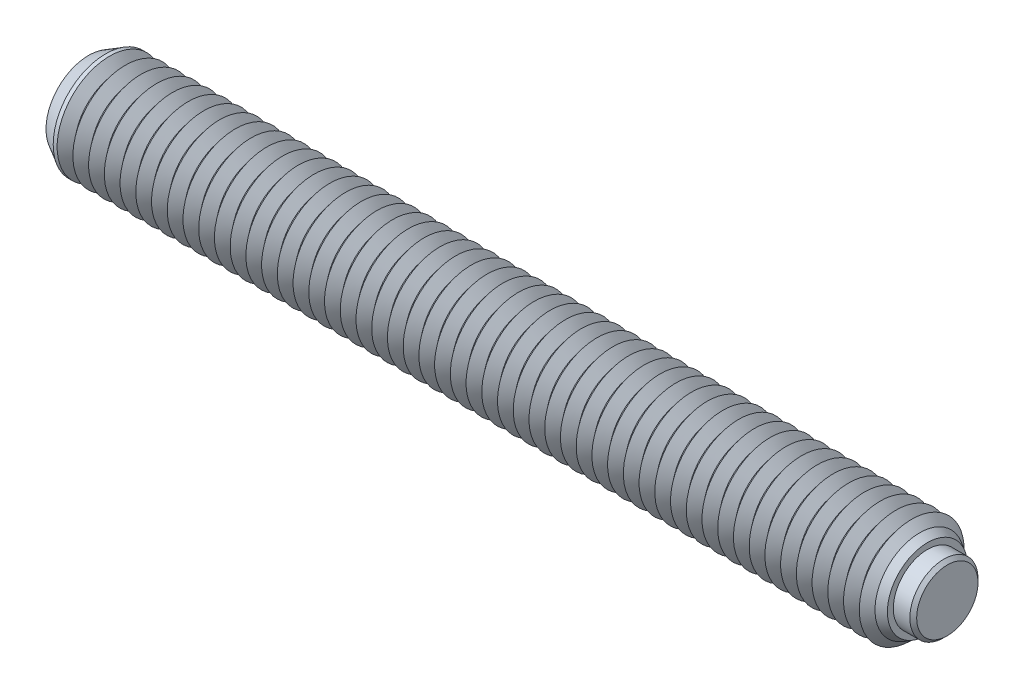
ISO-10303-21;
HEADER;
FILE_DESCRIPTION(('STEP AP214'),'2;1');
FILE_NAME('part.step','',(''),(''),'','','');
FILE_SCHEMA(('AUTOMOTIVE_DESIGN { 1 0 10303 214 1 1 1 1 }'));
ENDSEC;
DATA;
#1=APPLICATION_CONTEXT('core data for automotive mechanical design processes');
#2=APPLICATION_PROTOCOL_DEFINITION('international standard','automotive_design',2000,#1);
#3=PRODUCT_CONTEXT('',#1,'mechanical');
#4=PRODUCT('Part','Part','',(#3));
#5=PRODUCT_RELATED_PRODUCT_CATEGORY('part','',(#4));
#6=PRODUCT_DEFINITION_FORMATION('','',#4);
#7=PRODUCT_DEFINITION_CONTEXT('part definition',#1,'design');
#8=PRODUCT_DEFINITION('design','',#6,#7);
#9=PRODUCT_DEFINITION_SHAPE('','',#8);
#10=(LENGTH_UNIT() NAMED_UNIT(*) SI_UNIT(.MILLI.,.METRE.));
#11=(NAMED_UNIT(*) PLANE_ANGLE_UNIT() SI_UNIT($,.RADIAN.));
#12=(NAMED_UNIT(*) SI_UNIT($,.STERADIAN.) SOLID_ANGLE_UNIT());
#13=UNCERTAINTY_MEASURE_WITH_UNIT(LENGTH_MEASURE(1.E-05),#10,'distance_accuracy_value','');
#14=(GEOMETRIC_REPRESENTATION_CONTEXT(3) GLOBAL_UNCERTAINTY_ASSIGNED_CONTEXT((#13)) GLOBAL_UNIT_ASSIGNED_CONTEXT((#10,
#11,#12)) REPRESENTATION_CONTEXT('',''));
#15=CARTESIAN_POINT('',(0.,0.,0.));
#16=DIRECTION('',(0.,0.,1.));
#17=DIRECTION('',(1.,0.,0.));
#18=AXIS2_PLACEMENT_3D('',#15,#16,#17);
#19=CARTESIAN_POINT('',(2.65,0.,0.));
#20=DIRECTION('',(-1.,0.,0.));
#21=DIRECTION('',(0.,0.,1.));
#22=AXIS2_PLACEMENT_3D('',#19,#20,#21);
#23=CYLINDRICAL_SURFACE('',#22,3.25);
#24=CARTESIAN_POINT('',(2.325,0.,0.));
#25=DIRECTION('',(1.,0.,0.));
#26=DIRECTION('',(0.,0.,-1.));
#27=AXIS2_PLACEMENT_3D('',#24,#25,#26);
#28=CIRCLE('',#27,3.25);
#29=CARTESIAN_POINT('',(2.325,0.,3.25));
#30=VERTEX_POINT('',#29);
#31=EDGE_CURVE('P0_E10',#30,#30,#28,.F.);
#32=CARTESIAN_POINT('',(-1.15,0.,0.));
#33=DIRECTION('',(1.,0.,0.));
#34=DIRECTION('',(0.,0.,-1.));
#35=AXIS2_PLACEMENT_3D('',#32,#33,#34);
#36=CIRCLE('',#35,3.25);
#37=CARTESIAN_POINT('',(-1.15,0.,3.25));
#38=VERTEX_POINT('',#37);
#39=EDGE_CURVE('P0_E25',#38,#38,#36,.T.);
#40=CARTESIAN_POINT('',(2.325,0.,3.25));
#41=CARTESIAN_POINT('',(2.28880208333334,0.,3.25));
#42=CARTESIAN_POINT('',(2.25260416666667,0.,3.25));
#43=CARTESIAN_POINT('',(2.18020833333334,0.,3.25));
#44=CARTESIAN_POINT('',(2.14401041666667,0.,3.25));
#45=CARTESIAN_POINT('',(2.07161458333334,0.,3.25));
#46=CARTESIAN_POINT('',(2.03541666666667,0.,3.25));
#47=CARTESIAN_POINT('',(1.96302083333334,0.,3.25));
#48=CARTESIAN_POINT('',(1.92682291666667,0.,3.25));
#49=CARTESIAN_POINT('',(1.85442708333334,0.,3.25));
#50=CARTESIAN_POINT('',(1.81822916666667,0.,3.25));
#51=CARTESIAN_POINT('',(1.74583333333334,0.,3.25));
#52=CARTESIAN_POINT('',(1.70963541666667,0.,3.25));
#53=CARTESIAN_POINT('',(1.63723958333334,0.,3.25));
#54=CARTESIAN_POINT('',(1.60104166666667,0.,3.25));
#55=CARTESIAN_POINT('',(1.52864583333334,0.,3.25));
#56=CARTESIAN_POINT('',(1.49244791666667,0.,3.25));
#57=CARTESIAN_POINT('',(1.42005208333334,0.,3.25));
#58=CARTESIAN_POINT('',(1.38385416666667,0.,3.25));
#59=CARTESIAN_POINT('',(1.31145833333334,0.,3.25));
#60=CARTESIAN_POINT('',(1.27526041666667,0.,3.25));
#61=CARTESIAN_POINT('',(1.20286458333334,0.,3.25));
#62=CARTESIAN_POINT('',(1.16666666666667,0.,3.25));
#63=CARTESIAN_POINT('',(1.09427083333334,0.,3.25));
#64=CARTESIAN_POINT('',(1.05807291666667,0.,3.25));
#65=CARTESIAN_POINT('',(0.985677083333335,0.,3.25));
#66=CARTESIAN_POINT('',(0.949479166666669,0.,3.25));
#67=CARTESIAN_POINT('',(0.877083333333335,0.,3.25));
#68=CARTESIAN_POINT('',(0.840885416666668,0.,3.25));
#69=CARTESIAN_POINT('',(0.768489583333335,0.,3.25));
#70=CARTESIAN_POINT('',(0.732291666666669,0.,3.25));
#71=CARTESIAN_POINT('',(0.659895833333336,0.,3.25));
#72=CARTESIAN_POINT('',(0.623697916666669,0.,3.25));
#73=CARTESIAN_POINT('',(0.551302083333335,0.,3.25));
#74=CARTESIAN_POINT('',(0.515104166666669,0.,3.25));
#75=CARTESIAN_POINT('',(0.442708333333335,0.,3.25));
#76=CARTESIAN_POINT('',(0.406510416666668,0.,3.25));
#77=CARTESIAN_POINT('',(0.334114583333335,0.,3.25));
#78=CARTESIAN_POINT('',(0.297916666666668,0.,3.25));
#79=CARTESIAN_POINT('',(0.225520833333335,0.,3.25));
#80=CARTESIAN_POINT('',(0.189322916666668,0.,3.25));
#81=CARTESIAN_POINT('',(0.116927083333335,0.,3.25));
#82=CARTESIAN_POINT('',(0.0807291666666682,0.,3.25));
#83=CARTESIAN_POINT('',(0.00833333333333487,0.,3.25));
#84=CARTESIAN_POINT('',(-0.0278645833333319,0.,3.25));
#85=CARTESIAN_POINT('',(-0.100260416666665,0.,3.25));
#86=CARTESIAN_POINT('',(-0.136458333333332,0.,3.25));
#87=CARTESIAN_POINT('',(-0.208854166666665,0.,3.25));
#88=CARTESIAN_POINT('',(-0.245052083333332,0.,3.25));
#89=CARTESIAN_POINT('',(-0.317447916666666,0.,3.25));
#90=CARTESIAN_POINT('',(-0.353645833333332,0.,3.25));
#91=CARTESIAN_POINT('',(-0.426041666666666,0.,3.25));
#92=CARTESIAN_POINT('',(-0.462239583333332,0.,3.25));
#93=CARTESIAN_POINT('',(-0.534635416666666,0.,3.25));
#94=CARTESIAN_POINT('',(-0.570833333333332,0.,3.25));
#95=CARTESIAN_POINT('',(-0.643229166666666,0.,3.25));
#96=CARTESIAN_POINT('',(-0.679427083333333,0.,3.25));
#97=CARTESIAN_POINT('',(-0.751822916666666,0.,3.25));
#98=CARTESIAN_POINT('',(-0.788020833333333,0.,3.25));
#99=CARTESIAN_POINT('',(-0.860416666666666,0.,3.25));
#100=CARTESIAN_POINT('',(-0.896614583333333,0.,3.25));
#101=CARTESIAN_POINT('',(-0.969010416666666,0.,3.25));
#102=CARTESIAN_POINT('',(-1.00520833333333,0.,3.25));
#103=CARTESIAN_POINT('',(-1.07760416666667,0.,3.25));
#104=CARTESIAN_POINT('',(-1.11380208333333,0.,3.25));
#105=CARTESIAN_POINT('',(-1.15,0.,3.25));
#106=B_SPLINE_CURVE_WITH_KNOTS('',3,(#40,#41,#42,#43,#44,#45,#46,#47,#48,#49,#50,#51,#52,#53,
#54,#55,#56,#57,#58,#59,#60,#61,#62,#63,#64,#65,#66,#67,#68,#69,#70,#71,#72,#73,#74,#75,#76,#77,
#78,#79,#80,#81,#82,#83,#84,#85,#86,#87,#88,#89,#90,#91,#92,#93,#94,#95,#96,#97,#98,#99,#100,
#101,#102,#103,#104,#105),.UNSPECIFIED.,.F.,.F.,(4,2,2,2,2,2,2,2,2,2,2,2,2,2,2,2,2,2,2,2,2,2,2,
2,2,2,2,2,2,2,2,2,4),(0.,0.10859375,0.2171875,0.32578125,0.434375,0.54296875,0.6515625,
0.76015625,0.86875,0.977343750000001,1.0859375,1.19453125,1.303125,1.41171875,1.5203125,
1.62890625,1.7375,1.84609375,1.9546875,2.06328125,2.171875,2.28046875,2.3890625,2.49765625,
2.60625,2.71484375,2.8234375,2.93203125,3.040625,3.14921875,3.2578125,3.36640625,3.475),.UNSPECIFIED.);
#107=EDGE_CURVE('P0_BSEAM14',#30,#38,#106,.T.);
#108=ORIENTED_EDGE('',*,*,#31,.T.);
#109=ORIENTED_EDGE('',*,*,#39,.T.);
#110=ORIENTED_EDGE('',*,*,#107,.T.);
#111=ORIENTED_EDGE('',*,*,#107,.F.);
#112=EDGE_LOOP('',(#108,#110,#109,#111));
#113=FACE_BOUND('',#112,.T.);
#114=ADVANCED_FACE('P0_F14',(#113),#23,.T.);
#115=CARTESIAN_POINT('',(2.65,0.,0.));
#116=DIRECTION('',(1.,0.,0.));
#117=DIRECTION('',(0.,0.,-1.));
#118=AXIS2_PLACEMENT_3D('',#115,#116,#117);
#119=PLANE('',#118);
#120=CARTESIAN_POINT('',(2.65,0.,0.));
#121=DIRECTION('',(1.,0.,0.));
#122=DIRECTION('',(0.,0.,-1.));
#123=AXIS2_PLACEMENT_3D('',#120,#121,#122);
#124=CIRCLE('',#123,2.92500000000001);
#125=CARTESIAN_POINT('',(2.65,0.,-2.92500000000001));
#126=VERTEX_POINT('',#125);
#127=EDGE_CURVE('P0_E21',#126,#126,#124,.T.);
#128=ORIENTED_EDGE('',*,*,#127,.T.);
#129=EDGE_LOOP('',(#128));
#130=FACE_BOUND('',#129,.T.);
#131=ADVANCED_FACE('P0_F35',(#130),#119,.T.);
#132=CARTESIAN_POINT('',(-1.15,0.,0.));
#133=DIRECTION('',(1.,0.,0.));
#134=DIRECTION('',(0.,0.,-1.));
#135=AXIS2_PLACEMENT_3D('',#132,#133,#134);
#136=PLANE('',#135);
#137=ORIENTED_EDGE('',*,*,#39,.F.);
#138=EDGE_LOOP('',(#137));
#139=FACE_BOUND('',#138,.T.);
#140=ADVANCED_FACE('P0_F33',(#139),#136,.F.);
#141=CARTESIAN_POINT('',(2.65,0.,0.));
#142=DIRECTION('',(-1.,0.,0.));
#143=DIRECTION('',(0.,0.,1.));
#144=AXIS2_PLACEMENT_3D('',#141,#142,#143);
#145=CONICAL_SURFACE('',#144,2.92500000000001,0.785398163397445);
#146=ORIENTED_EDGE('',*,*,#31,.F.);
#147=EDGE_LOOP('',(#146));
#148=FACE_BOUND('',#147,.T.);
#149=ORIENTED_EDGE('',*,*,#127,.F.);
#150=EDGE_LOOP('',(#149));
#151=FACE_BOUND('',#150,.T.);
#152=ADVANCED_FACE('P0_F16',(#148,#151),#145,.T.);
#153=CLOSED_SHELL('',(#114,#131,#140,#152));
#154=MANIFOLD_SOLID_BREP('P0_B1',#153);
#155=CARTESIAN_POINT('',(-79.25,0.,0.));
#156=DIRECTION('',(1.,0.,0.));
#157=DIRECTION('',(0.,0.,-1.));
#158=AXIS2_PLACEMENT_3D('',#155,#156,#157);
#159=CYLINDRICAL_SURFACE('',#158,5.);
#160=CARTESIAN_POINT('',(-77.25,0.,0.));
#161=DIRECTION('',(1.,0.,0.));
#162=DIRECTION('',(0.,0.,-1.));
#163=AXIS2_PLACEMENT_3D('',#160,#161,#162);
#164=CIRCLE('',#163,5.);
#165=CARTESIAN_POINT('',(-77.25,0.,-5.));
#166=VERTEX_POINT('',#165);
#167=EDGE_CURVE('P1_E226',#166,#166,#164,.T.);
#168=ORIENTED_EDGE('',*,*,#167,.F.);
#169=EDGE_LOOP('',(#168));
#170=FACE_BOUND('',#169,.T.);
#171=CARTESIAN_POINT('',(-77.6275019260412,0.,0.));
#172=DIRECTION('',(1.,0.,0.));
#173=DIRECTION('',(0.,0.,-1.));
#174=AXIS2_PLACEMENT_3D('',#171,#172,#173);
#175=CIRCLE('',#174,5.);
#176=CARTESIAN_POINT('',(-77.6275019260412,0.,-5.));
#177=VERTEX_POINT('',#176);
#178=EDGE_CURVE('P1_E229',#177,#177,#175,.T.);
#179=ORIENTED_EDGE('',*,*,#178,.T.);
#180=EDGE_LOOP('',(#179));
#181=FACE_BOUND('',#180,.T.);
#182=ADVANCED_FACE('P1_F15',(#170,#181),#159,.T.);
#183=CARTESIAN_POINT('',(-1.5,0.,0.));
#184=DIRECTION('',(1.,0.,0.));
#185=DIRECTION('',(0.,0.,-1.));
#186=AXIS2_PLACEMENT_3D('',#183,#184,#185);
#187=CONICAL_SURFACE('',#186,4.06325030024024,0.895664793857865);
#188=CARTESIAN_POINT('',(-0.750000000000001,0.,0.));
#189=DIRECTION('',(1.,0.,0.));
#190=DIRECTION('',(0.,0.,-1.));
#191=AXIS2_PLACEMENT_3D('',#188,#189,#190);
#192=CIRCLE('',#191,5.);
#193=CARTESIAN_POINT('',(-0.750000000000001,0.,-5.));
#194=VERTEX_POINT('',#193);
#195=EDGE_CURVE('P1_E284',#194,#194,#192,.T.);
#196=ORIENTED_EDGE('',*,*,#195,.F.);
#197=EDGE_LOOP('',(#196));
#198=FACE_BOUND('',#197,.T.);
#199=CARTESIAN_POINT('',(-1.5,0.,0.));
#200=DIRECTION('',(1.,0.,0.));
#201=DIRECTION('',(0.,0.,-1.));
#202=AXIS2_PLACEMENT_3D('',#199,#200,#201);
#203=CIRCLE('',#202,4.06325030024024);
#204=CARTESIAN_POINT('',(-1.5,0.,-4.06325030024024));
#205=VERTEX_POINT('',#204);
#206=EDGE_CURVE('P1_E289',#205,#205,#203,.T.);
#207=ORIENTED_EDGE('',*,*,#206,.T.);
#208=EDGE_LOOP('',(#207));
#209=FACE_BOUND('',#208,.T.);
#210=ADVANCED_FACE('P1_F214',(#198,#209),#187,.T.);
#211=CARTESIAN_POINT('',(-2.25,0.,0.));
#212=DIRECTION('',(-1.,0.,0.));
#213=DIRECTION('',(0.,0.,1.));
#214=AXIS2_PLACEMENT_3D('',#211,#212,#213);
#215=CONICAL_SURFACE('',#214,5.,0.895664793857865);
#216=ORIENTED_EDGE('',*,*,#206,.F.);
#217=EDGE_LOOP('',(#216));
#218=FACE_BOUND('',#217,.T.);
#219=CARTESIAN_POINT('',(-2.25,0.,0.));
#220=DIRECTION('',(1.,0.,0.));
#221=DIRECTION('',(0.,0.,-1.));
#222=AXIS2_PLACEMENT_3D('',#219,#220,#221);
#223=CIRCLE('',#222,5.);
#224=CARTESIAN_POINT('',(-2.25,0.,-5.));
#225=VERTEX_POINT('',#224);
#226=EDGE_CURVE('P1_E292',#225,#225,#223,.T.);
#227=ORIENTED_EDGE('',*,*,#226,.T.);
#228=EDGE_LOOP('',(#227));
#229=FACE_BOUND('',#228,.T.);
#230=ADVANCED_FACE('P1_F220',(#218,#229),#215,.T.);
#231=CARTESIAN_POINT('',(-1.15,0.,0.));
#232=DIRECTION('',(1.,0.,0.));
#233=DIRECTION('',(0.,1.,0.));
#234=AXIS2_PLACEMENT_3D('',#231,#232,#233);
#235=PLANE('',#234);
#236=CARTESIAN_POINT('',(-1.15,0.,0.));
#237=DIRECTION('',(1.,0.,0.));
#238=DIRECTION('',(0.,1.,0.));
#239=AXIS2_PLACEMENT_3D('',#236,#237,#238);
#240=CIRCLE('',#239,3.25);
#241=CARTESIAN_POINT('',(-1.15,3.25,0.));
#242=VERTEX_POINT('',#241);
#243=EDGE_CURVE('P1_E279',#242,#242,#240,.T.);
#244=ORIENTED_EDGE('',*,*,#243,.T.);
#245=EDGE_LOOP('',(#244));
#246=FACE_BOUND('',#245,.T.);
#247=ADVANCED_FACE('P1_F997',(#246),#235,.T.);
#248=CARTESIAN_POINT('',(-1.15,0.,0.));
#249=DIRECTION('',(1.,0.,0.));
#250=DIRECTION('',(0.,1.,0.));
#251=AXIS2_PLACEMENT_3D('',#248,#249,#250);
#252=CYLINDRICAL_SURFACE('',#251,3.25);
#253=CARTESIAN_POINT('',(0.75,0.,0.));
#254=DIRECTION('',(1.,0.,0.));
#255=DIRECTION('',(0.,1.,0.));
#256=AXIS2_PLACEMENT_3D('',#253,#254,#255);
#257=CIRCLE('',#256,3.25);
#258=CARTESIAN_POINT('',(0.75,3.25,0.));
#259=VERTEX_POINT('',#258);
#260=EDGE_CURVE('P1_E281',#259,#259,#257,.T.);
#261=CARTESIAN_POINT('',(-1.15,3.25,0.));
#262=CARTESIAN_POINT('',(-1.13020833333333,3.25,0.));
#263=CARTESIAN_POINT('',(-1.11041666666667,3.25,0.));
#264=CARTESIAN_POINT('',(-1.07083333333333,3.25,0.));
#265=CARTESIAN_POINT('',(-1.05104166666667,3.25,0.));
#266=CARTESIAN_POINT('',(-1.01145833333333,3.25,0.));
#267=CARTESIAN_POINT('',(-0.991666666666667,3.25,0.));
#268=CARTESIAN_POINT('',(-0.952083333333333,3.25,0.));
#269=CARTESIAN_POINT('',(-0.932291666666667,3.25,0.));
#270=CARTESIAN_POINT('',(-0.892708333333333,3.25,0.));
#271=CARTESIAN_POINT('',(-0.872916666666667,3.25,0.));
#272=CARTESIAN_POINT('',(-0.833333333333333,3.25,0.));
#273=CARTESIAN_POINT('',(-0.813541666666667,3.25,0.));
#274=CARTESIAN_POINT('',(-0.773958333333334,3.25,0.));
#275=CARTESIAN_POINT('',(-0.754166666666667,3.25,0.));
#276=CARTESIAN_POINT('',(-0.714583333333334,3.25,0.));
#277=CARTESIAN_POINT('',(-0.694791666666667,3.25,0.));
#278=CARTESIAN_POINT('',(-0.655208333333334,3.25,0.));
#279=CARTESIAN_POINT('',(-0.635416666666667,3.25,0.));
#280=CARTESIAN_POINT('',(-0.595833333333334,3.25,0.));
#281=CARTESIAN_POINT('',(-0.576041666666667,3.25,0.));
#282=CARTESIAN_POINT('',(-0.536458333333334,3.25,0.));
#283=CARTESIAN_POINT('',(-0.516666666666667,3.25,0.));
#284=CARTESIAN_POINT('',(-0.477083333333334,3.25,0.));
#285=CARTESIAN_POINT('',(-0.457291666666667,3.25,0.));
#286=CARTESIAN_POINT('',(-0.417708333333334,3.25,0.));
#287=CARTESIAN_POINT('',(-0.397916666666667,3.25,0.));
#288=CARTESIAN_POINT('',(-0.358333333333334,3.25,0.));
#289=CARTESIAN_POINT('',(-0.338541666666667,3.25,0.));
#290=CARTESIAN_POINT('',(-0.298958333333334,3.25,0.));
#291=CARTESIAN_POINT('',(-0.279166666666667,3.25,0.));
#292=CARTESIAN_POINT('',(-0.239583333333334,3.25,0.));
#293=CARTESIAN_POINT('',(-0.219791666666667,3.25,0.));
#294=CARTESIAN_POINT('',(-0.180208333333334,3.25,0.));
#295=CARTESIAN_POINT('',(-0.160416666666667,3.25,0.));
#296=CARTESIAN_POINT('',(-0.120833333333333,3.25,0.));
#297=CARTESIAN_POINT('',(-0.101041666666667,3.25,0.));
#298=CARTESIAN_POINT('',(-0.0614583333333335,3.25,0.));
#299=CARTESIAN_POINT('',(-0.0416666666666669,3.25,0.));
#300=CARTESIAN_POINT('',(-0.00208333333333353,3.25,0.));
#301=CARTESIAN_POINT('',(0.0177083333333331,3.25,0.));
#302=CARTESIAN_POINT('',(0.0572916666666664,3.25,0.));
#303=CARTESIAN_POINT('',(0.0770833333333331,3.25,0.));
#304=CARTESIAN_POINT('',(0.116666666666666,3.25,0.));
#305=CARTESIAN_POINT('',(0.136458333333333,3.25,0.));
#306=CARTESIAN_POINT('',(0.176041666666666,3.25,0.));
#307=CARTESIAN_POINT('',(0.195833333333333,3.25,0.));
#308=CARTESIAN_POINT('',(0.235416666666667,3.25,0.));
#309=CARTESIAN_POINT('',(0.255208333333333,3.25,0.));
#310=CARTESIAN_POINT('',(0.294791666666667,3.25,0.));
#311=CARTESIAN_POINT('',(0.314583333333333,3.25,0.));
#312=CARTESIAN_POINT('',(0.354166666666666,3.25,0.));
#313=CARTESIAN_POINT('',(0.373958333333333,3.25,0.));
#314=CARTESIAN_POINT('',(0.413541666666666,3.25,0.));
#315=CARTESIAN_POINT('',(0.433333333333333,3.25,0.));
#316=CARTESIAN_POINT('',(0.472916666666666,3.25,0.));
#317=CARTESIAN_POINT('',(0.492708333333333,3.25,0.));
#318=CARTESIAN_POINT('',(0.532291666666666,3.25,0.));
#319=CARTESIAN_POINT('',(0.552083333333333,3.25,0.));
#320=CARTESIAN_POINT('',(0.591666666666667,3.25,0.));
#321=CARTESIAN_POINT('',(0.611458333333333,3.25,0.));
#322=CARTESIAN_POINT('',(0.651041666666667,3.25,0.));
#323=CARTESIAN_POINT('',(0.670833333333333,3.25,0.));
#324=CARTESIAN_POINT('',(0.710416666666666,3.25,0.));
#325=CARTESIAN_POINT('',(0.730208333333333,3.25,0.));
#326=CARTESIAN_POINT('',(0.75,3.25,0.));
#327=B_SPLINE_CURVE_WITH_KNOTS('',3,(#261,#262,#263,#264,#265,#266,#267,#268,#269,#270,#271,
#272,#273,#274,#275,#276,#277,#278,#279,#280,#281,#282,#283,#284,#285,#286,#287,#288,#289,#290,
#291,#292,#293,#294,#295,#296,#297,#298,#299,#300,#301,#302,#303,#304,#305,#306,#307,#308,#309,
#310,#311,#312,#313,#314,#315,#316,#317,#318,#319,#320,#321,#322,#323,#324,#325,#326),
.UNSPECIFIED.,.F.,.F.,(4,2,2,2,2,2,2,2,2,2,2,2,2,2,2,2,2,2,2,2,2,2,2,2,2,2,2,2,2,2,2,2,4),(0.,
0.059375,0.11875,0.178125,0.2375,0.296875,0.35625,0.415625,0.475,0.534375,0.59375,0.653125,
0.7125,0.771875,0.83125,0.890625,0.95,1.009375,1.06875,1.128125,1.1875,1.246875,1.30625,
1.365625,1.425,1.484375,1.54375,1.603125,1.6625,1.721875,1.78125,1.840625,1.9),.UNSPECIFIED.);
#328=EDGE_CURVE('P1_BSEAM210',#242,#259,#327,.T.);
#329=ORIENTED_EDGE('',*,*,#243,.F.);
#330=ORIENTED_EDGE('',*,*,#260,.T.);
#331=ORIENTED_EDGE('',*,*,#328,.T.);
#332=ORIENTED_EDGE('',*,*,#328,.F.);
#333=EDGE_LOOP('',(#329,#331,#330,#332));
#334=FACE_BOUND('',#333,.T.);
#335=ADVANCED_FACE('P1_F210',(#334),#252,.F.);
#336=CARTESIAN_POINT('',(0.75,3.8169872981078,0.));
#337=DIRECTION('',(1.,0.,0.));
#338=DIRECTION('',(0.,1.,0.));
#339=AXIS2_PLACEMENT_3D('',#336,#337,#338);
#340=PLANE('',#339);
#341=ORIENTED_EDGE('',*,*,#260,.F.);
#342=EDGE_LOOP('',(#341));
#343=FACE_BOUND('',#342,.T.);
#344=CARTESIAN_POINT('',(0.75,0.,0.));
#345=DIRECTION('',(1.,0.,0.));
#346=DIRECTION('',(0.,1.,0.));
#347=AXIS2_PLACEMENT_3D('',#344,#345,#346);
#348=CIRCLE('',#347,3.8169872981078);
#349=CARTESIAN_POINT('',(0.75,3.8169872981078,0.));
#350=VERTEX_POINT('',#349);
#351=EDGE_CURVE('P1_E121',#350,#350,#348,.T.);
#352=ORIENTED_EDGE('',*,*,#351,.T.);
#353=EDGE_LOOP('',(#352));
#354=FACE_BOUND('',#353,.T.);
#355=ADVANCED_FACE('P1_F206',(#343,#354),#340,.T.);
#356=CARTESIAN_POINT('',(0.75,0.,0.));
#357=DIRECTION('',(-1.,0.,0.));
#358=DIRECTION('',(0.,-1.,0.));
#359=AXIS2_PLACEMENT_3D('',#356,#357,#358);
#360=CONICAL_SURFACE('',#359,3.8169872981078,0.523598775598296);
#361=CARTESIAN_POINT('',(0.,0.,0.));
#362=DIRECTION('',(1.,0.,0.));
#363=DIRECTION('',(0.,0.,-1.));
#364=AXIS2_PLACEMENT_3D('',#361,#362,#363);
#365=CIRCLE('',#364,4.25000000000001);
#366=CARTESIAN_POINT('',(0.,0.,-4.25000000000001));
#367=VERTEX_POINT('',#366);
#368=EDGE_CURVE('P1_E236',#367,#367,#365,.T.);
#369=ORIENTED_EDGE('',*,*,#368,.T.);
#370=EDGE_LOOP('',(#369));
#371=FACE_BOUND('',#370,.T.);
#372=ORIENTED_EDGE('',*,*,#351,.F.);
#373=EDGE_LOOP('',(#372));
#374=FACE_BOUND('',#373,.T.);
#375=ADVANCED_FACE('P1_F203',(#371,#374),#360,.T.);
#376=CARTESIAN_POINT('',(0.,0.,0.));
#377=DIRECTION('',(-1.,0.,0.));
#378=DIRECTION('',(0.,0.,1.));
#379=AXIS2_PLACEMENT_3D('',#376,#377,#378);
#380=CONICAL_SURFACE('',#379,4.25000000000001,0.785398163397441);
#381=ORIENTED_EDGE('',*,*,#195,.T.);
#382=EDGE_LOOP('',(#381));
#383=FACE_BOUND('',#382,.T.);
#384=ORIENTED_EDGE('',*,*,#368,.F.);
#385=EDGE_LOOP('',(#384));
#386=FACE_BOUND('',#385,.T.);
#387=ADVANCED_FACE('P1_F17',(#383,#386),#380,.T.);
#388=CARTESIAN_POINT('',(-3.,0.,0.));
#389=DIRECTION('',(1.,0.,0.));
#390=DIRECTION('',(0.,0.,-1.));
#391=AXIS2_PLACEMENT_3D('',#388,#389,#390);
#392=CONICAL_SURFACE('',#391,4.06325030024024,0.895664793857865);
#393=ORIENTED_EDGE('',*,*,#226,.F.);
#394=EDGE_LOOP('',(#393));
#395=FACE_BOUND('',#394,.T.);
#396=CARTESIAN_POINT('',(-3.,0.,0.));
#397=DIRECTION('',(1.,0.,0.));
#398=DIRECTION('',(0.,0.,-1.));
#399=AXIS2_PLACEMENT_3D('',#396,#397,#398);
#400=CIRCLE('',#399,4.06325030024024);
#401=CARTESIAN_POINT('',(-3.,0.,-4.06325030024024));
#402=VERTEX_POINT('',#401);
#403=EDGE_CURVE('P1_E295',#402,#402,#400,.T.);
#404=ORIENTED_EDGE('',*,*,#403,.T.);
#405=EDGE_LOOP('',(#404));
#406=FACE_BOUND('',#405,.T.);
#407=ADVANCED_FACE('P1_F991',(#395,#406),#392,.T.);
#408=CARTESIAN_POINT('',(-3.75,0.,0.));
#409=DIRECTION('',(-1.,0.,0.));
#410=DIRECTION('',(0.,0.,1.));
#411=AXIS2_PLACEMENT_3D('',#408,#409,#410);
#412=CONICAL_SURFACE('',#411,5.,0.895664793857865);
#413=ORIENTED_EDGE('',*,*,#403,.F.);
#414=EDGE_LOOP('',(#413));
#415=FACE_BOUND('',#414,.T.);
#416=CARTESIAN_POINT('',(-3.75,0.,0.));
#417=DIRECTION('',(1.,0.,0.));
#418=DIRECTION('',(0.,0.,-1.));
#419=AXIS2_PLACEMENT_3D('',#416,#417,#418);
#420=CIRCLE('',#419,5.);
#421=CARTESIAN_POINT('',(-3.75,0.,-5.));
#422=VERTEX_POINT('',#421);
#423=EDGE_CURVE('P1_E298',#422,#422,#420,.T.);
#424=ORIENTED_EDGE('',*,*,#423,.T.);
#425=EDGE_LOOP('',(#424));
#426=FACE_BOUND('',#425,.T.);
#427=ADVANCED_FACE('P1_F987',(#415,#426),#412,.T.);
#428=CARTESIAN_POINT('',(-4.5,0.,0.));
#429=DIRECTION('',(1.,0.,0.));
#430=DIRECTION('',(0.,0.,-1.));
#431=AXIS2_PLACEMENT_3D('',#428,#429,#430);
#432=CONICAL_SURFACE('',#431,4.06325030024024,0.895664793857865);
#433=ORIENTED_EDGE('',*,*,#423,.F.);
#434=EDGE_LOOP('',(#433));
#435=FACE_BOUND('',#434,.T.);
#436=CARTESIAN_POINT('',(-4.5,0.,0.));
#437=DIRECTION('',(1.,0.,0.));
#438=DIRECTION('',(0.,0.,-1.));
#439=AXIS2_PLACEMENT_3D('',#436,#437,#438);
#440=CIRCLE('',#439,4.06325030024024);
#441=CARTESIAN_POINT('',(-4.5,0.,-4.06325030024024));
#442=VERTEX_POINT('',#441);
#443=EDGE_CURVE('P1_E301',#442,#442,#440,.T.);
#444=ORIENTED_EDGE('',*,*,#443,.T.);
#445=EDGE_LOOP('',(#444));
#446=FACE_BOUND('',#445,.T.);
#447=ADVANCED_FACE('P1_F983',(#435,#446),#432,.T.);
#448=CARTESIAN_POINT('',(-5.25,0.,0.));
#449=DIRECTION('',(-1.,0.,0.));
#450=DIRECTION('',(0.,0.,1.));
#451=AXIS2_PLACEMENT_3D('',#448,#449,#450);
#452=CONICAL_SURFACE('',#451,5.,0.895664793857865);
#453=ORIENTED_EDGE('',*,*,#443,.F.);
#454=EDGE_LOOP('',(#453));
#455=FACE_BOUND('',#454,.T.);
#456=CARTESIAN_POINT('',(-5.25,0.,0.));
#457=DIRECTION('',(1.,0.,0.));
#458=DIRECTION('',(0.,0.,-1.));
#459=AXIS2_PLACEMENT_3D('',#456,#457,#458);
#460=CIRCLE('',#459,5.);
#461=CARTESIAN_POINT('',(-5.25,0.,-5.));
#462=VERTEX_POINT('',#461);
#463=EDGE_CURVE('P1_E304',#462,#462,#460,.T.);
#464=ORIENTED_EDGE('',*,*,#463,.T.);
#465=EDGE_LOOP('',(#464));
#466=FACE_BOUND('',#465,.T.);
#467=ADVANCED_FACE('P1_F979',(#455,#466),#452,.T.);
#468=CARTESIAN_POINT('',(-6.,0.,0.));
#469=DIRECTION('',(1.,0.,0.));
#470=DIRECTION('',(0.,0.,-1.));
#471=AXIS2_PLACEMENT_3D('',#468,#469,#470);
#472=CONICAL_SURFACE('',#471,4.06325030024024,0.895664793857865);
#473=ORIENTED_EDGE('',*,*,#463,.F.);
#474=EDGE_LOOP('',(#473));
#475=FACE_BOUND('',#474,.T.);
#476=CARTESIAN_POINT('',(-6.,0.,0.));
#477=DIRECTION('',(1.,0.,0.));
#478=DIRECTION('',(0.,0.,-1.));
#479=AXIS2_PLACEMENT_3D('',#476,#477,#478);
#480=CIRCLE('',#479,4.06325030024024);
#481=CARTESIAN_POINT('',(-6.,0.,-4.06325030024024));
#482=VERTEX_POINT('',#481);
#483=EDGE_CURVE('P1_E307',#482,#482,#480,.T.);
#484=ORIENTED_EDGE('',*,*,#483,.T.);
#485=EDGE_LOOP('',(#484));
#486=FACE_BOUND('',#485,.T.);
#487=ADVANCED_FACE('P1_F975',(#475,#486),#472,.T.);
#488=CARTESIAN_POINT('',(-6.75,0.,0.));
#489=DIRECTION('',(-1.,0.,0.));
#490=DIRECTION('',(0.,0.,1.));
#491=AXIS2_PLACEMENT_3D('',#488,#489,#490);
#492=CONICAL_SURFACE('',#491,5.,0.895664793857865);
#493=ORIENTED_EDGE('',*,*,#483,.F.);
#494=EDGE_LOOP('',(#493));
#495=FACE_BOUND('',#494,.T.);
#496=CARTESIAN_POINT('',(-6.75,0.,0.));
#497=DIRECTION('',(1.,0.,0.));
#498=DIRECTION('',(0.,0.,-1.));
#499=AXIS2_PLACEMENT_3D('',#496,#497,#498);
#500=CIRCLE('',#499,5.);
#501=CARTESIAN_POINT('',(-6.75,0.,-5.));
#502=VERTEX_POINT('',#501);
#503=EDGE_CURVE('P1_E310',#502,#502,#500,.T.);
#504=ORIENTED_EDGE('',*,*,#503,.T.);
#505=EDGE_LOOP('',(#504));
#506=FACE_BOUND('',#505,.T.);
#507=ADVANCED_FACE('P1_F971',(#495,#506),#492,.T.);
#508=CARTESIAN_POINT('',(-7.5,0.,0.));
#509=DIRECTION('',(1.,0.,0.));
#510=DIRECTION('',(0.,0.,-1.));
#511=AXIS2_PLACEMENT_3D('',#508,#509,#510);
#512=CONICAL_SURFACE('',#511,4.06325030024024,0.895664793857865);
#513=ORIENTED_EDGE('',*,*,#503,.F.);
#514=EDGE_LOOP('',(#513));
#515=FACE_BOUND('',#514,.T.);
#516=CARTESIAN_POINT('',(-7.5,0.,0.));
#517=DIRECTION('',(1.,0.,0.));
#518=DIRECTION('',(0.,0.,-1.));
#519=AXIS2_PLACEMENT_3D('',#516,#517,#518);
#520=CIRCLE('',#519,4.06325030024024);
#521=CARTESIAN_POINT('',(-7.5,0.,-4.06325030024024));
#522=VERTEX_POINT('',#521);
#523=EDGE_CURVE('P1_E313',#522,#522,#520,.T.);
#524=ORIENTED_EDGE('',*,*,#523,.T.);
#525=EDGE_LOOP('',(#524));
#526=FACE_BOUND('',#525,.T.);
#527=ADVANCED_FACE('P1_F967',(#515,#526),#512,.T.);
#528=CARTESIAN_POINT('',(-8.25,0.,0.));
#529=DIRECTION('',(-1.,0.,0.));
#530=DIRECTION('',(0.,0.,1.));
#531=AXIS2_PLACEMENT_3D('',#528,#529,#530);
#532=CONICAL_SURFACE('',#531,5.,0.895664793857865);
#533=ORIENTED_EDGE('',*,*,#523,.F.);
#534=EDGE_LOOP('',(#533));
#535=FACE_BOUND('',#534,.T.);
#536=CARTESIAN_POINT('',(-8.25,0.,0.));
#537=DIRECTION('',(1.,0.,0.));
#538=DIRECTION('',(0.,0.,-1.));
#539=AXIS2_PLACEMENT_3D('',#536,#537,#538);
#540=CIRCLE('',#539,5.);
#541=CARTESIAN_POINT('',(-8.25,0.,-5.));
#542=VERTEX_POINT('',#541);
#543=EDGE_CURVE('P1_E316',#542,#542,#540,.T.);
#544=ORIENTED_EDGE('',*,*,#543,.T.);
#545=EDGE_LOOP('',(#544));
#546=FACE_BOUND('',#545,.T.);
#547=ADVANCED_FACE('P1_F963',(#535,#546),#532,.T.);
#548=CARTESIAN_POINT('',(-9.,0.,0.));
#549=DIRECTION('',(1.,0.,0.));
#550=DIRECTION('',(0.,0.,-1.));
#551=AXIS2_PLACEMENT_3D('',#548,#549,#550);
#552=CONICAL_SURFACE('',#551,4.06325030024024,0.895664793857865);
#553=ORIENTED_EDGE('',*,*,#543,.F.);
#554=EDGE_LOOP('',(#553));
#555=FACE_BOUND('',#554,.T.);
#556=CARTESIAN_POINT('',(-9.,0.,0.));
#557=DIRECTION('',(1.,0.,0.));
#558=DIRECTION('',(0.,0.,-1.));
#559=AXIS2_PLACEMENT_3D('',#556,#557,#558);
#560=CIRCLE('',#559,4.06325030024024);
#561=CARTESIAN_POINT('',(-9.,0.,-4.06325030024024));
#562=VERTEX_POINT('',#561);
#563=EDGE_CURVE('P1_E319',#562,#562,#560,.T.);
#564=ORIENTED_EDGE('',*,*,#563,.T.);
#565=EDGE_LOOP('',(#564));
#566=FACE_BOUND('',#565,.T.);
#567=ADVANCED_FACE('P1_F959',(#555,#566),#552,.T.);
#568=CARTESIAN_POINT('',(-9.75,0.,0.));
#569=DIRECTION('',(-1.,0.,0.));
#570=DIRECTION('',(0.,0.,1.));
#571=AXIS2_PLACEMENT_3D('',#568,#569,#570);
#572=CONICAL_SURFACE('',#571,5.,0.895664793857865);
#573=ORIENTED_EDGE('',*,*,#563,.F.);
#574=EDGE_LOOP('',(#573));
#575=FACE_BOUND('',#574,.T.);
#576=CARTESIAN_POINT('',(-9.75,0.,0.));
#577=DIRECTION('',(1.,0.,0.));
#578=DIRECTION('',(0.,0.,-1.));
#579=AXIS2_PLACEMENT_3D('',#576,#577,#578);
#580=CIRCLE('',#579,5.);
#581=CARTESIAN_POINT('',(-9.75,0.,-5.));
#582=VERTEX_POINT('',#581);
#583=EDGE_CURVE('P1_E322',#582,#582,#580,.T.);
#584=ORIENTED_EDGE('',*,*,#583,.T.);
#585=EDGE_LOOP('',(#584));
#586=FACE_BOUND('',#585,.T.);
#587=ADVANCED_FACE('P1_F955',(#575,#586),#572,.T.);
#588=CARTESIAN_POINT('',(-10.5,0.,0.));
#589=DIRECTION('',(1.,0.,0.));
#590=DIRECTION('',(0.,0.,-1.));
#591=AXIS2_PLACEMENT_3D('',#588,#589,#590);
#592=CONICAL_SURFACE('',#591,4.06325030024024,0.895664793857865);
#593=ORIENTED_EDGE('',*,*,#583,.F.);
#594=EDGE_LOOP('',(#593));
#595=FACE_BOUND('',#594,.T.);
#596=CARTESIAN_POINT('',(-10.5,0.,0.));
#597=DIRECTION('',(1.,0.,0.));
#598=DIRECTION('',(0.,0.,-1.));
#599=AXIS2_PLACEMENT_3D('',#596,#597,#598);
#600=CIRCLE('',#599,4.06325030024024);
#601=CARTESIAN_POINT('',(-10.5,0.,-4.06325030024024));
#602=VERTEX_POINT('',#601);
#603=EDGE_CURVE('P1_E325',#602,#602,#600,.T.);
#604=ORIENTED_EDGE('',*,*,#603,.T.);
#605=EDGE_LOOP('',(#604));
#606=FACE_BOUND('',#605,.T.);
#607=ADVANCED_FACE('P1_F951',(#595,#606),#592,.T.);
#608=CARTESIAN_POINT('',(-11.25,0.,0.));
#609=DIRECTION('',(-1.,0.,0.));
#610=DIRECTION('',(0.,0.,1.));
#611=AXIS2_PLACEMENT_3D('',#608,#609,#610);
#612=CONICAL_SURFACE('',#611,5.,0.895664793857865);
#613=ORIENTED_EDGE('',*,*,#603,.F.);
#614=EDGE_LOOP('',(#613));
#615=FACE_BOUND('',#614,.T.);
#616=CARTESIAN_POINT('',(-11.25,0.,0.));
#617=DIRECTION('',(1.,0.,0.));
#618=DIRECTION('',(0.,0.,-1.));
#619=AXIS2_PLACEMENT_3D('',#616,#617,#618);
#620=CIRCLE('',#619,5.);
#621=CARTESIAN_POINT('',(-11.25,0.,-5.));
#622=VERTEX_POINT('',#621);
#623=EDGE_CURVE('P1_E328',#622,#622,#620,.T.);
#624=ORIENTED_EDGE('',*,*,#623,.T.);
#625=EDGE_LOOP('',(#624));
#626=FACE_BOUND('',#625,.T.);
#627=ADVANCED_FACE('P1_F947',(#615,#626),#612,.T.);
#628=CARTESIAN_POINT('',(-12.,0.,0.));
#629=DIRECTION('',(1.,0.,0.));
#630=DIRECTION('',(0.,0.,-1.));
#631=AXIS2_PLACEMENT_3D('',#628,#629,#630);
#632=CONICAL_SURFACE('',#631,4.06325030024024,0.895664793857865);
#633=ORIENTED_EDGE('',*,*,#623,.F.);
#634=EDGE_LOOP('',(#633));
#635=FACE_BOUND('',#634,.T.);
#636=CARTESIAN_POINT('',(-12.,0.,0.));
#637=DIRECTION('',(1.,0.,0.));
#638=DIRECTION('',(0.,0.,-1.));
#639=AXIS2_PLACEMENT_3D('',#636,#637,#638);
#640=CIRCLE('',#639,4.06325030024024);
#641=CARTESIAN_POINT('',(-12.,0.,-4.06325030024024));
#642=VERTEX_POINT('',#641);
#643=EDGE_CURVE('P1_E331',#642,#642,#640,.T.);
#644=ORIENTED_EDGE('',*,*,#643,.T.);
#645=EDGE_LOOP('',(#644));
#646=FACE_BOUND('',#645,.T.);
#647=ADVANCED_FACE('P1_F943',(#635,#646),#632,.T.);
#648=CARTESIAN_POINT('',(-12.75,0.,0.));
#649=DIRECTION('',(-1.,0.,0.));
#650=DIRECTION('',(0.,0.,1.));
#651=AXIS2_PLACEMENT_3D('',#648,#649,#650);
#652=CONICAL_SURFACE('',#651,5.,0.895664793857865);
#653=ORIENTED_EDGE('',*,*,#643,.F.);
#654=EDGE_LOOP('',(#653));
#655=FACE_BOUND('',#654,.T.);
#656=CARTESIAN_POINT('',(-12.75,0.,0.));
#657=DIRECTION('',(1.,0.,0.));
#658=DIRECTION('',(0.,0.,-1.));
#659=AXIS2_PLACEMENT_3D('',#656,#657,#658);
#660=CIRCLE('',#659,5.);
#661=CARTESIAN_POINT('',(-12.75,0.,-5.));
#662=VERTEX_POINT('',#661);
#663=EDGE_CURVE('P1_E334',#662,#662,#660,.T.);
#664=ORIENTED_EDGE('',*,*,#663,.T.);
#665=EDGE_LOOP('',(#664));
#666=FACE_BOUND('',#665,.T.);
#667=ADVANCED_FACE('P1_F939',(#655,#666),#652,.T.);
#668=CARTESIAN_POINT('',(-13.5,0.,0.));
#669=DIRECTION('',(1.,0.,0.));
#670=DIRECTION('',(0.,0.,-1.));
#671=AXIS2_PLACEMENT_3D('',#668,#669,#670);
#672=CONICAL_SURFACE('',#671,4.06325030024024,0.895664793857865);
#673=ORIENTED_EDGE('',*,*,#663,.F.);
#674=EDGE_LOOP('',(#673));
#675=FACE_BOUND('',#674,.T.);
#676=CARTESIAN_POINT('',(-13.5,0.,0.));
#677=DIRECTION('',(1.,0.,0.));
#678=DIRECTION('',(0.,0.,-1.));
#679=AXIS2_PLACEMENT_3D('',#676,#677,#678);
#680=CIRCLE('',#679,4.06325030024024);
#681=CARTESIAN_POINT('',(-13.5,0.,-4.06325030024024));
#682=VERTEX_POINT('',#681);
#683=EDGE_CURVE('P1_E337',#682,#682,#680,.T.);
#684=ORIENTED_EDGE('',*,*,#683,.T.);
#685=EDGE_LOOP('',(#684));
#686=FACE_BOUND('',#685,.T.);
#687=ADVANCED_FACE('P1_F935',(#675,#686),#672,.T.);
#688=CARTESIAN_POINT('',(-14.25,0.,0.));
#689=DIRECTION('',(-1.,0.,0.));
#690=DIRECTION('',(0.,0.,1.));
#691=AXIS2_PLACEMENT_3D('',#688,#689,#690);
#692=CONICAL_SURFACE('',#691,5.,0.895664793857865);
#693=ORIENTED_EDGE('',*,*,#683,.F.);
#694=EDGE_LOOP('',(#693));
#695=FACE_BOUND('',#694,.T.);
#696=CARTESIAN_POINT('',(-14.25,0.,0.));
#697=DIRECTION('',(1.,0.,0.));
#698=DIRECTION('',(0.,0.,-1.));
#699=AXIS2_PLACEMENT_3D('',#696,#697,#698);
#700=CIRCLE('',#699,5.);
#701=CARTESIAN_POINT('',(-14.25,0.,-5.));
#702=VERTEX_POINT('',#701);
#703=EDGE_CURVE('P1_E340',#702,#702,#700,.T.);
#704=ORIENTED_EDGE('',*,*,#703,.T.);
#705=EDGE_LOOP('',(#704));
#706=FACE_BOUND('',#705,.T.);
#707=ADVANCED_FACE('P1_F931',(#695,#706),#692,.T.);
#708=CARTESIAN_POINT('',(-15.,0.,0.));
#709=DIRECTION('',(1.,0.,0.));
#710=DIRECTION('',(0.,0.,-1.));
#711=AXIS2_PLACEMENT_3D('',#708,#709,#710);
#712=CONICAL_SURFACE('',#711,4.06325030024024,0.895664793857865);
#713=ORIENTED_EDGE('',*,*,#703,.F.);
#714=EDGE_LOOP('',(#713));
#715=FACE_BOUND('',#714,.T.);
#716=CARTESIAN_POINT('',(-15.,0.,0.));
#717=DIRECTION('',(1.,0.,0.));
#718=DIRECTION('',(0.,0.,-1.));
#719=AXIS2_PLACEMENT_3D('',#716,#717,#718);
#720=CIRCLE('',#719,4.06325030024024);
#721=CARTESIAN_POINT('',(-15.,0.,-4.06325030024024));
#722=VERTEX_POINT('',#721);
#723=EDGE_CURVE('P1_E343',#722,#722,#720,.T.);
#724=ORIENTED_EDGE('',*,*,#723,.T.);
#725=EDGE_LOOP('',(#724));
#726=FACE_BOUND('',#725,.T.);
#727=ADVANCED_FACE('P1_F927',(#715,#726),#712,.T.);
#728=CARTESIAN_POINT('',(-15.75,0.,0.));
#729=DIRECTION('',(-1.,0.,0.));
#730=DIRECTION('',(0.,0.,1.));
#731=AXIS2_PLACEMENT_3D('',#728,#729,#730);
#732=CONICAL_SURFACE('',#731,5.,0.895664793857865);
#733=ORIENTED_EDGE('',*,*,#723,.F.);
#734=EDGE_LOOP('',(#733));
#735=FACE_BOUND('',#734,.T.);
#736=CARTESIAN_POINT('',(-15.75,0.,0.));
#737=DIRECTION('',(1.,0.,0.));
#738=DIRECTION('',(0.,0.,-1.));
#739=AXIS2_PLACEMENT_3D('',#736,#737,#738);
#740=CIRCLE('',#739,5.);
#741=CARTESIAN_POINT('',(-15.75,0.,-5.));
#742=VERTEX_POINT('',#741);
#743=EDGE_CURVE('P1_E346',#742,#742,#740,.T.);
#744=ORIENTED_EDGE('',*,*,#743,.T.);
#745=EDGE_LOOP('',(#744));
#746=FACE_BOUND('',#745,.T.);
#747=ADVANCED_FACE('P1_F923',(#735,#746),#732,.T.);
#748=CARTESIAN_POINT('',(-16.5,0.,0.));
#749=DIRECTION('',(1.,0.,0.));
#750=DIRECTION('',(0.,0.,-1.));
#751=AXIS2_PLACEMENT_3D('',#748,#749,#750);
#752=CONICAL_SURFACE('',#751,4.06325030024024,0.895664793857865);
#753=ORIENTED_EDGE('',*,*,#743,.F.);
#754=EDGE_LOOP('',(#753));
#755=FACE_BOUND('',#754,.T.);
#756=CARTESIAN_POINT('',(-16.5,0.,0.));
#757=DIRECTION('',(1.,0.,0.));
#758=DIRECTION('',(0.,0.,-1.));
#759=AXIS2_PLACEMENT_3D('',#756,#757,#758);
#760=CIRCLE('',#759,4.06325030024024);
#761=CARTESIAN_POINT('',(-16.5,0.,-4.06325030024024));
#762=VERTEX_POINT('',#761);
#763=EDGE_CURVE('P1_E349',#762,#762,#760,.T.);
#764=ORIENTED_EDGE('',*,*,#763,.T.);
#765=EDGE_LOOP('',(#764));
#766=FACE_BOUND('',#765,.T.);
#767=ADVANCED_FACE('P1_F919',(#755,#766),#752,.T.);
#768=CARTESIAN_POINT('',(-17.25,0.,0.));
#769=DIRECTION('',(-1.,0.,0.));
#770=DIRECTION('',(0.,0.,1.));
#771=AXIS2_PLACEMENT_3D('',#768,#769,#770);
#772=CONICAL_SURFACE('',#771,5.,0.895664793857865);
#773=ORIENTED_EDGE('',*,*,#763,.F.);
#774=EDGE_LOOP('',(#773));
#775=FACE_BOUND('',#774,.T.);
#776=CARTESIAN_POINT('',(-17.25,0.,0.));
#777=DIRECTION('',(1.,0.,0.));
#778=DIRECTION('',(0.,0.,-1.));
#779=AXIS2_PLACEMENT_3D('',#776,#777,#778);
#780=CIRCLE('',#779,5.);
#781=CARTESIAN_POINT('',(-17.25,0.,-5.));
#782=VERTEX_POINT('',#781);
#783=EDGE_CURVE('P1_E352',#782,#782,#780,.T.);
#784=ORIENTED_EDGE('',*,*,#783,.T.);
#785=EDGE_LOOP('',(#784));
#786=FACE_BOUND('',#785,.T.);
#787=ADVANCED_FACE('P1_F915',(#775,#786),#772,.T.);
#788=CARTESIAN_POINT('',(-18.,0.,0.));
#789=DIRECTION('',(1.,0.,0.));
#790=DIRECTION('',(0.,0.,-1.));
#791=AXIS2_PLACEMENT_3D('',#788,#789,#790);
#792=CONICAL_SURFACE('',#791,4.06325030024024,0.895664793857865);
#793=ORIENTED_EDGE('',*,*,#783,.F.);
#794=EDGE_LOOP('',(#793));
#795=FACE_BOUND('',#794,.T.);
#796=CARTESIAN_POINT('',(-18.,0.,0.));
#797=DIRECTION('',(1.,0.,0.));
#798=DIRECTION('',(0.,0.,-1.));
#799=AXIS2_PLACEMENT_3D('',#796,#797,#798);
#800=CIRCLE('',#799,4.06325030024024);
#801=CARTESIAN_POINT('',(-18.,0.,-4.06325030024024));
#802=VERTEX_POINT('',#801);
#803=EDGE_CURVE('P1_E355',#802,#802,#800,.T.);
#804=ORIENTED_EDGE('',*,*,#803,.T.);
#805=EDGE_LOOP('',(#804));
#806=FACE_BOUND('',#805,.T.);
#807=ADVANCED_FACE('P1_F911',(#795,#806),#792,.T.);
#808=CARTESIAN_POINT('',(-18.75,0.,0.));
#809=DIRECTION('',(-1.,0.,0.));
#810=DIRECTION('',(0.,0.,1.));
#811=AXIS2_PLACEMENT_3D('',#808,#809,#810);
#812=CONICAL_SURFACE('',#811,5.,0.895664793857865);
#813=ORIENTED_EDGE('',*,*,#803,.F.);
#814=EDGE_LOOP('',(#813));
#815=FACE_BOUND('',#814,.T.);
#816=CARTESIAN_POINT('',(-18.75,0.,0.));
#817=DIRECTION('',(1.,0.,0.));
#818=DIRECTION('',(0.,0.,-1.));
#819=AXIS2_PLACEMENT_3D('',#816,#817,#818);
#820=CIRCLE('',#819,5.);
#821=CARTESIAN_POINT('',(-18.75,0.,-5.));
#822=VERTEX_POINT('',#821);
#823=EDGE_CURVE('P1_E358',#822,#822,#820,.T.);
#824=ORIENTED_EDGE('',*,*,#823,.T.);
#825=EDGE_LOOP('',(#824));
#826=FACE_BOUND('',#825,.T.);
#827=ADVANCED_FACE('P1_F907',(#815,#826),#812,.T.);
#828=CARTESIAN_POINT('',(-19.5,0.,0.));
#829=DIRECTION('',(1.,0.,0.));
#830=DIRECTION('',(0.,0.,-1.));
#831=AXIS2_PLACEMENT_3D('',#828,#829,#830);
#832=CONICAL_SURFACE('',#831,4.06325030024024,0.895664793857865);
#833=ORIENTED_EDGE('',*,*,#823,.F.);
#834=EDGE_LOOP('',(#833));
#835=FACE_BOUND('',#834,.T.);
#836=CARTESIAN_POINT('',(-19.5,0.,0.));
#837=DIRECTION('',(1.,0.,0.));
#838=DIRECTION('',(0.,0.,-1.));
#839=AXIS2_PLACEMENT_3D('',#836,#837,#838);
#840=CIRCLE('',#839,4.06325030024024);
#841=CARTESIAN_POINT('',(-19.5,0.,-4.06325030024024));
#842=VERTEX_POINT('',#841);
#843=EDGE_CURVE('P1_E361',#842,#842,#840,.T.);
#844=ORIENTED_EDGE('',*,*,#843,.T.);
#845=EDGE_LOOP('',(#844));
#846=FACE_BOUND('',#845,.T.);
#847=ADVANCED_FACE('P1_F903',(#835,#846),#832,.T.);
#848=CARTESIAN_POINT('',(-20.25,0.,0.));
#849=DIRECTION('',(-1.,0.,0.));
#850=DIRECTION('',(0.,0.,1.));
#851=AXIS2_PLACEMENT_3D('',#848,#849,#850);
#852=CONICAL_SURFACE('',#851,5.,0.895664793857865);
#853=ORIENTED_EDGE('',*,*,#843,.F.);
#854=EDGE_LOOP('',(#853));
#855=FACE_BOUND('',#854,.T.);
#856=CARTESIAN_POINT('',(-20.25,0.,0.));
#857=DIRECTION('',(1.,0.,0.));
#858=DIRECTION('',(0.,0.,-1.));
#859=AXIS2_PLACEMENT_3D('',#856,#857,#858);
#860=CIRCLE('',#859,5.);
#861=CARTESIAN_POINT('',(-20.25,0.,-5.));
#862=VERTEX_POINT('',#861);
#863=EDGE_CURVE('P1_E364',#862,#862,#860,.T.);
#864=ORIENTED_EDGE('',*,*,#863,.T.);
#865=EDGE_LOOP('',(#864));
#866=FACE_BOUND('',#865,.T.);
#867=ADVANCED_FACE('P1_F899',(#855,#866),#852,.T.);
#868=CARTESIAN_POINT('',(-21.,0.,0.));
#869=DIRECTION('',(1.,0.,0.));
#870=DIRECTION('',(0.,0.,-1.));
#871=AXIS2_PLACEMENT_3D('',#868,#869,#870);
#872=CONICAL_SURFACE('',#871,4.06325030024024,0.895664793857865);
#873=ORIENTED_EDGE('',*,*,#863,.F.);
#874=EDGE_LOOP('',(#873));
#875=FACE_BOUND('',#874,.T.);
#876=CARTESIAN_POINT('',(-21.,0.,0.));
#877=DIRECTION('',(1.,0.,0.));
#878=DIRECTION('',(0.,0.,-1.));
#879=AXIS2_PLACEMENT_3D('',#876,#877,#878);
#880=CIRCLE('',#879,4.06325030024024);
#881=CARTESIAN_POINT('',(-21.,0.,-4.06325030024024));
#882=VERTEX_POINT('',#881);
#883=EDGE_CURVE('P1_E367',#882,#882,#880,.T.);
#884=ORIENTED_EDGE('',*,*,#883,.T.);
#885=EDGE_LOOP('',(#884));
#886=FACE_BOUND('',#885,.T.);
#887=ADVANCED_FACE('P1_F895',(#875,#886),#872,.T.);
#888=CARTESIAN_POINT('',(-21.75,0.,0.));
#889=DIRECTION('',(-1.,0.,0.));
#890=DIRECTION('',(0.,0.,1.));
#891=AXIS2_PLACEMENT_3D('',#888,#889,#890);
#892=CONICAL_SURFACE('',#891,5.,0.895664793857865);
#893=ORIENTED_EDGE('',*,*,#883,.F.);
#894=EDGE_LOOP('',(#893));
#895=FACE_BOUND('',#894,.T.);
#896=CARTESIAN_POINT('',(-21.75,0.,0.));
#897=DIRECTION('',(1.,0.,0.));
#898=DIRECTION('',(0.,0.,-1.));
#899=AXIS2_PLACEMENT_3D('',#896,#897,#898);
#900=CIRCLE('',#899,5.);
#901=CARTESIAN_POINT('',(-21.75,0.,-5.));
#902=VERTEX_POINT('',#901);
#903=EDGE_CURVE('P1_E370',#902,#902,#900,.T.);
#904=ORIENTED_EDGE('',*,*,#903,.T.);
#905=EDGE_LOOP('',(#904));
#906=FACE_BOUND('',#905,.T.);
#907=ADVANCED_FACE('P1_F891',(#895,#906),#892,.T.);
#908=CARTESIAN_POINT('',(-22.5,0.,0.));
#909=DIRECTION('',(1.,0.,0.));
#910=DIRECTION('',(0.,0.,-1.));
#911=AXIS2_PLACEMENT_3D('',#908,#909,#910);
#912=CONICAL_SURFACE('',#911,4.06325030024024,0.895664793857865);
#913=ORIENTED_EDGE('',*,*,#903,.F.);
#914=EDGE_LOOP('',(#913));
#915=FACE_BOUND('',#914,.T.);
#916=CARTESIAN_POINT('',(-22.5,0.,0.));
#917=DIRECTION('',(1.,0.,0.));
#918=DIRECTION('',(0.,0.,-1.));
#919=AXIS2_PLACEMENT_3D('',#916,#917,#918);
#920=CIRCLE('',#919,4.06325030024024);
#921=CARTESIAN_POINT('',(-22.5,0.,-4.06325030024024));
#922=VERTEX_POINT('',#921);
#923=EDGE_CURVE('P1_E373',#922,#922,#920,.T.);
#924=ORIENTED_EDGE('',*,*,#923,.T.);
#925=EDGE_LOOP('',(#924));
#926=FACE_BOUND('',#925,.T.);
#927=ADVANCED_FACE('P1_F887',(#915,#926),#912,.T.);
#928=CARTESIAN_POINT('',(-23.25,0.,0.));
#929=DIRECTION('',(-1.,0.,0.));
#930=DIRECTION('',(0.,0.,1.));
#931=AXIS2_PLACEMENT_3D('',#928,#929,#930);
#932=CONICAL_SURFACE('',#931,5.,0.895664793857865);
#933=ORIENTED_EDGE('',*,*,#923,.F.);
#934=EDGE_LOOP('',(#933));
#935=FACE_BOUND('',#934,.T.);
#936=CARTESIAN_POINT('',(-23.25,0.,0.));
#937=DIRECTION('',(1.,0.,0.));
#938=DIRECTION('',(0.,0.,-1.));
#939=AXIS2_PLACEMENT_3D('',#936,#937,#938);
#940=CIRCLE('',#939,5.);
#941=CARTESIAN_POINT('',(-23.25,0.,-5.));
#942=VERTEX_POINT('',#941);
#943=EDGE_CURVE('P1_E376',#942,#942,#940,.T.);
#944=ORIENTED_EDGE('',*,*,#943,.T.);
#945=EDGE_LOOP('',(#944));
#946=FACE_BOUND('',#945,.T.);
#947=ADVANCED_FACE('P1_F883',(#935,#946),#932,.T.);
#948=CARTESIAN_POINT('',(-24.,0.,0.));
#949=DIRECTION('',(1.,0.,0.));
#950=DIRECTION('',(0.,0.,-1.));
#951=AXIS2_PLACEMENT_3D('',#948,#949,#950);
#952=CONICAL_SURFACE('',#951,4.06325030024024,0.895664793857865);
#953=ORIENTED_EDGE('',*,*,#943,.F.);
#954=EDGE_LOOP('',(#953));
#955=FACE_BOUND('',#954,.T.);
#956=CARTESIAN_POINT('',(-24.,0.,0.));
#957=DIRECTION('',(1.,0.,0.));
#958=DIRECTION('',(0.,0.,-1.));
#959=AXIS2_PLACEMENT_3D('',#956,#957,#958);
#960=CIRCLE('',#959,4.06325030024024);
#961=CARTESIAN_POINT('',(-24.,0.,-4.06325030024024));
#962=VERTEX_POINT('',#961);
#963=EDGE_CURVE('P1_E379',#962,#962,#960,.T.);
#964=ORIENTED_EDGE('',*,*,#963,.T.);
#965=EDGE_LOOP('',(#964));
#966=FACE_BOUND('',#965,.T.);
#967=ADVANCED_FACE('P1_F879',(#955,#966),#952,.T.);
#968=CARTESIAN_POINT('',(-24.75,0.,0.));
#969=DIRECTION('',(-1.,0.,0.));
#970=DIRECTION('',(0.,0.,1.));
#971=AXIS2_PLACEMENT_3D('',#968,#969,#970);
#972=CONICAL_SURFACE('',#971,5.,0.895664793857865);
#973=ORIENTED_EDGE('',*,*,#963,.F.);
#974=EDGE_LOOP('',(#973));
#975=FACE_BOUND('',#974,.T.);
#976=CARTESIAN_POINT('',(-24.75,0.,0.));
#977=DIRECTION('',(1.,0.,0.));
#978=DIRECTION('',(0.,0.,-1.));
#979=AXIS2_PLACEMENT_3D('',#976,#977,#978);
#980=CIRCLE('',#979,5.);
#981=CARTESIAN_POINT('',(-24.75,0.,-5.));
#982=VERTEX_POINT('',#981);
#983=EDGE_CURVE('P1_E382',#982,#982,#980,.T.);
#984=ORIENTED_EDGE('',*,*,#983,.T.);
#985=EDGE_LOOP('',(#984));
#986=FACE_BOUND('',#985,.T.);
#987=ADVANCED_FACE('P1_F875',(#975,#986),#972,.T.);
#988=CARTESIAN_POINT('',(-25.5,0.,0.));
#989=DIRECTION('',(1.,0.,0.));
#990=DIRECTION('',(0.,0.,-1.));
#991=AXIS2_PLACEMENT_3D('',#988,#989,#990);
#992=CONICAL_SURFACE('',#991,4.06325030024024,0.895664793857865);
#993=ORIENTED_EDGE('',*,*,#983,.F.);
#994=EDGE_LOOP('',(#993));
#995=FACE_BOUND('',#994,.T.);
#996=CARTESIAN_POINT('',(-25.5,0.,0.));
#997=DIRECTION('',(1.,0.,0.));
#998=DIRECTION('',(0.,0.,-1.));
#999=AXIS2_PLACEMENT_3D('',#996,#997,#998);
#1000=CIRCLE('',#999,4.06325030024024);
#1001=CARTESIAN_POINT('',(-25.5,0.,-4.06325030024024));
#1002=VERTEX_POINT('',#1001);
#1003=EDGE_CURVE('P1_E385',#1002,#1002,#1000,.T.);
#1004=ORIENTED_EDGE('',*,*,#1003,.T.);
#1005=EDGE_LOOP('',(#1004));
#1006=FACE_BOUND('',#1005,.T.);
#1007=ADVANCED_FACE('P1_F871',(#995,#1006),#992,.T.);
#1008=CARTESIAN_POINT('',(-26.25,0.,0.));
#1009=DIRECTION('',(-1.,0.,0.));
#1010=DIRECTION('',(0.,0.,1.));
#1011=AXIS2_PLACEMENT_3D('',#1008,#1009,#1010);
#1012=CONICAL_SURFACE('',#1011,5.,0.895664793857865);
#1013=ORIENTED_EDGE('',*,*,#1003,.F.);
#1014=EDGE_LOOP('',(#1013));
#1015=FACE_BOUND('',#1014,.T.);
#1016=CARTESIAN_POINT('',(-26.25,0.,0.));
#1017=DIRECTION('',(1.,0.,0.));
#1018=DIRECTION('',(0.,0.,-1.));
#1019=AXIS2_PLACEMENT_3D('',#1016,#1017,#1018);
#1020=CIRCLE('',#1019,5.);
#1021=CARTESIAN_POINT('',(-26.25,0.,-5.));
#1022=VERTEX_POINT('',#1021);
#1023=EDGE_CURVE('P1_E388',#1022,#1022,#1020,.T.);
#1024=ORIENTED_EDGE('',*,*,#1023,.T.);
#1025=EDGE_LOOP('',(#1024));
#1026=FACE_BOUND('',#1025,.T.);
#1027=ADVANCED_FACE('P1_F867',(#1015,#1026),#1012,.T.);
#1028=CARTESIAN_POINT('',(-27.,0.,0.));
#1029=DIRECTION('',(1.,0.,0.));
#1030=DIRECTION('',(0.,0.,-1.));
#1031=AXIS2_PLACEMENT_3D('',#1028,#1029,#1030);
#1032=CONICAL_SURFACE('',#1031,4.06325030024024,0.895664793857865);
#1033=ORIENTED_EDGE('',*,*,#1023,.F.);
#1034=EDGE_LOOP('',(#1033));
#1035=FACE_BOUND('',#1034,.T.);
#1036=CARTESIAN_POINT('',(-27.,0.,0.));
#1037=DIRECTION('',(1.,0.,0.));
#1038=DIRECTION('',(0.,0.,-1.));
#1039=AXIS2_PLACEMENT_3D('',#1036,#1037,#1038);
#1040=CIRCLE('',#1039,4.06325030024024);
#1041=CARTESIAN_POINT('',(-27.,0.,-4.06325030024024));
#1042=VERTEX_POINT('',#1041);
#1043=EDGE_CURVE('P1_E391',#1042,#1042,#1040,.T.);
#1044=ORIENTED_EDGE('',*,*,#1043,.T.);
#1045=EDGE_LOOP('',(#1044));
#1046=FACE_BOUND('',#1045,.T.);
#1047=ADVANCED_FACE('P1_F863',(#1035,#1046),#1032,.T.);
#1048=CARTESIAN_POINT('',(-27.75,0.,0.));
#1049=DIRECTION('',(-1.,0.,0.));
#1050=DIRECTION('',(0.,0.,1.));
#1051=AXIS2_PLACEMENT_3D('',#1048,#1049,#1050);
#1052=CONICAL_SURFACE('',#1051,5.,0.895664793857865);
#1053=ORIENTED_EDGE('',*,*,#1043,.F.);
#1054=EDGE_LOOP('',(#1053));
#1055=FACE_BOUND('',#1054,.T.);
#1056=CARTESIAN_POINT('',(-27.75,0.,0.));
#1057=DIRECTION('',(1.,0.,0.));
#1058=DIRECTION('',(0.,0.,-1.));
#1059=AXIS2_PLACEMENT_3D('',#1056,#1057,#1058);
#1060=CIRCLE('',#1059,5.);
#1061=CARTESIAN_POINT('',(-27.75,0.,-5.));
#1062=VERTEX_POINT('',#1061);
#1063=EDGE_CURVE('P1_E394',#1062,#1062,#1060,.T.);
#1064=ORIENTED_EDGE('',*,*,#1063,.T.);
#1065=EDGE_LOOP('',(#1064));
#1066=FACE_BOUND('',#1065,.T.);
#1067=ADVANCED_FACE('P1_F859',(#1055,#1066),#1052,.T.);
#1068=CARTESIAN_POINT('',(-28.5,0.,0.));
#1069=DIRECTION('',(1.,0.,0.));
#1070=DIRECTION('',(0.,0.,-1.));
#1071=AXIS2_PLACEMENT_3D('',#1068,#1069,#1070);
#1072=CONICAL_SURFACE('',#1071,4.06325030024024,0.895664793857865);
#1073=ORIENTED_EDGE('',*,*,#1063,.F.);
#1074=EDGE_LOOP('',(#1073));
#1075=FACE_BOUND('',#1074,.T.);
#1076=CARTESIAN_POINT('',(-28.5,0.,0.));
#1077=DIRECTION('',(1.,0.,0.));
#1078=DIRECTION('',(0.,0.,-1.));
#1079=AXIS2_PLACEMENT_3D('',#1076,#1077,#1078);
#1080=CIRCLE('',#1079,4.06325030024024);
#1081=CARTESIAN_POINT('',(-28.5,0.,-4.06325030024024));
#1082=VERTEX_POINT('',#1081);
#1083=EDGE_CURVE('P1_E397',#1082,#1082,#1080,.T.);
#1084=ORIENTED_EDGE('',*,*,#1083,.T.);
#1085=EDGE_LOOP('',(#1084));
#1086=FACE_BOUND('',#1085,.T.);
#1087=ADVANCED_FACE('P1_F855',(#1075,#1086),#1072,.T.);
#1088=CARTESIAN_POINT('',(-29.25,0.,0.));
#1089=DIRECTION('',(-1.,0.,0.));
#1090=DIRECTION('',(0.,0.,1.));
#1091=AXIS2_PLACEMENT_3D('',#1088,#1089,#1090);
#1092=CONICAL_SURFACE('',#1091,5.,0.895664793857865);
#1093=ORIENTED_EDGE('',*,*,#1083,.F.);
#1094=EDGE_LOOP('',(#1093));
#1095=FACE_BOUND('',#1094,.T.);
#1096=CARTESIAN_POINT('',(-29.25,0.,0.));
#1097=DIRECTION('',(1.,0.,0.));
#1098=DIRECTION('',(0.,0.,-1.));
#1099=AXIS2_PLACEMENT_3D('',#1096,#1097,#1098);
#1100=CIRCLE('',#1099,5.);
#1101=CARTESIAN_POINT('',(-29.25,0.,-5.));
#1102=VERTEX_POINT('',#1101);
#1103=EDGE_CURVE('P1_E400',#1102,#1102,#1100,.T.);
#1104=ORIENTED_EDGE('',*,*,#1103,.T.);
#1105=EDGE_LOOP('',(#1104));
#1106=FACE_BOUND('',#1105,.T.);
#1107=ADVANCED_FACE('P1_F851',(#1095,#1106),#1092,.T.);
#1108=CARTESIAN_POINT('',(-30.,0.,0.));
#1109=DIRECTION('',(1.,0.,0.));
#1110=DIRECTION('',(0.,0.,-1.));
#1111=AXIS2_PLACEMENT_3D('',#1108,#1109,#1110);
#1112=CONICAL_SURFACE('',#1111,4.06325030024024,0.895664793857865);
#1113=ORIENTED_EDGE('',*,*,#1103,.F.);
#1114=EDGE_LOOP('',(#1113));
#1115=FACE_BOUND('',#1114,.T.);
#1116=CARTESIAN_POINT('',(-30.,0.,0.));
#1117=DIRECTION('',(1.,0.,0.));
#1118=DIRECTION('',(0.,0.,-1.));
#1119=AXIS2_PLACEMENT_3D('',#1116,#1117,#1118);
#1120=CIRCLE('',#1119,4.06325030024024);
#1121=CARTESIAN_POINT('',(-30.,0.,-4.06325030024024));
#1122=VERTEX_POINT('',#1121);
#1123=EDGE_CURVE('P1_E403',#1122,#1122,#1120,.T.);
#1124=ORIENTED_EDGE('',*,*,#1123,.T.);
#1125=EDGE_LOOP('',(#1124));
#1126=FACE_BOUND('',#1125,.T.);
#1127=ADVANCED_FACE('P1_F847',(#1115,#1126),#1112,.T.);
#1128=CARTESIAN_POINT('',(-30.75,0.,0.));
#1129=DIRECTION('',(-1.,0.,0.));
#1130=DIRECTION('',(0.,0.,1.));
#1131=AXIS2_PLACEMENT_3D('',#1128,#1129,#1130);
#1132=CONICAL_SURFACE('',#1131,5.,0.895664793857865);
#1133=ORIENTED_EDGE('',*,*,#1123,.F.);
#1134=EDGE_LOOP('',(#1133));
#1135=FACE_BOUND('',#1134,.T.);
#1136=CARTESIAN_POINT('',(-30.75,0.,0.));
#1137=DIRECTION('',(1.,0.,0.));
#1138=DIRECTION('',(0.,0.,-1.));
#1139=AXIS2_PLACEMENT_3D('',#1136,#1137,#1138);
#1140=CIRCLE('',#1139,5.);
#1141=CARTESIAN_POINT('',(-30.75,0.,-5.));
#1142=VERTEX_POINT('',#1141);
#1143=EDGE_CURVE('P1_E406',#1142,#1142,#1140,.T.);
#1144=ORIENTED_EDGE('',*,*,#1143,.T.);
#1145=EDGE_LOOP('',(#1144));
#1146=FACE_BOUND('',#1145,.T.);
#1147=ADVANCED_FACE('P1_F843',(#1135,#1146),#1132,.T.);
#1148=CARTESIAN_POINT('',(-31.5,0.,0.));
#1149=DIRECTION('',(1.,0.,0.));
#1150=DIRECTION('',(0.,0.,-1.));
#1151=AXIS2_PLACEMENT_3D('',#1148,#1149,#1150);
#1152=CONICAL_SURFACE('',#1151,4.06325030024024,0.895664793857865);
#1153=ORIENTED_EDGE('',*,*,#1143,.F.);
#1154=EDGE_LOOP('',(#1153));
#1155=FACE_BOUND('',#1154,.T.);
#1156=CARTESIAN_POINT('',(-31.5,0.,0.));
#1157=DIRECTION('',(1.,0.,0.));
#1158=DIRECTION('',(0.,0.,-1.));
#1159=AXIS2_PLACEMENT_3D('',#1156,#1157,#1158);
#1160=CIRCLE('',#1159,4.06325030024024);
#1161=CARTESIAN_POINT('',(-31.5,0.,-4.06325030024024));
#1162=VERTEX_POINT('',#1161);
#1163=EDGE_CURVE('P1_E409',#1162,#1162,#1160,.T.);
#1164=ORIENTED_EDGE('',*,*,#1163,.T.);
#1165=EDGE_LOOP('',(#1164));
#1166=FACE_BOUND('',#1165,.T.);
#1167=ADVANCED_FACE('P1_F839',(#1155,#1166),#1152,.T.);
#1168=CARTESIAN_POINT('',(-32.25,0.,0.));
#1169=DIRECTION('',(-1.,0.,0.));
#1170=DIRECTION('',(0.,0.,1.));
#1171=AXIS2_PLACEMENT_3D('',#1168,#1169,#1170);
#1172=CONICAL_SURFACE('',#1171,5.,0.895664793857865);
#1173=ORIENTED_EDGE('',*,*,#1163,.F.);
#1174=EDGE_LOOP('',(#1173));
#1175=FACE_BOUND('',#1174,.T.);
#1176=CARTESIAN_POINT('',(-32.25,0.,0.));
#1177=DIRECTION('',(1.,0.,0.));
#1178=DIRECTION('',(0.,0.,-1.));
#1179=AXIS2_PLACEMENT_3D('',#1176,#1177,#1178);
#1180=CIRCLE('',#1179,5.);
#1181=CARTESIAN_POINT('',(-32.25,0.,-5.));
#1182=VERTEX_POINT('',#1181);
#1183=EDGE_CURVE('P1_E412',#1182,#1182,#1180,.T.);
#1184=ORIENTED_EDGE('',*,*,#1183,.T.);
#1185=EDGE_LOOP('',(#1184));
#1186=FACE_BOUND('',#1185,.T.);
#1187=ADVANCED_FACE('P1_F835',(#1175,#1186),#1172,.T.);
#1188=CARTESIAN_POINT('',(-33.,0.,0.));
#1189=DIRECTION('',(1.,0.,0.));
#1190=DIRECTION('',(0.,0.,-1.));
#1191=AXIS2_PLACEMENT_3D('',#1188,#1189,#1190);
#1192=CONICAL_SURFACE('',#1191,4.06325030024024,0.895664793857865);
#1193=ORIENTED_EDGE('',*,*,#1183,.F.);
#1194=EDGE_LOOP('',(#1193));
#1195=FACE_BOUND('',#1194,.T.);
#1196=CARTESIAN_POINT('',(-33.,0.,0.));
#1197=DIRECTION('',(1.,0.,0.));
#1198=DIRECTION('',(0.,0.,-1.));
#1199=AXIS2_PLACEMENT_3D('',#1196,#1197,#1198);
#1200=CIRCLE('',#1199,4.06325030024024);
#1201=CARTESIAN_POINT('',(-33.,0.,-4.06325030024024));
#1202=VERTEX_POINT('',#1201);
#1203=EDGE_CURVE('P1_E415',#1202,#1202,#1200,.T.);
#1204=ORIENTED_EDGE('',*,*,#1203,.T.);
#1205=EDGE_LOOP('',(#1204));
#1206=FACE_BOUND('',#1205,.T.);
#1207=ADVANCED_FACE('P1_F831',(#1195,#1206),#1192,.T.);
#1208=CARTESIAN_POINT('',(-33.75,0.,0.));
#1209=DIRECTION('',(-1.,0.,0.));
#1210=DIRECTION('',(0.,0.,1.));
#1211=AXIS2_PLACEMENT_3D('',#1208,#1209,#1210);
#1212=CONICAL_SURFACE('',#1211,5.,0.895664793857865);
#1213=ORIENTED_EDGE('',*,*,#1203,.F.);
#1214=EDGE_LOOP('',(#1213));
#1215=FACE_BOUND('',#1214,.T.);
#1216=CARTESIAN_POINT('',(-33.75,0.,0.));
#1217=DIRECTION('',(1.,0.,0.));
#1218=DIRECTION('',(0.,0.,-1.));
#1219=AXIS2_PLACEMENT_3D('',#1216,#1217,#1218);
#1220=CIRCLE('',#1219,5.);
#1221=CARTESIAN_POINT('',(-33.75,0.,-5.));
#1222=VERTEX_POINT('',#1221);
#1223=EDGE_CURVE('P1_E418',#1222,#1222,#1220,.T.);
#1224=ORIENTED_EDGE('',*,*,#1223,.T.);
#1225=EDGE_LOOP('',(#1224));
#1226=FACE_BOUND('',#1225,.T.);
#1227=ADVANCED_FACE('P1_F827',(#1215,#1226),#1212,.T.);
#1228=CARTESIAN_POINT('',(-34.5,0.,0.));
#1229=DIRECTION('',(1.,0.,0.));
#1230=DIRECTION('',(0.,0.,-1.));
#1231=AXIS2_PLACEMENT_3D('',#1228,#1229,#1230);
#1232=CONICAL_SURFACE('',#1231,4.06325030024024,0.895664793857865);
#1233=ORIENTED_EDGE('',*,*,#1223,.F.);
#1234=EDGE_LOOP('',(#1233));
#1235=FACE_BOUND('',#1234,.T.);
#1236=CARTESIAN_POINT('',(-34.5,0.,0.));
#1237=DIRECTION('',(1.,0.,0.));
#1238=DIRECTION('',(0.,0.,-1.));
#1239=AXIS2_PLACEMENT_3D('',#1236,#1237,#1238);
#1240=CIRCLE('',#1239,4.06325030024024);
#1241=CARTESIAN_POINT('',(-34.5,0.,-4.06325030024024));
#1242=VERTEX_POINT('',#1241);
#1243=EDGE_CURVE('P1_E421',#1242,#1242,#1240,.T.);
#1244=ORIENTED_EDGE('',*,*,#1243,.T.);
#1245=EDGE_LOOP('',(#1244));
#1246=FACE_BOUND('',#1245,.T.);
#1247=ADVANCED_FACE('P1_F823',(#1235,#1246),#1232,.T.);
#1248=CARTESIAN_POINT('',(-35.25,0.,0.));
#1249=DIRECTION('',(-1.,0.,0.));
#1250=DIRECTION('',(0.,0.,1.));
#1251=AXIS2_PLACEMENT_3D('',#1248,#1249,#1250);
#1252=CONICAL_SURFACE('',#1251,5.,0.895664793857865);
#1253=ORIENTED_EDGE('',*,*,#1243,.F.);
#1254=EDGE_LOOP('',(#1253));
#1255=FACE_BOUND('',#1254,.T.);
#1256=CARTESIAN_POINT('',(-35.25,0.,0.));
#1257=DIRECTION('',(1.,0.,0.));
#1258=DIRECTION('',(0.,0.,-1.));
#1259=AXIS2_PLACEMENT_3D('',#1256,#1257,#1258);
#1260=CIRCLE('',#1259,5.);
#1261=CARTESIAN_POINT('',(-35.25,0.,-5.));
#1262=VERTEX_POINT('',#1261);
#1263=EDGE_CURVE('P1_E424',#1262,#1262,#1260,.T.);
#1264=ORIENTED_EDGE('',*,*,#1263,.T.);
#1265=EDGE_LOOP('',(#1264));
#1266=FACE_BOUND('',#1265,.T.);
#1267=ADVANCED_FACE('P1_F819',(#1255,#1266),#1252,.T.);
#1268=CARTESIAN_POINT('',(-36.,0.,0.));
#1269=DIRECTION('',(1.,0.,0.));
#1270=DIRECTION('',(0.,0.,-1.));
#1271=AXIS2_PLACEMENT_3D('',#1268,#1269,#1270);
#1272=CONICAL_SURFACE('',#1271,4.06325030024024,0.895664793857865);
#1273=ORIENTED_EDGE('',*,*,#1263,.F.);
#1274=EDGE_LOOP('',(#1273));
#1275=FACE_BOUND('',#1274,.T.);
#1276=CARTESIAN_POINT('',(-36.,0.,0.));
#1277=DIRECTION('',(1.,0.,0.));
#1278=DIRECTION('',(0.,0.,-1.));
#1279=AXIS2_PLACEMENT_3D('',#1276,#1277,#1278);
#1280=CIRCLE('',#1279,4.06325030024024);
#1281=CARTESIAN_POINT('',(-36.,0.,-4.06325030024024));
#1282=VERTEX_POINT('',#1281);
#1283=EDGE_CURVE('P1_E427',#1282,#1282,#1280,.T.);
#1284=ORIENTED_EDGE('',*,*,#1283,.T.);
#1285=EDGE_LOOP('',(#1284));
#1286=FACE_BOUND('',#1285,.T.);
#1287=ADVANCED_FACE('P1_F815',(#1275,#1286),#1272,.T.);
#1288=CARTESIAN_POINT('',(-36.75,0.,0.));
#1289=DIRECTION('',(-1.,0.,0.));
#1290=DIRECTION('',(0.,0.,1.));
#1291=AXIS2_PLACEMENT_3D('',#1288,#1289,#1290);
#1292=CONICAL_SURFACE('',#1291,5.,0.895664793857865);
#1293=ORIENTED_EDGE('',*,*,#1283,.F.);
#1294=EDGE_LOOP('',(#1293));
#1295=FACE_BOUND('',#1294,.T.);
#1296=CARTESIAN_POINT('',(-36.75,0.,0.));
#1297=DIRECTION('',(1.,0.,0.));
#1298=DIRECTION('',(0.,0.,-1.));
#1299=AXIS2_PLACEMENT_3D('',#1296,#1297,#1298);
#1300=CIRCLE('',#1299,5.);
#1301=CARTESIAN_POINT('',(-36.75,0.,-5.));
#1302=VERTEX_POINT('',#1301);
#1303=EDGE_CURVE('P1_E430',#1302,#1302,#1300,.T.);
#1304=ORIENTED_EDGE('',*,*,#1303,.T.);
#1305=EDGE_LOOP('',(#1304));
#1306=FACE_BOUND('',#1305,.T.);
#1307=ADVANCED_FACE('P1_F811',(#1295,#1306),#1292,.T.);
#1308=CARTESIAN_POINT('',(-37.5,0.,0.));
#1309=DIRECTION('',(1.,0.,0.));
#1310=DIRECTION('',(0.,0.,-1.));
#1311=AXIS2_PLACEMENT_3D('',#1308,#1309,#1310);
#1312=CONICAL_SURFACE('',#1311,4.06325030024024,0.895664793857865);
#1313=ORIENTED_EDGE('',*,*,#1303,.F.);
#1314=EDGE_LOOP('',(#1313));
#1315=FACE_BOUND('',#1314,.T.);
#1316=CARTESIAN_POINT('',(-37.5,0.,0.));
#1317=DIRECTION('',(1.,0.,0.));
#1318=DIRECTION('',(0.,0.,-1.));
#1319=AXIS2_PLACEMENT_3D('',#1316,#1317,#1318);
#1320=CIRCLE('',#1319,4.06325030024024);
#1321=CARTESIAN_POINT('',(-37.5,0.,-4.06325030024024));
#1322=VERTEX_POINT('',#1321);
#1323=EDGE_CURVE('P1_E433',#1322,#1322,#1320,.T.);
#1324=ORIENTED_EDGE('',*,*,#1323,.T.);
#1325=EDGE_LOOP('',(#1324));
#1326=FACE_BOUND('',#1325,.T.);
#1327=ADVANCED_FACE('P1_F807',(#1315,#1326),#1312,.T.);
#1328=CARTESIAN_POINT('',(-38.25,0.,0.));
#1329=DIRECTION('',(-1.,0.,0.));
#1330=DIRECTION('',(0.,0.,1.));
#1331=AXIS2_PLACEMENT_3D('',#1328,#1329,#1330);
#1332=CONICAL_SURFACE('',#1331,5.,0.895664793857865);
#1333=ORIENTED_EDGE('',*,*,#1323,.F.);
#1334=EDGE_LOOP('',(#1333));
#1335=FACE_BOUND('',#1334,.T.);
#1336=CARTESIAN_POINT('',(-38.25,0.,0.));
#1337=DIRECTION('',(1.,0.,0.));
#1338=DIRECTION('',(0.,0.,-1.));
#1339=AXIS2_PLACEMENT_3D('',#1336,#1337,#1338);
#1340=CIRCLE('',#1339,5.);
#1341=CARTESIAN_POINT('',(-38.25,0.,-5.));
#1342=VERTEX_POINT('',#1341);
#1343=EDGE_CURVE('P1_E436',#1342,#1342,#1340,.T.);
#1344=ORIENTED_EDGE('',*,*,#1343,.T.);
#1345=EDGE_LOOP('',(#1344));
#1346=FACE_BOUND('',#1345,.T.);
#1347=ADVANCED_FACE('P1_F803',(#1335,#1346),#1332,.T.);
#1348=CARTESIAN_POINT('',(-39.,0.,0.));
#1349=DIRECTION('',(1.,0.,0.));
#1350=DIRECTION('',(0.,0.,-1.));
#1351=AXIS2_PLACEMENT_3D('',#1348,#1349,#1350);
#1352=CONICAL_SURFACE('',#1351,4.06325030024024,0.895664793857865);
#1353=ORIENTED_EDGE('',*,*,#1343,.F.);
#1354=EDGE_LOOP('',(#1353));
#1355=FACE_BOUND('',#1354,.T.);
#1356=CARTESIAN_POINT('',(-39.,0.,0.));
#1357=DIRECTION('',(1.,0.,0.));
#1358=DIRECTION('',(0.,0.,-1.));
#1359=AXIS2_PLACEMENT_3D('',#1356,#1357,#1358);
#1360=CIRCLE('',#1359,4.06325030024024);
#1361=CARTESIAN_POINT('',(-39.,0.,-4.06325030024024));
#1362=VERTEX_POINT('',#1361);
#1363=EDGE_CURVE('P1_E439',#1362,#1362,#1360,.T.);
#1364=ORIENTED_EDGE('',*,*,#1363,.T.);
#1365=EDGE_LOOP('',(#1364));
#1366=FACE_BOUND('',#1365,.T.);
#1367=ADVANCED_FACE('P1_F799',(#1355,#1366),#1352,.T.);
#1368=CARTESIAN_POINT('',(-39.75,0.,0.));
#1369=DIRECTION('',(-1.,0.,0.));
#1370=DIRECTION('',(0.,0.,1.));
#1371=AXIS2_PLACEMENT_3D('',#1368,#1369,#1370);
#1372=CONICAL_SURFACE('',#1371,5.,0.895664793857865);
#1373=ORIENTED_EDGE('',*,*,#1363,.F.);
#1374=EDGE_LOOP('',(#1373));
#1375=FACE_BOUND('',#1374,.T.);
#1376=CARTESIAN_POINT('',(-39.75,0.,0.));
#1377=DIRECTION('',(1.,0.,0.));
#1378=DIRECTION('',(0.,0.,-1.));
#1379=AXIS2_PLACEMENT_3D('',#1376,#1377,#1378);
#1380=CIRCLE('',#1379,5.);
#1381=CARTESIAN_POINT('',(-39.75,0.,-5.));
#1382=VERTEX_POINT('',#1381);
#1383=EDGE_CURVE('P1_E442',#1382,#1382,#1380,.T.);
#1384=ORIENTED_EDGE('',*,*,#1383,.T.);
#1385=EDGE_LOOP('',(#1384));
#1386=FACE_BOUND('',#1385,.T.);
#1387=ADVANCED_FACE('P1_F795',(#1375,#1386),#1372,.T.);
#1388=CARTESIAN_POINT('',(-40.5,0.,0.));
#1389=DIRECTION('',(1.,0.,0.));
#1390=DIRECTION('',(0.,0.,-1.));
#1391=AXIS2_PLACEMENT_3D('',#1388,#1389,#1390);
#1392=CONICAL_SURFACE('',#1391,4.06325030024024,0.895664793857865);
#1393=ORIENTED_EDGE('',*,*,#1383,.F.);
#1394=EDGE_LOOP('',(#1393));
#1395=FACE_BOUND('',#1394,.T.);
#1396=CARTESIAN_POINT('',(-40.5,0.,0.));
#1397=DIRECTION('',(1.,0.,0.));
#1398=DIRECTION('',(0.,0.,-1.));
#1399=AXIS2_PLACEMENT_3D('',#1396,#1397,#1398);
#1400=CIRCLE('',#1399,4.06325030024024);
#1401=CARTESIAN_POINT('',(-40.5,0.,-4.06325030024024));
#1402=VERTEX_POINT('',#1401);
#1403=EDGE_CURVE('P1_E445',#1402,#1402,#1400,.T.);
#1404=ORIENTED_EDGE('',*,*,#1403,.T.);
#1405=EDGE_LOOP('',(#1404));
#1406=FACE_BOUND('',#1405,.T.);
#1407=ADVANCED_FACE('P1_F791',(#1395,#1406),#1392,.T.);
#1408=CARTESIAN_POINT('',(-41.25,0.,0.));
#1409=DIRECTION('',(-1.,0.,0.));
#1410=DIRECTION('',(0.,0.,1.));
#1411=AXIS2_PLACEMENT_3D('',#1408,#1409,#1410);
#1412=CONICAL_SURFACE('',#1411,5.,0.895664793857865);
#1413=ORIENTED_EDGE('',*,*,#1403,.F.);
#1414=EDGE_LOOP('',(#1413));
#1415=FACE_BOUND('',#1414,.T.);
#1416=CARTESIAN_POINT('',(-41.25,0.,0.));
#1417=DIRECTION('',(1.,0.,0.));
#1418=DIRECTION('',(0.,0.,-1.));
#1419=AXIS2_PLACEMENT_3D('',#1416,#1417,#1418);
#1420=CIRCLE('',#1419,5.);
#1421=CARTESIAN_POINT('',(-41.25,0.,-5.));
#1422=VERTEX_POINT('',#1421);
#1423=EDGE_CURVE('P1_E448',#1422,#1422,#1420,.T.);
#1424=ORIENTED_EDGE('',*,*,#1423,.T.);
#1425=EDGE_LOOP('',(#1424));
#1426=FACE_BOUND('',#1425,.T.);
#1427=ADVANCED_FACE('P1_F787',(#1415,#1426),#1412,.T.);
#1428=CARTESIAN_POINT('',(-42.,0.,0.));
#1429=DIRECTION('',(1.,0.,0.));
#1430=DIRECTION('',(0.,0.,-1.));
#1431=AXIS2_PLACEMENT_3D('',#1428,#1429,#1430);
#1432=CONICAL_SURFACE('',#1431,4.06325030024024,0.895664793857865);
#1433=ORIENTED_EDGE('',*,*,#1423,.F.);
#1434=EDGE_LOOP('',(#1433));
#1435=FACE_BOUND('',#1434,.T.);
#1436=CARTESIAN_POINT('',(-42.,0.,0.));
#1437=DIRECTION('',(1.,0.,0.));
#1438=DIRECTION('',(0.,0.,-1.));
#1439=AXIS2_PLACEMENT_3D('',#1436,#1437,#1438);
#1440=CIRCLE('',#1439,4.06325030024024);
#1441=CARTESIAN_POINT('',(-42.,0.,-4.06325030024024));
#1442=VERTEX_POINT('',#1441);
#1443=EDGE_CURVE('P1_E451',#1442,#1442,#1440,.T.);
#1444=ORIENTED_EDGE('',*,*,#1443,.T.);
#1445=EDGE_LOOP('',(#1444));
#1446=FACE_BOUND('',#1445,.T.);
#1447=ADVANCED_FACE('P1_F783',(#1435,#1446),#1432,.T.);
#1448=CARTESIAN_POINT('',(-42.75,0.,0.));
#1449=DIRECTION('',(-1.,0.,0.));
#1450=DIRECTION('',(0.,0.,1.));
#1451=AXIS2_PLACEMENT_3D('',#1448,#1449,#1450);
#1452=CONICAL_SURFACE('',#1451,5.,0.895664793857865);
#1453=ORIENTED_EDGE('',*,*,#1443,.F.);
#1454=EDGE_LOOP('',(#1453));
#1455=FACE_BOUND('',#1454,.T.);
#1456=CARTESIAN_POINT('',(-42.75,0.,0.));
#1457=DIRECTION('',(1.,0.,0.));
#1458=DIRECTION('',(0.,0.,-1.));
#1459=AXIS2_PLACEMENT_3D('',#1456,#1457,#1458);
#1460=CIRCLE('',#1459,5.);
#1461=CARTESIAN_POINT('',(-42.75,0.,-5.));
#1462=VERTEX_POINT('',#1461);
#1463=EDGE_CURVE('P1_E454',#1462,#1462,#1460,.T.);
#1464=ORIENTED_EDGE('',*,*,#1463,.T.);
#1465=EDGE_LOOP('',(#1464));
#1466=FACE_BOUND('',#1465,.T.);
#1467=ADVANCED_FACE('P1_F779',(#1455,#1466),#1452,.T.);
#1468=CARTESIAN_POINT('',(-43.5,0.,0.));
#1469=DIRECTION('',(1.,0.,0.));
#1470=DIRECTION('',(0.,0.,-1.));
#1471=AXIS2_PLACEMENT_3D('',#1468,#1469,#1470);
#1472=CONICAL_SURFACE('',#1471,4.06325030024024,0.895664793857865);
#1473=ORIENTED_EDGE('',*,*,#1463,.F.);
#1474=EDGE_LOOP('',(#1473));
#1475=FACE_BOUND('',#1474,.T.);
#1476=CARTESIAN_POINT('',(-43.5,0.,0.));
#1477=DIRECTION('',(1.,0.,0.));
#1478=DIRECTION('',(0.,0.,-1.));
#1479=AXIS2_PLACEMENT_3D('',#1476,#1477,#1478);
#1480=CIRCLE('',#1479,4.06325030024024);
#1481=CARTESIAN_POINT('',(-43.5,0.,-4.06325030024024));
#1482=VERTEX_POINT('',#1481);
#1483=EDGE_CURVE('P1_E457',#1482,#1482,#1480,.T.);
#1484=ORIENTED_EDGE('',*,*,#1483,.T.);
#1485=EDGE_LOOP('',(#1484));
#1486=FACE_BOUND('',#1485,.T.);
#1487=ADVANCED_FACE('P1_F775',(#1475,#1486),#1472,.T.);
#1488=CARTESIAN_POINT('',(-44.25,0.,0.));
#1489=DIRECTION('',(-1.,0.,0.));
#1490=DIRECTION('',(0.,0.,1.));
#1491=AXIS2_PLACEMENT_3D('',#1488,#1489,#1490);
#1492=CONICAL_SURFACE('',#1491,5.,0.895664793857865);
#1493=ORIENTED_EDGE('',*,*,#1483,.F.);
#1494=EDGE_LOOP('',(#1493));
#1495=FACE_BOUND('',#1494,.T.);
#1496=CARTESIAN_POINT('',(-44.25,0.,0.));
#1497=DIRECTION('',(1.,0.,0.));
#1498=DIRECTION('',(0.,0.,-1.));
#1499=AXIS2_PLACEMENT_3D('',#1496,#1497,#1498);
#1500=CIRCLE('',#1499,5.);
#1501=CARTESIAN_POINT('',(-44.25,0.,-5.));
#1502=VERTEX_POINT('',#1501);
#1503=EDGE_CURVE('P1_E460',#1502,#1502,#1500,.T.);
#1504=ORIENTED_EDGE('',*,*,#1503,.T.);
#1505=EDGE_LOOP('',(#1504));
#1506=FACE_BOUND('',#1505,.T.);
#1507=ADVANCED_FACE('P1_F771',(#1495,#1506),#1492,.T.);
#1508=CARTESIAN_POINT('',(-45.,0.,0.));
#1509=DIRECTION('',(1.,0.,0.));
#1510=DIRECTION('',(0.,0.,-1.));
#1511=AXIS2_PLACEMENT_3D('',#1508,#1509,#1510);
#1512=CONICAL_SURFACE('',#1511,4.06325030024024,0.895664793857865);
#1513=ORIENTED_EDGE('',*,*,#1503,.F.);
#1514=EDGE_LOOP('',(#1513));
#1515=FACE_BOUND('',#1514,.T.);
#1516=CARTESIAN_POINT('',(-45.,0.,0.));
#1517=DIRECTION('',(1.,0.,0.));
#1518=DIRECTION('',(0.,0.,-1.));
#1519=AXIS2_PLACEMENT_3D('',#1516,#1517,#1518);
#1520=CIRCLE('',#1519,4.06325030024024);
#1521=CARTESIAN_POINT('',(-45.,0.,-4.06325030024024));
#1522=VERTEX_POINT('',#1521);
#1523=EDGE_CURVE('P1_E463',#1522,#1522,#1520,.T.);
#1524=ORIENTED_EDGE('',*,*,#1523,.T.);
#1525=EDGE_LOOP('',(#1524));
#1526=FACE_BOUND('',#1525,.T.);
#1527=ADVANCED_FACE('P1_F767',(#1515,#1526),#1512,.T.);
#1528=CARTESIAN_POINT('',(-45.75,0.,0.));
#1529=DIRECTION('',(-1.,0.,0.));
#1530=DIRECTION('',(0.,0.,1.));
#1531=AXIS2_PLACEMENT_3D('',#1528,#1529,#1530);
#1532=CONICAL_SURFACE('',#1531,5.,0.895664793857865);
#1533=ORIENTED_EDGE('',*,*,#1523,.F.);
#1534=EDGE_LOOP('',(#1533));
#1535=FACE_BOUND('',#1534,.T.);
#1536=CARTESIAN_POINT('',(-45.75,0.,0.));
#1537=DIRECTION('',(1.,0.,0.));
#1538=DIRECTION('',(0.,0.,-1.));
#1539=AXIS2_PLACEMENT_3D('',#1536,#1537,#1538);
#1540=CIRCLE('',#1539,5.);
#1541=CARTESIAN_POINT('',(-45.75,0.,-5.));
#1542=VERTEX_POINT('',#1541);
#1543=EDGE_CURVE('P1_E466',#1542,#1542,#1540,.T.);
#1544=ORIENTED_EDGE('',*,*,#1543,.T.);
#1545=EDGE_LOOP('',(#1544));
#1546=FACE_BOUND('',#1545,.T.);
#1547=ADVANCED_FACE('P1_F763',(#1535,#1546),#1532,.T.);
#1548=CARTESIAN_POINT('',(-46.5,0.,0.));
#1549=DIRECTION('',(1.,0.,0.));
#1550=DIRECTION('',(0.,0.,-1.));
#1551=AXIS2_PLACEMENT_3D('',#1548,#1549,#1550);
#1552=CONICAL_SURFACE('',#1551,4.06325030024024,0.895664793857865);
#1553=ORIENTED_EDGE('',*,*,#1543,.F.);
#1554=EDGE_LOOP('',(#1553));
#1555=FACE_BOUND('',#1554,.T.);
#1556=CARTESIAN_POINT('',(-46.5,0.,0.));
#1557=DIRECTION('',(1.,0.,0.));
#1558=DIRECTION('',(0.,0.,-1.));
#1559=AXIS2_PLACEMENT_3D('',#1556,#1557,#1558);
#1560=CIRCLE('',#1559,4.06325030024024);
#1561=CARTESIAN_POINT('',(-46.5,0.,-4.06325030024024));
#1562=VERTEX_POINT('',#1561);
#1563=EDGE_CURVE('P1_E469',#1562,#1562,#1560,.T.);
#1564=ORIENTED_EDGE('',*,*,#1563,.T.);
#1565=EDGE_LOOP('',(#1564));
#1566=FACE_BOUND('',#1565,.T.);
#1567=ADVANCED_FACE('P1_F759',(#1555,#1566),#1552,.T.);
#1568=CARTESIAN_POINT('',(-47.25,0.,0.));
#1569=DIRECTION('',(-1.,0.,0.));
#1570=DIRECTION('',(0.,0.,1.));
#1571=AXIS2_PLACEMENT_3D('',#1568,#1569,#1570);
#1572=CONICAL_SURFACE('',#1571,5.,0.895664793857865);
#1573=ORIENTED_EDGE('',*,*,#1563,.F.);
#1574=EDGE_LOOP('',(#1573));
#1575=FACE_BOUND('',#1574,.T.);
#1576=CARTESIAN_POINT('',(-47.25,0.,0.));
#1577=DIRECTION('',(1.,0.,0.));
#1578=DIRECTION('',(0.,0.,-1.));
#1579=AXIS2_PLACEMENT_3D('',#1576,#1577,#1578);
#1580=CIRCLE('',#1579,5.);
#1581=CARTESIAN_POINT('',(-47.25,0.,-5.));
#1582=VERTEX_POINT('',#1581);
#1583=EDGE_CURVE('P1_E472',#1582,#1582,#1580,.T.);
#1584=ORIENTED_EDGE('',*,*,#1583,.T.);
#1585=EDGE_LOOP('',(#1584));
#1586=FACE_BOUND('',#1585,.T.);
#1587=ADVANCED_FACE('P1_F755',(#1575,#1586),#1572,.T.);
#1588=CARTESIAN_POINT('',(-48.,0.,0.));
#1589=DIRECTION('',(1.,0.,0.));
#1590=DIRECTION('',(0.,0.,-1.));
#1591=AXIS2_PLACEMENT_3D('',#1588,#1589,#1590);
#1592=CONICAL_SURFACE('',#1591,4.06325030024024,0.895664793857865);
#1593=ORIENTED_EDGE('',*,*,#1583,.F.);
#1594=EDGE_LOOP('',(#1593));
#1595=FACE_BOUND('',#1594,.T.);
#1596=CARTESIAN_POINT('',(-48.,0.,0.));
#1597=DIRECTION('',(1.,0.,0.));
#1598=DIRECTION('',(0.,0.,-1.));
#1599=AXIS2_PLACEMENT_3D('',#1596,#1597,#1598);
#1600=CIRCLE('',#1599,4.06325030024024);
#1601=CARTESIAN_POINT('',(-48.,0.,-4.06325030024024));
#1602=VERTEX_POINT('',#1601);
#1603=EDGE_CURVE('P1_E475',#1602,#1602,#1600,.T.);
#1604=ORIENTED_EDGE('',*,*,#1603,.T.);
#1605=EDGE_LOOP('',(#1604));
#1606=FACE_BOUND('',#1605,.T.);
#1607=ADVANCED_FACE('P1_F751',(#1595,#1606),#1592,.T.);
#1608=CARTESIAN_POINT('',(-48.75,0.,0.));
#1609=DIRECTION('',(-1.,0.,0.));
#1610=DIRECTION('',(0.,0.,1.));
#1611=AXIS2_PLACEMENT_3D('',#1608,#1609,#1610);
#1612=CONICAL_SURFACE('',#1611,5.,0.895664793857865);
#1613=ORIENTED_EDGE('',*,*,#1603,.F.);
#1614=EDGE_LOOP('',(#1613));
#1615=FACE_BOUND('',#1614,.T.);
#1616=CARTESIAN_POINT('',(-48.75,0.,0.));
#1617=DIRECTION('',(1.,0.,0.));
#1618=DIRECTION('',(0.,0.,-1.));
#1619=AXIS2_PLACEMENT_3D('',#1616,#1617,#1618);
#1620=CIRCLE('',#1619,5.);
#1621=CARTESIAN_POINT('',(-48.75,0.,-5.));
#1622=VERTEX_POINT('',#1621);
#1623=EDGE_CURVE('P1_E478',#1622,#1622,#1620,.T.);
#1624=ORIENTED_EDGE('',*,*,#1623,.T.);
#1625=EDGE_LOOP('',(#1624));
#1626=FACE_BOUND('',#1625,.T.);
#1627=ADVANCED_FACE('P1_F747',(#1615,#1626),#1612,.T.);
#1628=CARTESIAN_POINT('',(-49.5,0.,0.));
#1629=DIRECTION('',(1.,0.,0.));
#1630=DIRECTION('',(0.,0.,-1.));
#1631=AXIS2_PLACEMENT_3D('',#1628,#1629,#1630);
#1632=CONICAL_SURFACE('',#1631,4.06325030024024,0.895664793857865);
#1633=ORIENTED_EDGE('',*,*,#1623,.F.);
#1634=EDGE_LOOP('',(#1633));
#1635=FACE_BOUND('',#1634,.T.);
#1636=CARTESIAN_POINT('',(-49.5,0.,0.));
#1637=DIRECTION('',(1.,0.,0.));
#1638=DIRECTION('',(0.,0.,-1.));
#1639=AXIS2_PLACEMENT_3D('',#1636,#1637,#1638);
#1640=CIRCLE('',#1639,4.06325030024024);
#1641=CARTESIAN_POINT('',(-49.5,0.,-4.06325030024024));
#1642=VERTEX_POINT('',#1641);
#1643=EDGE_CURVE('P1_E481',#1642,#1642,#1640,.T.);
#1644=ORIENTED_EDGE('',*,*,#1643,.T.);
#1645=EDGE_LOOP('',(#1644));
#1646=FACE_BOUND('',#1645,.T.);
#1647=ADVANCED_FACE('P1_F743',(#1635,#1646),#1632,.T.);
#1648=CARTESIAN_POINT('',(-50.25,0.,0.));
#1649=DIRECTION('',(-1.,0.,0.));
#1650=DIRECTION('',(0.,0.,1.));
#1651=AXIS2_PLACEMENT_3D('',#1648,#1649,#1650);
#1652=CONICAL_SURFACE('',#1651,5.,0.895664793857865);
#1653=ORIENTED_EDGE('',*,*,#1643,.F.);
#1654=EDGE_LOOP('',(#1653));
#1655=FACE_BOUND('',#1654,.T.);
#1656=CARTESIAN_POINT('',(-50.25,0.,0.));
#1657=DIRECTION('',(1.,0.,0.));
#1658=DIRECTION('',(0.,0.,-1.));
#1659=AXIS2_PLACEMENT_3D('',#1656,#1657,#1658);
#1660=CIRCLE('',#1659,5.);
#1661=CARTESIAN_POINT('',(-50.25,0.,-5.));
#1662=VERTEX_POINT('',#1661);
#1663=EDGE_CURVE('P1_E484',#1662,#1662,#1660,.T.);
#1664=ORIENTED_EDGE('',*,*,#1663,.T.);
#1665=EDGE_LOOP('',(#1664));
#1666=FACE_BOUND('',#1665,.T.);
#1667=ADVANCED_FACE('P1_F739',(#1655,#1666),#1652,.T.);
#1668=CARTESIAN_POINT('',(-51.,0.,0.));
#1669=DIRECTION('',(1.,0.,0.));
#1670=DIRECTION('',(0.,0.,-1.));
#1671=AXIS2_PLACEMENT_3D('',#1668,#1669,#1670);
#1672=CONICAL_SURFACE('',#1671,4.06325030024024,0.895664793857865);
#1673=ORIENTED_EDGE('',*,*,#1663,.F.);
#1674=EDGE_LOOP('',(#1673));
#1675=FACE_BOUND('',#1674,.T.);
#1676=CARTESIAN_POINT('',(-51.,0.,0.));
#1677=DIRECTION('',(1.,0.,0.));
#1678=DIRECTION('',(0.,0.,-1.));
#1679=AXIS2_PLACEMENT_3D('',#1676,#1677,#1678);
#1680=CIRCLE('',#1679,4.06325030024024);
#1681=CARTESIAN_POINT('',(-51.,0.,-4.06325030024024));
#1682=VERTEX_POINT('',#1681);
#1683=EDGE_CURVE('P1_E487',#1682,#1682,#1680,.T.);
#1684=ORIENTED_EDGE('',*,*,#1683,.T.);
#1685=EDGE_LOOP('',(#1684));
#1686=FACE_BOUND('',#1685,.T.);
#1687=ADVANCED_FACE('P1_F735',(#1675,#1686),#1672,.T.);
#1688=CARTESIAN_POINT('',(-51.75,0.,0.));
#1689=DIRECTION('',(-1.,0.,0.));
#1690=DIRECTION('',(0.,0.,1.));
#1691=AXIS2_PLACEMENT_3D('',#1688,#1689,#1690);
#1692=CONICAL_SURFACE('',#1691,5.,0.895664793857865);
#1693=ORIENTED_EDGE('',*,*,#1683,.F.);
#1694=EDGE_LOOP('',(#1693));
#1695=FACE_BOUND('',#1694,.T.);
#1696=CARTESIAN_POINT('',(-51.75,0.,0.));
#1697=DIRECTION('',(1.,0.,0.));
#1698=DIRECTION('',(0.,0.,-1.));
#1699=AXIS2_PLACEMENT_3D('',#1696,#1697,#1698);
#1700=CIRCLE('',#1699,5.);
#1701=CARTESIAN_POINT('',(-51.75,0.,-5.));
#1702=VERTEX_POINT('',#1701);
#1703=EDGE_CURVE('P1_E490',#1702,#1702,#1700,.T.);
#1704=ORIENTED_EDGE('',*,*,#1703,.T.);
#1705=EDGE_LOOP('',(#1704));
#1706=FACE_BOUND('',#1705,.T.);
#1707=ADVANCED_FACE('P1_F731',(#1695,#1706),#1692,.T.);
#1708=CARTESIAN_POINT('',(-52.5,0.,0.));
#1709=DIRECTION('',(1.,0.,0.));
#1710=DIRECTION('',(0.,0.,-1.));
#1711=AXIS2_PLACEMENT_3D('',#1708,#1709,#1710);
#1712=CONICAL_SURFACE('',#1711,4.06325030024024,0.895664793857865);
#1713=ORIENTED_EDGE('',*,*,#1703,.F.);
#1714=EDGE_LOOP('',(#1713));
#1715=FACE_BOUND('',#1714,.T.);
#1716=CARTESIAN_POINT('',(-52.5,0.,0.));
#1717=DIRECTION('',(1.,0.,0.));
#1718=DIRECTION('',(0.,0.,-1.));
#1719=AXIS2_PLACEMENT_3D('',#1716,#1717,#1718);
#1720=CIRCLE('',#1719,4.06325030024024);
#1721=CARTESIAN_POINT('',(-52.5,0.,-4.06325030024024));
#1722=VERTEX_POINT('',#1721);
#1723=EDGE_CURVE('P1_E493',#1722,#1722,#1720,.T.);
#1724=ORIENTED_EDGE('',*,*,#1723,.T.);
#1725=EDGE_LOOP('',(#1724));
#1726=FACE_BOUND('',#1725,.T.);
#1727=ADVANCED_FACE('P1_F727',(#1715,#1726),#1712,.T.);
#1728=CARTESIAN_POINT('',(-53.25,0.,0.));
#1729=DIRECTION('',(-1.,0.,0.));
#1730=DIRECTION('',(0.,0.,1.));
#1731=AXIS2_PLACEMENT_3D('',#1728,#1729,#1730);
#1732=CONICAL_SURFACE('',#1731,5.,0.895664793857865);
#1733=ORIENTED_EDGE('',*,*,#1723,.F.);
#1734=EDGE_LOOP('',(#1733));
#1735=FACE_BOUND('',#1734,.T.);
#1736=CARTESIAN_POINT('',(-53.25,0.,0.));
#1737=DIRECTION('',(1.,0.,0.));
#1738=DIRECTION('',(0.,0.,-1.));
#1739=AXIS2_PLACEMENT_3D('',#1736,#1737,#1738);
#1740=CIRCLE('',#1739,5.);
#1741=CARTESIAN_POINT('',(-53.25,0.,-5.));
#1742=VERTEX_POINT('',#1741);
#1743=EDGE_CURVE('P1_E496',#1742,#1742,#1740,.T.);
#1744=ORIENTED_EDGE('',*,*,#1743,.T.);
#1745=EDGE_LOOP('',(#1744));
#1746=FACE_BOUND('',#1745,.T.);
#1747=ADVANCED_FACE('P1_F723',(#1735,#1746),#1732,.T.);
#1748=CARTESIAN_POINT('',(-54.,0.,0.));
#1749=DIRECTION('',(1.,0.,0.));
#1750=DIRECTION('',(0.,0.,-1.));
#1751=AXIS2_PLACEMENT_3D('',#1748,#1749,#1750);
#1752=CONICAL_SURFACE('',#1751,4.06325030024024,0.895664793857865);
#1753=ORIENTED_EDGE('',*,*,#1743,.F.);
#1754=EDGE_LOOP('',(#1753));
#1755=FACE_BOUND('',#1754,.T.);
#1756=CARTESIAN_POINT('',(-54.,0.,0.));
#1757=DIRECTION('',(1.,0.,0.));
#1758=DIRECTION('',(0.,0.,-1.));
#1759=AXIS2_PLACEMENT_3D('',#1756,#1757,#1758);
#1760=CIRCLE('',#1759,4.06325030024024);
#1761=CARTESIAN_POINT('',(-54.,0.,-4.06325030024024));
#1762=VERTEX_POINT('',#1761);
#1763=EDGE_CURVE('P1_E499',#1762,#1762,#1760,.T.);
#1764=ORIENTED_EDGE('',*,*,#1763,.T.);
#1765=EDGE_LOOP('',(#1764));
#1766=FACE_BOUND('',#1765,.T.);
#1767=ADVANCED_FACE('P1_F719',(#1755,#1766),#1752,.T.);
#1768=CARTESIAN_POINT('',(-54.75,0.,0.));
#1769=DIRECTION('',(-1.,0.,0.));
#1770=DIRECTION('',(0.,0.,1.));
#1771=AXIS2_PLACEMENT_3D('',#1768,#1769,#1770);
#1772=CONICAL_SURFACE('',#1771,5.,0.895664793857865);
#1773=ORIENTED_EDGE('',*,*,#1763,.F.);
#1774=EDGE_LOOP('',(#1773));
#1775=FACE_BOUND('',#1774,.T.);
#1776=CARTESIAN_POINT('',(-54.75,0.,0.));
#1777=DIRECTION('',(1.,0.,0.));
#1778=DIRECTION('',(0.,0.,-1.));
#1779=AXIS2_PLACEMENT_3D('',#1776,#1777,#1778);
#1780=CIRCLE('',#1779,5.);
#1781=CARTESIAN_POINT('',(-54.75,0.,-5.));
#1782=VERTEX_POINT('',#1781);
#1783=EDGE_CURVE('P1_E502',#1782,#1782,#1780,.T.);
#1784=ORIENTED_EDGE('',*,*,#1783,.T.);
#1785=EDGE_LOOP('',(#1784));
#1786=FACE_BOUND('',#1785,.T.);
#1787=ADVANCED_FACE('P1_F715',(#1775,#1786),#1772,.T.);
#1788=CARTESIAN_POINT('',(-55.5,0.,0.));
#1789=DIRECTION('',(1.,0.,0.));
#1790=DIRECTION('',(0.,0.,-1.));
#1791=AXIS2_PLACEMENT_3D('',#1788,#1789,#1790);
#1792=CONICAL_SURFACE('',#1791,4.06325030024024,0.895664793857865);
#1793=ORIENTED_EDGE('',*,*,#1783,.F.);
#1794=EDGE_LOOP('',(#1793));
#1795=FACE_BOUND('',#1794,.T.);
#1796=CARTESIAN_POINT('',(-55.5,0.,0.));
#1797=DIRECTION('',(1.,0.,0.));
#1798=DIRECTION('',(0.,0.,-1.));
#1799=AXIS2_PLACEMENT_3D('',#1796,#1797,#1798);
#1800=CIRCLE('',#1799,4.06325030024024);
#1801=CARTESIAN_POINT('',(-55.5,0.,-4.06325030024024));
#1802=VERTEX_POINT('',#1801);
#1803=EDGE_CURVE('P1_E505',#1802,#1802,#1800,.T.);
#1804=ORIENTED_EDGE('',*,*,#1803,.T.);
#1805=EDGE_LOOP('',(#1804));
#1806=FACE_BOUND('',#1805,.T.);
#1807=ADVANCED_FACE('P1_F711',(#1795,#1806),#1792,.T.);
#1808=CARTESIAN_POINT('',(-56.25,0.,0.));
#1809=DIRECTION('',(-1.,0.,0.));
#1810=DIRECTION('',(0.,0.,1.));
#1811=AXIS2_PLACEMENT_3D('',#1808,#1809,#1810);
#1812=CONICAL_SURFACE('',#1811,5.,0.895664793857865);
#1813=ORIENTED_EDGE('',*,*,#1803,.F.);
#1814=EDGE_LOOP('',(#1813));
#1815=FACE_BOUND('',#1814,.T.);
#1816=CARTESIAN_POINT('',(-56.25,0.,0.));
#1817=DIRECTION('',(1.,0.,0.));
#1818=DIRECTION('',(0.,0.,-1.));
#1819=AXIS2_PLACEMENT_3D('',#1816,#1817,#1818);
#1820=CIRCLE('',#1819,5.);
#1821=CARTESIAN_POINT('',(-56.25,0.,-5.));
#1822=VERTEX_POINT('',#1821);
#1823=EDGE_CURVE('P1_E508',#1822,#1822,#1820,.T.);
#1824=ORIENTED_EDGE('',*,*,#1823,.T.);
#1825=EDGE_LOOP('',(#1824));
#1826=FACE_BOUND('',#1825,.T.);
#1827=ADVANCED_FACE('P1_F707',(#1815,#1826),#1812,.T.);
#1828=CARTESIAN_POINT('',(-57.,0.,0.));
#1829=DIRECTION('',(1.,0.,0.));
#1830=DIRECTION('',(0.,0.,-1.));
#1831=AXIS2_PLACEMENT_3D('',#1828,#1829,#1830);
#1832=CONICAL_SURFACE('',#1831,4.06325030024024,0.895664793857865);
#1833=ORIENTED_EDGE('',*,*,#1823,.F.);
#1834=EDGE_LOOP('',(#1833));
#1835=FACE_BOUND('',#1834,.T.);
#1836=CARTESIAN_POINT('',(-57.,0.,0.));
#1837=DIRECTION('',(1.,0.,0.));
#1838=DIRECTION('',(0.,0.,-1.));
#1839=AXIS2_PLACEMENT_3D('',#1836,#1837,#1838);
#1840=CIRCLE('',#1839,4.06325030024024);
#1841=CARTESIAN_POINT('',(-57.,0.,-4.06325030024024));
#1842=VERTEX_POINT('',#1841);
#1843=EDGE_CURVE('P1_E511',#1842,#1842,#1840,.T.);
#1844=ORIENTED_EDGE('',*,*,#1843,.T.);
#1845=EDGE_LOOP('',(#1844));
#1846=FACE_BOUND('',#1845,.T.);
#1847=ADVANCED_FACE('P1_F703',(#1835,#1846),#1832,.T.);
#1848=CARTESIAN_POINT('',(-57.75,0.,0.));
#1849=DIRECTION('',(-1.,0.,0.));
#1850=DIRECTION('',(0.,0.,1.));
#1851=AXIS2_PLACEMENT_3D('',#1848,#1849,#1850);
#1852=CONICAL_SURFACE('',#1851,5.,0.895664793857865);
#1853=ORIENTED_EDGE('',*,*,#1843,.F.);
#1854=EDGE_LOOP('',(#1853));
#1855=FACE_BOUND('',#1854,.T.);
#1856=CARTESIAN_POINT('',(-57.75,0.,0.));
#1857=DIRECTION('',(1.,0.,0.));
#1858=DIRECTION('',(0.,0.,-1.));
#1859=AXIS2_PLACEMENT_3D('',#1856,#1857,#1858);
#1860=CIRCLE('',#1859,5.);
#1861=CARTESIAN_POINT('',(-57.75,0.,-5.));
#1862=VERTEX_POINT('',#1861);
#1863=EDGE_CURVE('P1_E514',#1862,#1862,#1860,.T.);
#1864=ORIENTED_EDGE('',*,*,#1863,.T.);
#1865=EDGE_LOOP('',(#1864));
#1866=FACE_BOUND('',#1865,.T.);
#1867=ADVANCED_FACE('P1_F699',(#1855,#1866),#1852,.T.);
#1868=CARTESIAN_POINT('',(-58.5,0.,0.));
#1869=DIRECTION('',(1.,0.,0.));
#1870=DIRECTION('',(0.,0.,-1.));
#1871=AXIS2_PLACEMENT_3D('',#1868,#1869,#1870);
#1872=CONICAL_SURFACE('',#1871,4.06325030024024,0.895664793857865);
#1873=ORIENTED_EDGE('',*,*,#1863,.F.);
#1874=EDGE_LOOP('',(#1873));
#1875=FACE_BOUND('',#1874,.T.);
#1876=CARTESIAN_POINT('',(-58.5,0.,0.));
#1877=DIRECTION('',(1.,0.,0.));
#1878=DIRECTION('',(0.,0.,-1.));
#1879=AXIS2_PLACEMENT_3D('',#1876,#1877,#1878);
#1880=CIRCLE('',#1879,4.06325030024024);
#1881=CARTESIAN_POINT('',(-58.5,0.,-4.06325030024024));
#1882=VERTEX_POINT('',#1881);
#1883=EDGE_CURVE('P1_E517',#1882,#1882,#1880,.T.);
#1884=ORIENTED_EDGE('',*,*,#1883,.T.);
#1885=EDGE_LOOP('',(#1884));
#1886=FACE_BOUND('',#1885,.T.);
#1887=ADVANCED_FACE('P1_F695',(#1875,#1886),#1872,.T.);
#1888=CARTESIAN_POINT('',(-59.25,0.,0.));
#1889=DIRECTION('',(-1.,0.,0.));
#1890=DIRECTION('',(0.,0.,1.));
#1891=AXIS2_PLACEMENT_3D('',#1888,#1889,#1890);
#1892=CONICAL_SURFACE('',#1891,5.,0.895664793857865);
#1893=ORIENTED_EDGE('',*,*,#1883,.F.);
#1894=EDGE_LOOP('',(#1893));
#1895=FACE_BOUND('',#1894,.T.);
#1896=CARTESIAN_POINT('',(-59.25,0.,0.));
#1897=DIRECTION('',(1.,0.,0.));
#1898=DIRECTION('',(0.,0.,-1.));
#1899=AXIS2_PLACEMENT_3D('',#1896,#1897,#1898);
#1900=CIRCLE('',#1899,5.);
#1901=CARTESIAN_POINT('',(-59.25,0.,-5.));
#1902=VERTEX_POINT('',#1901);
#1903=EDGE_CURVE('P1_E520',#1902,#1902,#1900,.T.);
#1904=ORIENTED_EDGE('',*,*,#1903,.T.);
#1905=EDGE_LOOP('',(#1904));
#1906=FACE_BOUND('',#1905,.T.);
#1907=ADVANCED_FACE('P1_F691',(#1895,#1906),#1892,.T.);
#1908=CARTESIAN_POINT('',(-60.,0.,0.));
#1909=DIRECTION('',(1.,0.,0.));
#1910=DIRECTION('',(0.,0.,-1.));
#1911=AXIS2_PLACEMENT_3D('',#1908,#1909,#1910);
#1912=CONICAL_SURFACE('',#1911,4.06325030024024,0.895664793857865);
#1913=ORIENTED_EDGE('',*,*,#1903,.F.);
#1914=EDGE_LOOP('',(#1913));
#1915=FACE_BOUND('',#1914,.T.);
#1916=CARTESIAN_POINT('',(-60.,0.,0.));
#1917=DIRECTION('',(1.,0.,0.));
#1918=DIRECTION('',(0.,0.,-1.));
#1919=AXIS2_PLACEMENT_3D('',#1916,#1917,#1918);
#1920=CIRCLE('',#1919,4.06325030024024);
#1921=CARTESIAN_POINT('',(-60.,0.,-4.06325030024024));
#1922=VERTEX_POINT('',#1921);
#1923=EDGE_CURVE('P1_E523',#1922,#1922,#1920,.T.);
#1924=ORIENTED_EDGE('',*,*,#1923,.T.);
#1925=EDGE_LOOP('',(#1924));
#1926=FACE_BOUND('',#1925,.T.);
#1927=ADVANCED_FACE('P1_F687',(#1915,#1926),#1912,.T.);
#1928=CARTESIAN_POINT('',(-60.75,0.,0.));
#1929=DIRECTION('',(-1.,0.,0.));
#1930=DIRECTION('',(0.,0.,1.));
#1931=AXIS2_PLACEMENT_3D('',#1928,#1929,#1930);
#1932=CONICAL_SURFACE('',#1931,5.,0.895664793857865);
#1933=ORIENTED_EDGE('',*,*,#1923,.F.);
#1934=EDGE_LOOP('',(#1933));
#1935=FACE_BOUND('',#1934,.T.);
#1936=CARTESIAN_POINT('',(-60.75,0.,0.));
#1937=DIRECTION('',(1.,0.,0.));
#1938=DIRECTION('',(0.,0.,-1.));
#1939=AXIS2_PLACEMENT_3D('',#1936,#1937,#1938);
#1940=CIRCLE('',#1939,5.);
#1941=CARTESIAN_POINT('',(-60.75,0.,-5.));
#1942=VERTEX_POINT('',#1941);
#1943=EDGE_CURVE('P1_E526',#1942,#1942,#1940,.T.);
#1944=ORIENTED_EDGE('',*,*,#1943,.T.);
#1945=EDGE_LOOP('',(#1944));
#1946=FACE_BOUND('',#1945,.T.);
#1947=ADVANCED_FACE('P1_F683',(#1935,#1946),#1932,.T.);
#1948=CARTESIAN_POINT('',(-61.5,0.,0.));
#1949=DIRECTION('',(1.,0.,0.));
#1950=DIRECTION('',(0.,0.,-1.));
#1951=AXIS2_PLACEMENT_3D('',#1948,#1949,#1950);
#1952=CONICAL_SURFACE('',#1951,4.06325030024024,0.895664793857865);
#1953=ORIENTED_EDGE('',*,*,#1943,.F.);
#1954=EDGE_LOOP('',(#1953));
#1955=FACE_BOUND('',#1954,.T.);
#1956=CARTESIAN_POINT('',(-61.5,0.,0.));
#1957=DIRECTION('',(1.,0.,0.));
#1958=DIRECTION('',(0.,0.,-1.));
#1959=AXIS2_PLACEMENT_3D('',#1956,#1957,#1958);
#1960=CIRCLE('',#1959,4.06325030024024);
#1961=CARTESIAN_POINT('',(-61.5,0.,-4.06325030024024));
#1962=VERTEX_POINT('',#1961);
#1963=EDGE_CURVE('P1_E529',#1962,#1962,#1960,.T.);
#1964=ORIENTED_EDGE('',*,*,#1963,.T.);
#1965=EDGE_LOOP('',(#1964));
#1966=FACE_BOUND('',#1965,.T.);
#1967=ADVANCED_FACE('P1_F679',(#1955,#1966),#1952,.T.);
#1968=CARTESIAN_POINT('',(-62.25,0.,0.));
#1969=DIRECTION('',(-1.,0.,0.));
#1970=DIRECTION('',(0.,0.,1.));
#1971=AXIS2_PLACEMENT_3D('',#1968,#1969,#1970);
#1972=CONICAL_SURFACE('',#1971,5.,0.895664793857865);
#1973=ORIENTED_EDGE('',*,*,#1963,.F.);
#1974=EDGE_LOOP('',(#1973));
#1975=FACE_BOUND('',#1974,.T.);
#1976=CARTESIAN_POINT('',(-62.25,0.,0.));
#1977=DIRECTION('',(1.,0.,0.));
#1978=DIRECTION('',(0.,0.,-1.));
#1979=AXIS2_PLACEMENT_3D('',#1976,#1977,#1978);
#1980=CIRCLE('',#1979,5.);
#1981=CARTESIAN_POINT('',(-62.25,0.,-5.));
#1982=VERTEX_POINT('',#1981);
#1983=EDGE_CURVE('P1_E532',#1982,#1982,#1980,.T.);
#1984=ORIENTED_EDGE('',*,*,#1983,.T.);
#1985=EDGE_LOOP('',(#1984));
#1986=FACE_BOUND('',#1985,.T.);
#1987=ADVANCED_FACE('P1_F675',(#1975,#1986),#1972,.T.);
#1988=CARTESIAN_POINT('',(-63.,0.,0.));
#1989=DIRECTION('',(1.,0.,0.));
#1990=DIRECTION('',(0.,0.,-1.));
#1991=AXIS2_PLACEMENT_3D('',#1988,#1989,#1990);
#1992=CONICAL_SURFACE('',#1991,4.06325030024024,0.895664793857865);
#1993=ORIENTED_EDGE('',*,*,#1983,.F.);
#1994=EDGE_LOOP('',(#1993));
#1995=FACE_BOUND('',#1994,.T.);
#1996=CARTESIAN_POINT('',(-63.,0.,0.));
#1997=DIRECTION('',(1.,0.,0.));
#1998=DIRECTION('',(0.,0.,-1.));
#1999=AXIS2_PLACEMENT_3D('',#1996,#1997,#1998);
#2000=CIRCLE('',#1999,4.06325030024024);
#2001=CARTESIAN_POINT('',(-63.,0.,-4.06325030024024));
#2002=VERTEX_POINT('',#2001);
#2003=EDGE_CURVE('P1_E535',#2002,#2002,#2000,.T.);
#2004=ORIENTED_EDGE('',*,*,#2003,.T.);
#2005=EDGE_LOOP('',(#2004));
#2006=FACE_BOUND('',#2005,.T.);
#2007=ADVANCED_FACE('P1_F671',(#1995,#2006),#1992,.T.);
#2008=CARTESIAN_POINT('',(-63.75,0.,0.));
#2009=DIRECTION('',(-1.,0.,0.));
#2010=DIRECTION('',(0.,0.,1.));
#2011=AXIS2_PLACEMENT_3D('',#2008,#2009,#2010);
#2012=CONICAL_SURFACE('',#2011,5.,0.895664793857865);
#2013=ORIENTED_EDGE('',*,*,#2003,.F.);
#2014=EDGE_LOOP('',(#2013));
#2015=FACE_BOUND('',#2014,.T.);
#2016=CARTESIAN_POINT('',(-63.75,0.,0.));
#2017=DIRECTION('',(1.,0.,0.));
#2018=DIRECTION('',(0.,0.,-1.));
#2019=AXIS2_PLACEMENT_3D('',#2016,#2017,#2018);
#2020=CIRCLE('',#2019,5.);
#2021=CARTESIAN_POINT('',(-63.75,0.,-5.));
#2022=VERTEX_POINT('',#2021);
#2023=EDGE_CURVE('P1_E538',#2022,#2022,#2020,.T.);
#2024=ORIENTED_EDGE('',*,*,#2023,.T.);
#2025=EDGE_LOOP('',(#2024));
#2026=FACE_BOUND('',#2025,.T.);
#2027=ADVANCED_FACE('P1_F667',(#2015,#2026),#2012,.T.);
#2028=CARTESIAN_POINT('',(-64.5,0.,0.));
#2029=DIRECTION('',(1.,0.,0.));
#2030=DIRECTION('',(0.,0.,-1.));
#2031=AXIS2_PLACEMENT_3D('',#2028,#2029,#2030);
#2032=CONICAL_SURFACE('',#2031,4.06325030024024,0.895664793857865);
#2033=ORIENTED_EDGE('',*,*,#2023,.F.);
#2034=EDGE_LOOP('',(#2033));
#2035=FACE_BOUND('',#2034,.T.);
#2036=CARTESIAN_POINT('',(-64.5,0.,0.));
#2037=DIRECTION('',(1.,0.,0.));
#2038=DIRECTION('',(0.,0.,-1.));
#2039=AXIS2_PLACEMENT_3D('',#2036,#2037,#2038);
#2040=CIRCLE('',#2039,4.06325030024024);
#2041=CARTESIAN_POINT('',(-64.5,0.,-4.06325030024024));
#2042=VERTEX_POINT('',#2041);
#2043=EDGE_CURVE('P1_E541',#2042,#2042,#2040,.T.);
#2044=ORIENTED_EDGE('',*,*,#2043,.T.);
#2045=EDGE_LOOP('',(#2044));
#2046=FACE_BOUND('',#2045,.T.);
#2047=ADVANCED_FACE('P1_F663',(#2035,#2046),#2032,.T.);
#2048=CARTESIAN_POINT('',(-65.25,0.,0.));
#2049=DIRECTION('',(-1.,0.,0.));
#2050=DIRECTION('',(0.,0.,1.));
#2051=AXIS2_PLACEMENT_3D('',#2048,#2049,#2050);
#2052=CONICAL_SURFACE('',#2051,5.,0.895664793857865);
#2053=ORIENTED_EDGE('',*,*,#2043,.F.);
#2054=EDGE_LOOP('',(#2053));
#2055=FACE_BOUND('',#2054,.T.);
#2056=CARTESIAN_POINT('',(-65.25,0.,0.));
#2057=DIRECTION('',(1.,0.,0.));
#2058=DIRECTION('',(0.,0.,-1.));
#2059=AXIS2_PLACEMENT_3D('',#2056,#2057,#2058);
#2060=CIRCLE('',#2059,5.);
#2061=CARTESIAN_POINT('',(-65.25,0.,-5.));
#2062=VERTEX_POINT('',#2061);
#2063=EDGE_CURVE('P1_E544',#2062,#2062,#2060,.T.);
#2064=ORIENTED_EDGE('',*,*,#2063,.T.);
#2065=EDGE_LOOP('',(#2064));
#2066=FACE_BOUND('',#2065,.T.);
#2067=ADVANCED_FACE('P1_F659',(#2055,#2066),#2052,.T.);
#2068=CARTESIAN_POINT('',(-66.,0.,0.));
#2069=DIRECTION('',(1.,0.,0.));
#2070=DIRECTION('',(0.,0.,-1.));
#2071=AXIS2_PLACEMENT_3D('',#2068,#2069,#2070);
#2072=CONICAL_SURFACE('',#2071,4.06325030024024,0.895664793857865);
#2073=ORIENTED_EDGE('',*,*,#2063,.F.);
#2074=EDGE_LOOP('',(#2073));
#2075=FACE_BOUND('',#2074,.T.);
#2076=CARTESIAN_POINT('',(-66.,0.,0.));
#2077=DIRECTION('',(1.,0.,0.));
#2078=DIRECTION('',(0.,0.,-1.));
#2079=AXIS2_PLACEMENT_3D('',#2076,#2077,#2078);
#2080=CIRCLE('',#2079,4.06325030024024);
#2081=CARTESIAN_POINT('',(-66.,0.,-4.06325030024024));
#2082=VERTEX_POINT('',#2081);
#2083=EDGE_CURVE('P1_E547',#2082,#2082,#2080,.T.);
#2084=ORIENTED_EDGE('',*,*,#2083,.T.);
#2085=EDGE_LOOP('',(#2084));
#2086=FACE_BOUND('',#2085,.T.);
#2087=ADVANCED_FACE('P1_F655',(#2075,#2086),#2072,.T.);
#2088=CARTESIAN_POINT('',(-66.75,0.,0.));
#2089=DIRECTION('',(-1.,0.,0.));
#2090=DIRECTION('',(0.,0.,1.));
#2091=AXIS2_PLACEMENT_3D('',#2088,#2089,#2090);
#2092=CONICAL_SURFACE('',#2091,5.,0.895664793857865);
#2093=ORIENTED_EDGE('',*,*,#2083,.F.);
#2094=EDGE_LOOP('',(#2093));
#2095=FACE_BOUND('',#2094,.T.);
#2096=CARTESIAN_POINT('',(-66.75,0.,0.));
#2097=DIRECTION('',(1.,0.,0.));
#2098=DIRECTION('',(0.,0.,-1.));
#2099=AXIS2_PLACEMENT_3D('',#2096,#2097,#2098);
#2100=CIRCLE('',#2099,5.);
#2101=CARTESIAN_POINT('',(-66.75,0.,-5.));
#2102=VERTEX_POINT('',#2101);
#2103=EDGE_CURVE('P1_E550',#2102,#2102,#2100,.T.);
#2104=ORIENTED_EDGE('',*,*,#2103,.T.);
#2105=EDGE_LOOP('',(#2104));
#2106=FACE_BOUND('',#2105,.T.);
#2107=ADVANCED_FACE('P1_F651',(#2095,#2106),#2092,.T.);
#2108=CARTESIAN_POINT('',(-67.5,0.,0.));
#2109=DIRECTION('',(1.,0.,0.));
#2110=DIRECTION('',(0.,0.,-1.));
#2111=AXIS2_PLACEMENT_3D('',#2108,#2109,#2110);
#2112=CONICAL_SURFACE('',#2111,4.06325030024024,0.895664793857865);
#2113=ORIENTED_EDGE('',*,*,#2103,.F.);
#2114=EDGE_LOOP('',(#2113));
#2115=FACE_BOUND('',#2114,.T.);
#2116=CARTESIAN_POINT('',(-67.5,0.,0.));
#2117=DIRECTION('',(1.,0.,0.));
#2118=DIRECTION('',(0.,0.,-1.));
#2119=AXIS2_PLACEMENT_3D('',#2116,#2117,#2118);
#2120=CIRCLE('',#2119,4.06325030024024);
#2121=CARTESIAN_POINT('',(-67.5,0.,-4.06325030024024));
#2122=VERTEX_POINT('',#2121);
#2123=EDGE_CURVE('P1_E553',#2122,#2122,#2120,.T.);
#2124=ORIENTED_EDGE('',*,*,#2123,.T.);
#2125=EDGE_LOOP('',(#2124));
#2126=FACE_BOUND('',#2125,.T.);
#2127=ADVANCED_FACE('P1_F647',(#2115,#2126),#2112,.T.);
#2128=CARTESIAN_POINT('',(-68.25,0.,0.));
#2129=DIRECTION('',(-1.,0.,0.));
#2130=DIRECTION('',(0.,0.,1.));
#2131=AXIS2_PLACEMENT_3D('',#2128,#2129,#2130);
#2132=CONICAL_SURFACE('',#2131,5.,0.895664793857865);
#2133=ORIENTED_EDGE('',*,*,#2123,.F.);
#2134=EDGE_LOOP('',(#2133));
#2135=FACE_BOUND('',#2134,.T.);
#2136=CARTESIAN_POINT('',(-68.25,0.,0.));
#2137=DIRECTION('',(1.,0.,0.));
#2138=DIRECTION('',(0.,0.,-1.));
#2139=AXIS2_PLACEMENT_3D('',#2136,#2137,#2138);
#2140=CIRCLE('',#2139,5.);
#2141=CARTESIAN_POINT('',(-68.25,0.,-5.));
#2142=VERTEX_POINT('',#2141);
#2143=EDGE_CURVE('P1_E556',#2142,#2142,#2140,.T.);
#2144=ORIENTED_EDGE('',*,*,#2143,.T.);
#2145=EDGE_LOOP('',(#2144));
#2146=FACE_BOUND('',#2145,.T.);
#2147=ADVANCED_FACE('P1_F643',(#2135,#2146),#2132,.T.);
#2148=CARTESIAN_POINT('',(-69.,0.,0.));
#2149=DIRECTION('',(1.,0.,0.));
#2150=DIRECTION('',(0.,0.,-1.));
#2151=AXIS2_PLACEMENT_3D('',#2148,#2149,#2150);
#2152=CONICAL_SURFACE('',#2151,4.06325030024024,0.895664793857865);
#2153=ORIENTED_EDGE('',*,*,#2143,.F.);
#2154=EDGE_LOOP('',(#2153));
#2155=FACE_BOUND('',#2154,.T.);
#2156=CARTESIAN_POINT('',(-69.,0.,0.));
#2157=DIRECTION('',(1.,0.,0.));
#2158=DIRECTION('',(0.,0.,-1.));
#2159=AXIS2_PLACEMENT_3D('',#2156,#2157,#2158);
#2160=CIRCLE('',#2159,4.06325030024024);
#2161=CARTESIAN_POINT('',(-69.,0.,-4.06325030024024));
#2162=VERTEX_POINT('',#2161);
#2163=EDGE_CURVE('P1_E559',#2162,#2162,#2160,.T.);
#2164=ORIENTED_EDGE('',*,*,#2163,.T.);
#2165=EDGE_LOOP('',(#2164));
#2166=FACE_BOUND('',#2165,.T.);
#2167=ADVANCED_FACE('P1_F639',(#2155,#2166),#2152,.T.);
#2168=CARTESIAN_POINT('',(-69.75,0.,0.));
#2169=DIRECTION('',(-1.,0.,0.));
#2170=DIRECTION('',(0.,0.,1.));
#2171=AXIS2_PLACEMENT_3D('',#2168,#2169,#2170);
#2172=CONICAL_SURFACE('',#2171,5.,0.895664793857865);
#2173=ORIENTED_EDGE('',*,*,#2163,.F.);
#2174=EDGE_LOOP('',(#2173));
#2175=FACE_BOUND('',#2174,.T.);
#2176=CARTESIAN_POINT('',(-69.75,0.,0.));
#2177=DIRECTION('',(1.,0.,0.));
#2178=DIRECTION('',(0.,0.,-1.));
#2179=AXIS2_PLACEMENT_3D('',#2176,#2177,#2178);
#2180=CIRCLE('',#2179,5.);
#2181=CARTESIAN_POINT('',(-69.75,0.,-5.));
#2182=VERTEX_POINT('',#2181);
#2183=EDGE_CURVE('P1_E562',#2182,#2182,#2180,.T.);
#2184=ORIENTED_EDGE('',*,*,#2183,.T.);
#2185=EDGE_LOOP('',(#2184));
#2186=FACE_BOUND('',#2185,.T.);
#2187=ADVANCED_FACE('P1_F635',(#2175,#2186),#2172,.T.);
#2188=CARTESIAN_POINT('',(-70.5,0.,0.));
#2189=DIRECTION('',(1.,0.,0.));
#2190=DIRECTION('',(0.,0.,-1.));
#2191=AXIS2_PLACEMENT_3D('',#2188,#2189,#2190);
#2192=CONICAL_SURFACE('',#2191,4.06325030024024,0.895664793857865);
#2193=ORIENTED_EDGE('',*,*,#2183,.F.);
#2194=EDGE_LOOP('',(#2193));
#2195=FACE_BOUND('',#2194,.T.);
#2196=CARTESIAN_POINT('',(-70.5,0.,0.));
#2197=DIRECTION('',(1.,0.,0.));
#2198=DIRECTION('',(0.,0.,-1.));
#2199=AXIS2_PLACEMENT_3D('',#2196,#2197,#2198);
#2200=CIRCLE('',#2199,4.06325030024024);
#2201=CARTESIAN_POINT('',(-70.5,0.,-4.06325030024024));
#2202=VERTEX_POINT('',#2201);
#2203=EDGE_CURVE('P1_E565',#2202,#2202,#2200,.T.);
#2204=ORIENTED_EDGE('',*,*,#2203,.T.);
#2205=EDGE_LOOP('',(#2204));
#2206=FACE_BOUND('',#2205,.T.);
#2207=ADVANCED_FACE('P1_F631',(#2195,#2206),#2192,.T.);
#2208=CARTESIAN_POINT('',(-71.25,0.,0.));
#2209=DIRECTION('',(-1.,0.,0.));
#2210=DIRECTION('',(0.,0.,1.));
#2211=AXIS2_PLACEMENT_3D('',#2208,#2209,#2210);
#2212=CONICAL_SURFACE('',#2211,5.,0.895664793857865);
#2213=ORIENTED_EDGE('',*,*,#2203,.F.);
#2214=EDGE_LOOP('',(#2213));
#2215=FACE_BOUND('',#2214,.T.);
#2216=CARTESIAN_POINT('',(-71.25,0.,0.));
#2217=DIRECTION('',(1.,0.,0.));
#2218=DIRECTION('',(0.,0.,-1.));
#2219=AXIS2_PLACEMENT_3D('',#2216,#2217,#2218);
#2220=CIRCLE('',#2219,5.);
#2221=CARTESIAN_POINT('',(-71.25,0.,-5.));
#2222=VERTEX_POINT('',#2221);
#2223=EDGE_CURVE('P1_E568',#2222,#2222,#2220,.T.);
#2224=ORIENTED_EDGE('',*,*,#2223,.T.);
#2225=EDGE_LOOP('',(#2224));
#2226=FACE_BOUND('',#2225,.T.);
#2227=ADVANCED_FACE('P1_F627',(#2215,#2226),#2212,.T.);
#2228=CARTESIAN_POINT('',(-72.,0.,0.));
#2229=DIRECTION('',(1.,0.,0.));
#2230=DIRECTION('',(0.,0.,-1.));
#2231=AXIS2_PLACEMENT_3D('',#2228,#2229,#2230);
#2232=CONICAL_SURFACE('',#2231,4.06325030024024,0.895664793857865);
#2233=ORIENTED_EDGE('',*,*,#2223,.F.);
#2234=EDGE_LOOP('',(#2233));
#2235=FACE_BOUND('',#2234,.T.);
#2236=CARTESIAN_POINT('',(-72.,0.,0.));
#2237=DIRECTION('',(1.,0.,0.));
#2238=DIRECTION('',(0.,0.,-1.));
#2239=AXIS2_PLACEMENT_3D('',#2236,#2237,#2238);
#2240=CIRCLE('',#2239,4.06325030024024);
#2241=CARTESIAN_POINT('',(-72.,0.,-4.06325030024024));
#2242=VERTEX_POINT('',#2241);
#2243=EDGE_CURVE('P1_E571',#2242,#2242,#2240,.T.);
#2244=ORIENTED_EDGE('',*,*,#2243,.T.);
#2245=EDGE_LOOP('',(#2244));
#2246=FACE_BOUND('',#2245,.T.);
#2247=ADVANCED_FACE('P1_F623',(#2235,#2246),#2232,.T.);
#2248=CARTESIAN_POINT('',(-72.75,0.,0.));
#2249=DIRECTION('',(-1.,0.,0.));
#2250=DIRECTION('',(0.,0.,1.));
#2251=AXIS2_PLACEMENT_3D('',#2248,#2249,#2250);
#2252=CONICAL_SURFACE('',#2251,5.,0.895664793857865);
#2253=ORIENTED_EDGE('',*,*,#2243,.F.);
#2254=EDGE_LOOP('',(#2253));
#2255=FACE_BOUND('',#2254,.T.);
#2256=CARTESIAN_POINT('',(-72.75,0.,0.));
#2257=DIRECTION('',(1.,0.,0.));
#2258=DIRECTION('',(0.,0.,-1.));
#2259=AXIS2_PLACEMENT_3D('',#2256,#2257,#2258);
#2260=CIRCLE('',#2259,5.);
#2261=CARTESIAN_POINT('',(-72.75,0.,-5.));
#2262=VERTEX_POINT('',#2261);
#2263=EDGE_CURVE('P1_E574',#2262,#2262,#2260,.T.);
#2264=ORIENTED_EDGE('',*,*,#2263,.T.);
#2265=EDGE_LOOP('',(#2264));
#2266=FACE_BOUND('',#2265,.T.);
#2267=ADVANCED_FACE('P1_F619',(#2255,#2266),#2252,.T.);
#2268=CARTESIAN_POINT('',(-73.5,0.,0.));
#2269=DIRECTION('',(1.,0.,0.));
#2270=DIRECTION('',(0.,0.,-1.));
#2271=AXIS2_PLACEMENT_3D('',#2268,#2269,#2270);
#2272=CONICAL_SURFACE('',#2271,4.06325030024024,0.895664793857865);
#2273=ORIENTED_EDGE('',*,*,#2263,.F.);
#2274=EDGE_LOOP('',(#2273));
#2275=FACE_BOUND('',#2274,.T.);
#2276=CARTESIAN_POINT('',(-73.5,0.,0.));
#2277=DIRECTION('',(1.,0.,0.));
#2278=DIRECTION('',(0.,0.,-1.));
#2279=AXIS2_PLACEMENT_3D('',#2276,#2277,#2278);
#2280=CIRCLE('',#2279,4.06325030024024);
#2281=CARTESIAN_POINT('',(-73.5,0.,-4.06325030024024));
#2282=VERTEX_POINT('',#2281);
#2283=EDGE_CURVE('P1_E577',#2282,#2282,#2280,.T.);
#2284=ORIENTED_EDGE('',*,*,#2283,.T.);
#2285=EDGE_LOOP('',(#2284));
#2286=FACE_BOUND('',#2285,.T.);
#2287=ADVANCED_FACE('P1_F615',(#2275,#2286),#2272,.T.);
#2288=CARTESIAN_POINT('',(-74.25,0.,0.));
#2289=DIRECTION('',(-1.,0.,0.));
#2290=DIRECTION('',(0.,0.,1.));
#2291=AXIS2_PLACEMENT_3D('',#2288,#2289,#2290);
#2292=CONICAL_SURFACE('',#2291,5.,0.895664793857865);
#2293=ORIENTED_EDGE('',*,*,#2283,.F.);
#2294=EDGE_LOOP('',(#2293));
#2295=FACE_BOUND('',#2294,.T.);
#2296=CARTESIAN_POINT('',(-74.25,0.,0.));
#2297=DIRECTION('',(1.,0.,0.));
#2298=DIRECTION('',(0.,0.,-1.));
#2299=AXIS2_PLACEMENT_3D('',#2296,#2297,#2298);
#2300=CIRCLE('',#2299,5.);
#2301=CARTESIAN_POINT('',(-74.25,0.,-5.));
#2302=VERTEX_POINT('',#2301);
#2303=EDGE_CURVE('P1_E580',#2302,#2302,#2300,.T.);
#2304=ORIENTED_EDGE('',*,*,#2303,.T.);
#2305=EDGE_LOOP('',(#2304));
#2306=FACE_BOUND('',#2305,.T.);
#2307=ADVANCED_FACE('P1_F611',(#2295,#2306),#2292,.T.);
#2308=CARTESIAN_POINT('',(-75.,0.,0.));
#2309=DIRECTION('',(1.,0.,0.));
#2310=DIRECTION('',(0.,0.,-1.));
#2311=AXIS2_PLACEMENT_3D('',#2308,#2309,#2310);
#2312=CONICAL_SURFACE('',#2311,4.06325030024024,0.895664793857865);
#2313=ORIENTED_EDGE('',*,*,#2303,.F.);
#2314=EDGE_LOOP('',(#2313));
#2315=FACE_BOUND('',#2314,.T.);
#2316=CARTESIAN_POINT('',(-75.,0.,0.));
#2317=DIRECTION('',(1.,0.,0.));
#2318=DIRECTION('',(0.,0.,-1.));
#2319=AXIS2_PLACEMENT_3D('',#2316,#2317,#2318);
#2320=CIRCLE('',#2319,4.06325030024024);
#2321=CARTESIAN_POINT('',(-75.,0.,-4.06325030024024));
#2322=VERTEX_POINT('',#2321);
#2323=EDGE_CURVE('P1_E583',#2322,#2322,#2320,.T.);
#2324=ORIENTED_EDGE('',*,*,#2323,.T.);
#2325=EDGE_LOOP('',(#2324));
#2326=FACE_BOUND('',#2325,.T.);
#2327=ADVANCED_FACE('P1_F607',(#2315,#2326),#2312,.T.);
#2328=CARTESIAN_POINT('',(-75.75,0.,0.));
#2329=DIRECTION('',(-1.,0.,0.));
#2330=DIRECTION('',(0.,0.,1.));
#2331=AXIS2_PLACEMENT_3D('',#2328,#2329,#2330);
#2332=CONICAL_SURFACE('',#2331,5.,0.895664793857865);
#2333=ORIENTED_EDGE('',*,*,#2323,.F.);
#2334=EDGE_LOOP('',(#2333));
#2335=FACE_BOUND('',#2334,.T.);
#2336=CARTESIAN_POINT('',(-75.75,0.,0.));
#2337=DIRECTION('',(1.,0.,0.));
#2338=DIRECTION('',(0.,0.,-1.));
#2339=AXIS2_PLACEMENT_3D('',#2336,#2337,#2338);
#2340=CIRCLE('',#2339,5.);
#2341=CARTESIAN_POINT('',(-75.75,0.,-5.));
#2342=VERTEX_POINT('',#2341);
#2343=EDGE_CURVE('P1_E586',#2342,#2342,#2340,.T.);
#2344=ORIENTED_EDGE('',*,*,#2343,.T.);
#2345=EDGE_LOOP('',(#2344));
#2346=FACE_BOUND('',#2345,.T.);
#2347=ADVANCED_FACE('P1_F601',(#2335,#2346),#2332,.T.);
#2348=CARTESIAN_POINT('',(-76.5,0.,0.));
#2349=DIRECTION('',(1.,0.,0.));
#2350=DIRECTION('',(0.,0.,-1.));
#2351=AXIS2_PLACEMENT_3D('',#2348,#2349,#2350);
#2352=CONICAL_SURFACE('',#2351,4.06325030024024,0.895664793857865);
#2353=ORIENTED_EDGE('',*,*,#2343,.F.);
#2354=EDGE_LOOP('',(#2353));
#2355=FACE_BOUND('',#2354,.T.);
#2356=CARTESIAN_POINT('',(-76.5,0.,0.));
#2357=DIRECTION('',(1.,0.,0.));
#2358=DIRECTION('',(0.,0.,-1.));
#2359=AXIS2_PLACEMENT_3D('',#2356,#2357,#2358);
#2360=CIRCLE('',#2359,4.06325030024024);
#2361=CARTESIAN_POINT('',(-76.5,0.,-4.06325030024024));
#2362=VERTEX_POINT('',#2361);
#2363=EDGE_CURVE('P1_E232',#2362,#2362,#2360,.T.);
#2364=ORIENTED_EDGE('',*,*,#2363,.T.);
#2365=EDGE_LOOP('',(#2364));
#2366=FACE_BOUND('',#2365,.T.);
#2367=ADVANCED_FACE('P1_F592',(#2355,#2366),#2352,.T.);
#2368=CARTESIAN_POINT('',(-77.25,0.,0.));
#2369=DIRECTION('',(-1.,0.,0.));
#2370=DIRECTION('',(0.,0.,1.));
#2371=AXIS2_PLACEMENT_3D('',#2368,#2369,#2370);
#2372=CONICAL_SURFACE('',#2371,5.,0.895664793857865);
#2373=ORIENTED_EDGE('',*,*,#2363,.F.);
#2374=EDGE_LOOP('',(#2373));
#2375=FACE_BOUND('',#2374,.T.);
#2376=ORIENTED_EDGE('',*,*,#167,.T.);
#2377=EDGE_LOOP('',(#2376));
#2378=FACE_BOUND('',#2377,.T.);
#2379=ADVANCED_FACE('P1_F594',(#2375,#2378),#2372,.T.);
#2380=CARTESIAN_POINT('',(-79.25,0.,0.));
#2381=DIRECTION('',(1.,0.,0.));
#2382=DIRECTION('',(0.,0.,1.));
#2383=AXIS2_PLACEMENT_3D('',#2380,#2381,#2382);
#2384=CONICAL_SURFACE('',#2383,4.06325030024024,0.5235987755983);
#2385=ORIENTED_EDGE('',*,*,#178,.F.);
#2386=EDGE_LOOP('',(#2385));
#2387=FACE_BOUND('',#2386,.T.);
#2388=CARTESIAN_POINT('',(-79.25,0.,0.));
#2389=DIRECTION('',(-1.,0.,0.));
#2390=DIRECTION('',(0.,0.,1.));
#2391=AXIS2_PLACEMENT_3D('',#2388,#2389,#2390);
#2392=CIRCLE('',#2391,4.06325030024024);
#2393=CARTESIAN_POINT('',(-79.25,0.,4.06325030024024));
#2394=VERTEX_POINT('',#2393);
#2395=EDGE_CURVE('P1_E231',#2394,#2394,#2392,.T.);
#2396=ORIENTED_EDGE('',*,*,#2395,.F.);
#2397=EDGE_LOOP('',(#2396));
#2398=FACE_BOUND('',#2397,.T.);
#2399=ADVANCED_FACE('P1_F159',(#2387,#2398),#2384,.T.);
#2400=CARTESIAN_POINT('',(-79.25,0.,0.));
#2401=DIRECTION('',(1.,0.,0.));
#2402=DIRECTION('',(0.,0.,-1.));
#2403=AXIS2_PLACEMENT_3D('',#2400,#2401,#2402);
#2404=PLANE('',#2403);
#2405=CARTESIAN_POINT('',(-79.25,0.,0.));
#2406=DIRECTION('',(1.,0.,0.));
#2407=DIRECTION('',(0.,0.,-1.));
#2408=AXIS2_PLACEMENT_3D('',#2405,#2406,#2407);
#2409=CIRCLE('',#2408,2.88675134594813);
#2410=CARTESIAN_POINT('',(-79.25,-2.5,-1.44337567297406));
#2411=VERTEX_POINT('',#2410);
#2412=CARTESIAN_POINT('',(-79.25,0.,-2.88675134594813));
#2413=VERTEX_POINT('',#2412);
#2414=EDGE_CURVE('P1_E19',#2411,#2413,#2409,.T.);
#2415=ORIENTED_EDGE('',*,*,#2414,.T.);
#2416=CARTESIAN_POINT('',(-79.25,2.5,-1.44337567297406));
#2417=VERTEX_POINT('',#2416);
#2418=EDGE_CURVE('P1_E10',#2413,#2417,#2409,.T.);
#2419=ORIENTED_EDGE('',*,*,#2418,.T.);
#2420=CARTESIAN_POINT('',(-79.25,2.5,1.44337567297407));
#2421=VERTEX_POINT('',#2420);
#2422=EDGE_CURVE('P1_E24',#2417,#2421,#2409,.T.);
#2423=ORIENTED_EDGE('',*,*,#2422,.T.);
#2424=CARTESIAN_POINT('',(-79.25,0.,0.));
#2425=DIRECTION('',(-1.,0.,0.));
#2426=DIRECTION('',(0.,0.,1.));
#2427=AXIS2_PLACEMENT_3D('',#2424,#2425,#2426);
#2428=CIRCLE('',#2427,2.88675134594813);
#2429=CARTESIAN_POINT('',(-79.25,0.,2.88675134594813));
#2430=VERTEX_POINT('',#2429);
#2431=EDGE_CURVE('P1_E92',#2430,#2421,#2428,.T.);
#2432=ORIENTED_EDGE('',*,*,#2431,.F.);
#2433=CARTESIAN_POINT('',(-79.25,-2.5,1.44337567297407));
#2434=VERTEX_POINT('',#2433);
#2435=EDGE_CURVE('P1_E101',#2430,#2434,#2409,.T.);
#2436=ORIENTED_EDGE('',*,*,#2435,.T.);
#2437=EDGE_CURVE('P1_E107',#2434,#2411,#2409,.T.);
#2438=ORIENTED_EDGE('',*,*,#2437,.T.);
#2439=EDGE_LOOP('',(#2415,#2419,#2423,#2432,#2436,#2438));
#2440=FACE_BOUND('',#2439,.T.);
#2441=ORIENTED_EDGE('',*,*,#2395,.T.);
#2442=EDGE_LOOP('',(#2441));
#2443=FACE_BOUND('',#2442,.T.);
#2444=ADVANCED_FACE('P1_F108',(#2440,#2443),#2404,.F.);
#2445=CARTESIAN_POINT('',(-79.25,0.,0.));
#2446=DIRECTION('',(-1.,0.,0.));
#2447=DIRECTION('',(0.,0.,1.));
#2448=AXIS2_PLACEMENT_3D('',#2445,#2446,#2447);
#2449=CONICAL_SURFACE('',#2448,2.88675134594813,1.0471975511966);
#2450=ORIENTED_EDGE('',*,*,#2414,.F.);
#2451=CARTESIAN_POINT('',(-79.2500666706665,0.000199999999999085,-2.88686681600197));
#2452=CARTESIAN_POINT('',(-79.213430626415,-0.109663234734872,-2.82343724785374));
#2453=CARTESIAN_POINT('',(-79.1801112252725,-0.220474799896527,-2.75946016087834));
#2454=CARTESIAN_POINT('',(-79.1219512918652,-0.444016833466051,-2.63039810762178));
#2455=CARTESIAN_POINT('',(-79.0971313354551,-0.556751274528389,-2.56531084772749));
#2456=CARTESIAN_POINT('',(-79.0584946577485,-0.780822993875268,-2.43594298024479));
#2457=CARTESIAN_POINT('',(-79.044420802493,-0.892125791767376,-2.37168227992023));
#2458=CARTESIAN_POINT('',(-79.0276181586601,-1.11525522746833,-2.24285844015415));
#2459=CARTESIAN_POINT('',(-79.024875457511,-1.22708105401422,-2.17829576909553));
#2460=CARTESIAN_POINT('',(-79.0305747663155,-1.43604197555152,-2.05765212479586));
#2461=CARTESIAN_POINT('',(-79.0376174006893,-1.53320831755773,-2.0015531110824));
#2462=CARTESIAN_POINT('',(-79.0599404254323,-1.726907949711,-1.88972057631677));
#2463=CARTESIAN_POINT('',(-79.0752284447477,-1.82344056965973,-1.83398744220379));
#2464=CARTESIAN_POINT('',(-79.1134481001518,-2.01753972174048,-1.7219242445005));
#2465=CARTESIAN_POINT('',(-79.1365417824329,-2.11508168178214,-1.66560836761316));
#2466=CARTESIAN_POINT('',(-79.1889556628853,-2.30871060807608,-1.55381665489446));
#2467=CARTESIAN_POINT('',(-79.218263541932,-2.40480005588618,-1.49833938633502));
#2468=CARTESIAN_POINT('',(-79.2500666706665,-2.5002,-1.44326020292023));
#2469=B_SPLINE_CURVE_WITH_KNOTS('',3,(#2451,#2452,#2453,#2454,#2455,#2456,#2457,#2458,#2459,
#2460,#2461,#2462,#2463,#2464,#2465,#2466,#2467,#2468),.UNSPECIFIED.,.F.,.F.,(4,2,2,2,2,2,2,2,
4),(0.,0.396285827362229,0.793524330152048,1.18093086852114,1.56786160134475,1.90479741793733,
2.24204551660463,2.58677531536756,2.93082800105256),.UNSPECIFIED.);
#2470=EDGE_CURVE('P1_E130',#2413,#2411,#2469,.T.);
#2471=ORIENTED_EDGE('',*,*,#2470,.F.);
#2472=EDGE_LOOP('',(#2450,#2471));
#2473=FACE_BOUND('',#2472,.T.);
#2474=ADVANCED_FACE('P1_F158',(#2473),#2449,.F.);
#2475=ORIENTED_EDGE('',*,*,#2437,.F.);
#2476=CARTESIAN_POINT('',(-80.1795882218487,-2.5,-3.73786280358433));
#2477=CARTESIAN_POINT('',(-80.127793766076,-2.5,-3.62990419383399));
#2478=CARTESIAN_POINT('',(-80.0765372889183,-2.5,-3.52168258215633));
#2479=CARTESIAN_POINT('',(-79.975405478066,-2.5,-3.30457318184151));
#2480=CARTESIAN_POINT('',(-79.92553039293,-2.5,-3.19568527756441));
#2481=CARTESIAN_POINT('',(-79.82718792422,-2.5,-2.97647878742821));
#2482=CARTESIAN_POINT('',(-79.7787309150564,-2.5,-2.86615552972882));
#2483=CARTESIAN_POINT('',(-79.6839898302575,-2.5,-2.64458325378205));
#2484=CARTESIAN_POINT('',(-79.6377056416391,-2.5,-2.53333428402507));
#2485=CARTESIAN_POINT('',(-79.5467102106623,-2.5,-2.3068031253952));
#2486=CARTESIAN_POINT('',(-79.5020717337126,-2.5,-2.19149153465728));
#2487=CARTESIAN_POINT('',(-79.4165060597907,-2.5,-1.95947357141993));
#2488=CARTESIAN_POINT('',(-79.3755792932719,-2.5,-1.84276703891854));
#2489=CARTESIAN_POINT('',(-79.2986074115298,-2.5,-1.60804308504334));
#2490=CARTESIAN_POINT('',(-79.2625510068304,-2.5,-1.49002940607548));
#2491=CARTESIAN_POINT('',(-79.1965529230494,-2.5,-1.2523107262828));
#2492=CARTESIAN_POINT('',(-79.1666097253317,-2.5,-1.13260615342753));
#2493=CARTESIAN_POINT('',(-79.1144342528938,-2.5,-0.891755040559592));
#2494=CARTESIAN_POINT('',(-79.0921861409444,-2.5,-0.770611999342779));
#2495=CARTESIAN_POINT('',(-79.0568576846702,-2.5,-0.526970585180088));
#2496=CARTESIAN_POINT('',(-79.0437767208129,-2.5,-0.404472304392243));
#2497=CARTESIAN_POINT('',(-79.0279962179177,-2.5,-0.16026639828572));
#2498=CARTESIAN_POINT('',(-79.0251741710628,-2.5,-0.0385668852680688));
#2499=CARTESIAN_POINT('',(-79.0298357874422,-2.5,0.204641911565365));
#2500=CARTESIAN_POINT('',(-79.0373200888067,-2.5,0.32615118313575));
#2501=CARTESIAN_POINT('',(-79.058698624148,-2.5,0.536550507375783));
#2502=CARTESIAN_POINT('',(-79.0704088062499,-2.5,0.625673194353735));
#2503=CARTESIAN_POINT('',(-79.0985682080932,-2.5,0.803173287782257));
#2504=CARTESIAN_POINT('',(-79.1150182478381,-2.5,0.891550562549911));
#2505=CARTESIAN_POINT('',(-79.1706081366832,-2.5,1.15551872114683));
#2506=CARTESIAN_POINT('',(-79.215972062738,-2.5,1.32980845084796));
#2507=CARTESIAN_POINT('',(-79.2934741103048,-2.5,1.59042392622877));
#2508=CARTESIAN_POINT('',(-79.3212456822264,-2.5,1.67812347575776));
#2509=CARTESIAN_POINT('',(-79.3793570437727,-2.5,1.85261472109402));
#2510=CARTESIAN_POINT('',(-79.409695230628,-2.5,1.93940694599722));
#2511=CARTESIAN_POINT('',(-79.4725002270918,-2.5,2.11219305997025));
#2512=CARTESIAN_POINT('',(-79.5049666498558,-2.5,2.19818709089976));
#2513=CARTESIAN_POINT('',(-79.5716764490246,-2.5,2.36949800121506));
#2514=CARTESIAN_POINT('',(-79.6059201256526,-2.5,2.45481476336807));
#2515=CARTESIAN_POINT('',(-79.6955229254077,-2.5,2.67258848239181));
#2516=CARTESIAN_POINT('',(-79.7519397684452,-2.5,2.80460967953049));
#2517=CARTESIAN_POINT('',(-79.8674875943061,-2.5,3.06746265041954));
#2518=CARTESIAN_POINT('',(-79.926618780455,-2.5,3.19829433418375));
#2519=CARTESIAN_POINT('',(-80.0469788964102,-2.5,3.45901422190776));
#2520=CARTESIAN_POINT('',(-80.1082081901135,-2.5,3.58890225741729));
#2521=CARTESIAN_POINT('',(-80.2323019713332,-2.5,3.8478960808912));
#2522=CARTESIAN_POINT('',(-80.2951664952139,-2.5,3.9770018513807));
#2523=CARTESIAN_POINT('',(-80.4858362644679,-2.5,4.36367805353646));
#2524=CARTESIAN_POINT('',(-80.6155717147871,-2.5,4.62029579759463));
#2525=CARTESIAN_POINT('',(-80.8783605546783,-2.5,5.13177424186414));
#2526=CARTESIAN_POINT('',(-81.0114135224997,-2.5,5.38663516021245));
#2527=CARTESIAN_POINT('',(-81.2671550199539,-2.5,5.87114189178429));
#2528=CARTESIAN_POINT('',(-81.3896364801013,-2.5,6.10089718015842));
#2529=CARTESIAN_POINT('',(-81.6359938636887,-2.5,6.55966877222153));
#2530=CARTESIAN_POINT('',(-81.7598698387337,-2.5,6.78868504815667));
#2531=CARTESIAN_POINT('',(-82.0083512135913,-2.5,7.2455663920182));
#2532=CARTESIAN_POINT('',(-82.1329539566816,-2.5,7.47343290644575));
#2533=CARTESIAN_POINT('',(-82.3829704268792,-2.5,7.92870524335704));
#2534=CARTESIAN_POINT('',(-82.5083841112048,-2.5,8.15611108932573));
#2535=CARTESIAN_POINT('',(-82.6340950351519,-2.5,8.38335143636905));
#2536=B_SPLINE_CURVE_WITH_KNOTS('',3,(#2476,#2477,#2478,#2479,#2480,#2481,#2482,#2483,#2484,
#2485,#2486,#2487,#2488,#2489,#2490,#2491,#2492,#2493,#2494,#2495,#2496,#2497,#2498,#2499,#2500,
#2501,#2502,#2503,#2504,#2505,#2506,#2507,#2508,#2509,#2510,#2511,#2512,#2513,#2514,#2515,#2516,
#2517,#2518,#2519,#2520,#2521,#2522,#2523,#2524,#2525,#2526,#2527,#2528,#2529,#2530,#2531,#2532,
#2533,#2534,#2535),.UNSPECIFIED.,.F.,.F.,(4,2,2,2,2,2,2,2,2,2,2,2,2,2,2,2,2,2,2,2,2,2,2,2,2,2,2,
2,2,4),(0.,0.359225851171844,0.718515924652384,1.07998546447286,1.4414361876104,
1.81233728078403,2.18328133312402,2.55335021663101,2.92332705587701,3.29253785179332,
3.66172369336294,4.02648611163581,4.39127111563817,4.66080405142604,4.93038364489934,
5.46995614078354,5.74591174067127,6.02169626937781,6.29743080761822,6.57321207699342,
7.00387918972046,7.43457861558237,7.86535312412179,8.29613722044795,9.15873745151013,
10.0212285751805,10.8023128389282,11.5834261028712,12.3625525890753,13.1416383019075),.UNSPECIFIED.);
#2537=EDGE_CURVE('P1_E128',#2411,#2434,#2536,.T.);
#2538=ORIENTED_EDGE('',*,*,#2537,.F.);
#2539=EDGE_LOOP('',(#2475,#2538));
#2540=FACE_BOUND('',#2539,.T.);
#2541=ADVANCED_FACE('P1_F1049',(#2540),#2449,.F.);
#2542=ORIENTED_EDGE('',*,*,#2435,.F.);
#2543=CARTESIAN_POINT('',(-79.2500666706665,-2.5002,1.44326020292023));
#2544=CARTESIAN_POINT('',(-79.213430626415,-2.39033676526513,1.50668977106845));
#2545=CARTESIAN_POINT('',(-79.1801112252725,-2.27952520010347,1.57066685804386));
#2546=CARTESIAN_POINT('',(-79.1219512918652,-2.05598316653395,1.69972891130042));
#2547=CARTESIAN_POINT('',(-79.0971313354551,-1.94324872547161,1.7648161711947));
#2548=CARTESIAN_POINT('',(-79.0584946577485,-1.71917700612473,1.8941840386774));
#2549=CARTESIAN_POINT('',(-79.044420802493,-1.60787420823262,1.95844473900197));
#2550=CARTESIAN_POINT('',(-79.0276181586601,-1.38474477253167,2.08726857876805));
#2551=CARTESIAN_POINT('',(-79.024875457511,-1.27291894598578,2.15183124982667));
#2552=CARTESIAN_POINT('',(-79.0305747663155,-1.06395802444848,2.27247489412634));
#2553=CARTESIAN_POINT('',(-79.0376174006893,-0.966791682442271,2.32857390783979));
#2554=CARTESIAN_POINT('',(-79.0599404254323,-0.773092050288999,2.44040644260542));
#2555=CARTESIAN_POINT('',(-79.0752284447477,-0.676559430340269,2.4961395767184));
#2556=CARTESIAN_POINT('',(-79.1134481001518,-0.482460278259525,2.60820277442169));
#2557=CARTESIAN_POINT('',(-79.1365417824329,-0.38491831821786,2.66451865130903));
#2558=CARTESIAN_POINT('',(-79.1889556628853,-0.191289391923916,2.77631036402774));
#2559=CARTESIAN_POINT('',(-79.2182635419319,-0.0951999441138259,2.83178763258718));
#2560=CARTESIAN_POINT('',(-79.2500666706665,0.000199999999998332,2.88686681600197));
#2561=B_SPLINE_CURVE_WITH_KNOTS('',3,(#2543,#2544,#2545,#2546,#2547,#2548,#2549,#2550,#2551,
#2552,#2553,#2554,#2555,#2556,#2557,#2558,#2559,#2560),.UNSPECIFIED.,.F.,.F.,(4,2,2,2,2,2,2,2,
4),(0.,0.396285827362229,0.793524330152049,1.18093086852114,1.56786160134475,1.90479741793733,
2.24204551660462,2.58677531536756,2.93082800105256),.UNSPECIFIED.);
#2562=EDGE_CURVE('P1_E96',#2434,#2430,#2561,.T.);
#2563=ORIENTED_EDGE('',*,*,#2562,.F.);
#2564=EDGE_LOOP('',(#2542,#2563));
#2565=FACE_BOUND('',#2564,.T.);
#2566=ADVANCED_FACE('P1_F102',(#2565),#2449,.F.);
#2567=ORIENTED_EDGE('',*,*,#2431,.T.);
#2568=CARTESIAN_POINT('',(-79.2500666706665,-0.000199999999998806,2.88686681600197));
#2569=CARTESIAN_POINT('',(-79.213430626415,0.109663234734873,2.82343724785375));
#2570=CARTESIAN_POINT('',(-79.1801112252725,0.220474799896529,2.75946016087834));
#2571=CARTESIAN_POINT('',(-79.1219512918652,0.444016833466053,2.63039810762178));
#2572=CARTESIAN_POINT('',(-79.0971313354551,0.556751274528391,2.5653108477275));
#2573=CARTESIAN_POINT('',(-79.0584946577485,0.780822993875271,2.43594298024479));
#2574=CARTESIAN_POINT('',(-79.044420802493,0.892125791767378,2.37168227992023));
#2575=CARTESIAN_POINT('',(-79.0276181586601,1.11525522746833,2.24285844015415));
#2576=CARTESIAN_POINT('',(-79.024875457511,1.22708105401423,2.17829576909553));
#2577=CARTESIAN_POINT('',(-79.0305747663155,1.43604197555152,2.05765212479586));
#2578=CARTESIAN_POINT('',(-79.0376174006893,1.53320831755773,2.0015531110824));
#2579=CARTESIAN_POINT('',(-79.0599404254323,1.726907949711,1.88972057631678));
#2580=CARTESIAN_POINT('',(-79.0752284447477,1.82344056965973,1.8339874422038));
#2581=CARTESIAN_POINT('',(-79.1134481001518,2.01753972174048,1.7219242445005));
#2582=CARTESIAN_POINT('',(-79.1365417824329,2.11508168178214,1.66560836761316));
#2583=CARTESIAN_POINT('',(-79.1889556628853,2.30871060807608,1.55381665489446));
#2584=CARTESIAN_POINT('',(-79.218263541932,2.40480005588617,1.49833938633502));
#2585=CARTESIAN_POINT('',(-79.2500666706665,2.5002,1.44326020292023));
#2586=B_SPLINE_CURVE_WITH_KNOTS('',3,(#2568,#2569,#2570,#2571,#2572,#2573,#2574,#2575,#2576,
#2577,#2578,#2579,#2580,#2581,#2582,#2583,#2584,#2585),.UNSPECIFIED.,.F.,.F.,(4,2,2,2,2,2,2,2,
4),(0.,0.39628582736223,0.79352433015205,1.18093086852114,1.56786160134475,1.90479741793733,
2.24204551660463,2.58677531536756,2.93082800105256),.UNSPECIFIED.);
#2587=EDGE_CURVE('P1_E88',#2430,#2421,#2586,.T.);
#2588=ORIENTED_EDGE('',*,*,#2587,.F.);
#2589=EDGE_LOOP('',(#2567,#2588));
#2590=FACE_BOUND('',#2589,.T.);
#2591=ADVANCED_FACE('P1_F90',(#2590),#2449,.F.);
#2592=ORIENTED_EDGE('',*,*,#2422,.F.);
#2593=CARTESIAN_POINT('',(-80.1795882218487,2.5,-3.73786280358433));
#2594=CARTESIAN_POINT('',(-80.127793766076,2.5,-3.629904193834));
#2595=CARTESIAN_POINT('',(-80.0765372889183,2.5,-3.52168258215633));
#2596=CARTESIAN_POINT('',(-79.975405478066,2.5,-3.30457318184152));
#2597=CARTESIAN_POINT('',(-79.92553039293,2.5,-3.19568527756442));
#2598=CARTESIAN_POINT('',(-79.82718792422,2.5,-2.97647878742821));
#2599=CARTESIAN_POINT('',(-79.7787309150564,2.5,-2.86615552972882));
#2600=CARTESIAN_POINT('',(-79.6839898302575,2.5,-2.64458325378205));
#2601=CARTESIAN_POINT('',(-79.6377056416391,2.5,-2.53333428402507));
#2602=CARTESIAN_POINT('',(-79.5467102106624,2.5,-2.30680312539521));
#2603=CARTESIAN_POINT('',(-79.5020717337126,2.5,-2.19149153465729));
#2604=CARTESIAN_POINT('',(-79.4165060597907,2.5,-1.95947357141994));
#2605=CARTESIAN_POINT('',(-79.3755792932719,2.5,-1.84276703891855));
#2606=CARTESIAN_POINT('',(-79.2986074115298,2.5,-1.60804308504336));
#2607=CARTESIAN_POINT('',(-79.2625510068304,2.5,-1.49002940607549));
#2608=CARTESIAN_POINT('',(-79.1965529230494,2.5,-1.25231072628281));
#2609=CARTESIAN_POINT('',(-79.1666097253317,2.5,-1.13260615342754));
#2610=CARTESIAN_POINT('',(-79.1144342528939,2.5,-0.891755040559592));
#2611=CARTESIAN_POINT('',(-79.0921861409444,2.5,-0.770611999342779));
#2612=CARTESIAN_POINT('',(-79.0568576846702,2.5,-0.526970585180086));
#2613=CARTESIAN_POINT('',(-79.0437767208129,2.5,-0.404472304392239));
#2614=CARTESIAN_POINT('',(-79.0279962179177,2.5,-0.160266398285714));
#2615=CARTESIAN_POINT('',(-79.0251741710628,2.5,-0.0385668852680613));
#2616=CARTESIAN_POINT('',(-79.0298357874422,2.5,0.204641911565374));
#2617=CARTESIAN_POINT('',(-79.0373200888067,2.5,0.326151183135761));
#2618=CARTESIAN_POINT('',(-79.058698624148,2.5,0.536550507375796));
#2619=CARTESIAN_POINT('',(-79.0704088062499,2.5,0.625673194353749));
#2620=CARTESIAN_POINT('',(-79.0985682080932,2.5,0.803173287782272));
#2621=CARTESIAN_POINT('',(-79.1150182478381,2.5,0.891550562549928));
#2622=CARTESIAN_POINT('',(-79.1706081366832,2.5,1.15551872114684));
#2623=CARTESIAN_POINT('',(-79.215972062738,2.5,1.32980845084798));
#2624=CARTESIAN_POINT('',(-79.2934741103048,2.5,1.59042392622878));
#2625=CARTESIAN_POINT('',(-79.3212456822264,2.5,1.67812347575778));
#2626=CARTESIAN_POINT('',(-79.3793570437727,2.5,1.85261472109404));
#2627=CARTESIAN_POINT('',(-79.409695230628,2.5,1.93940694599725));
#2628=CARTESIAN_POINT('',(-79.4725002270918,2.5,2.11219305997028));
#2629=CARTESIAN_POINT('',(-79.5049666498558,2.5,2.19818709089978));
#2630=CARTESIAN_POINT('',(-79.5716764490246,2.5,2.36949800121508));
#2631=CARTESIAN_POINT('',(-79.6059201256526,2.5,2.4548147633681));
#2632=CARTESIAN_POINT('',(-79.6955229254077,2.5,2.67258848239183));
#2633=CARTESIAN_POINT('',(-79.7519397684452,2.5,2.80460967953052));
#2634=CARTESIAN_POINT('',(-79.8674875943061,2.5,3.06746265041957));
#2635=CARTESIAN_POINT('',(-79.926618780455,2.5,3.19829433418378));
#2636=CARTESIAN_POINT('',(-80.0469788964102,2.5,3.45901422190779));
#2637=CARTESIAN_POINT('',(-80.1082081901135,2.5,3.58890225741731));
#2638=CARTESIAN_POINT('',(-80.2323019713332,2.5,3.84789608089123));
#2639=CARTESIAN_POINT('',(-80.295166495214,2.5,3.97700185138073));
#2640=CARTESIAN_POINT('',(-80.4858362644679,2.5,4.3636780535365));
#2641=CARTESIAN_POINT('',(-80.6155717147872,2.5,4.62029579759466));
#2642=CARTESIAN_POINT('',(-80.8783605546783,2.5,5.13177424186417));
#2643=CARTESIAN_POINT('',(-81.0114135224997,2.5,5.38663516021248));
#2644=CARTESIAN_POINT('',(-81.267155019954,2.5,5.87114189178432));
#2645=CARTESIAN_POINT('',(-81.3896364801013,2.5,6.10089718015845));
#2646=CARTESIAN_POINT('',(-81.6359938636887,2.5,6.55966877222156));
#2647=CARTESIAN_POINT('',(-81.7598698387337,2.5,6.7886850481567));
#2648=CARTESIAN_POINT('',(-82.0083512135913,2.5,7.24556639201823));
#2649=CARTESIAN_POINT('',(-82.1329539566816,2.5,7.47343290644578));
#2650=CARTESIAN_POINT('',(-82.3829704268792,2.5,7.92870524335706));
#2651=CARTESIAN_POINT('',(-82.5083841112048,2.5,8.15611108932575));
#2652=CARTESIAN_POINT('',(-82.6340950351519,2.5,8.38335143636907));
#2653=B_SPLINE_CURVE_WITH_KNOTS('',3,(#2593,#2594,#2595,#2596,#2597,#2598,#2599,#2600,#2601,
#2602,#2603,#2604,#2605,#2606,#2607,#2608,#2609,#2610,#2611,#2612,#2613,#2614,#2615,#2616,#2617,
#2618,#2619,#2620,#2621,#2622,#2623,#2624,#2625,#2626,#2627,#2628,#2629,#2630,#2631,#2632,#2633,
#2634,#2635,#2636,#2637,#2638,#2639,#2640,#2641,#2642,#2643,#2644,#2645,#2646,#2647,#2648,#2649,
#2650,#2651,#2652),.UNSPECIFIED.,.F.,.F.,(4,2,2,2,2,2,2,2,2,2,2,2,2,2,2,2,2,2,2,2,2,2,2,2,2,2,2,
2,2,4),(0.,0.359225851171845,0.718515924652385,1.07998546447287,1.44143618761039,
1.81233728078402,2.18328133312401,2.553350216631,2.92332705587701,3.29253785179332,
3.66172369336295,4.02648611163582,4.39127111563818,4.66080405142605,4.93038364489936,
5.46995614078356,5.74591174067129,6.02169626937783,6.29743080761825,6.57321207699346,
7.0038791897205,7.43457861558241,7.86535312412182,8.29613722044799,9.15873745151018,
10.0212285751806,10.8023128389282,11.5834261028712,12.3625525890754,13.1416383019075),.UNSPECIFIED.);
#2654=EDGE_CURVE('P1_E97',#2421,#2417,#2653,.F.);
#2655=ORIENTED_EDGE('',*,*,#2654,.F.);
#2656=EDGE_LOOP('',(#2592,#2655));
#2657=FACE_BOUND('',#2656,.T.);
#2658=ADVANCED_FACE('P1_F157',(#2657),#2449,.F.);
#2659=ORIENTED_EDGE('',*,*,#2418,.F.);
#2660=CARTESIAN_POINT('',(-79.2500666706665,2.5002,-1.44326020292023));
#2661=CARTESIAN_POINT('',(-79.213430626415,2.39033676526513,-1.50668977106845));
#2662=CARTESIAN_POINT('',(-79.1801112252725,2.27952520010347,-1.57066685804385));
#2663=CARTESIAN_POINT('',(-79.1219512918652,2.05598316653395,-1.69972891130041));
#2664=CARTESIAN_POINT('',(-79.0971313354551,1.94324872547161,-1.7648161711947));
#2665=CARTESIAN_POINT('',(-79.0584946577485,1.71917700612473,-1.8941840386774));
#2666=CARTESIAN_POINT('',(-79.044420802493,1.60787420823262,-1.95844473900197));
#2667=CARTESIAN_POINT('',(-79.0276181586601,1.38474477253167,-2.08726857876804));
#2668=CARTESIAN_POINT('',(-79.024875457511,1.27291894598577,-2.15183124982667));
#2669=CARTESIAN_POINT('',(-79.0305747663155,1.06395802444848,-2.27247489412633));
#2670=CARTESIAN_POINT('',(-79.0376174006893,0.966791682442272,-2.32857390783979));
#2671=CARTESIAN_POINT('',(-79.0599404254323,0.773092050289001,-2.44040644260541));
#2672=CARTESIAN_POINT('',(-79.0752284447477,0.676559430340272,-2.49613957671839));
#2673=CARTESIAN_POINT('',(-79.1134481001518,0.482460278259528,-2.60820277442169));
#2674=CARTESIAN_POINT('',(-79.1365417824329,0.384918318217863,-2.66451865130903));
#2675=CARTESIAN_POINT('',(-79.1889556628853,0.191289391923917,-2.77631036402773));
#2676=CARTESIAN_POINT('',(-79.2182635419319,0.0951999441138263,-2.83178763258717));
#2677=CARTESIAN_POINT('',(-79.2500666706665,-0.000199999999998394,-2.88686681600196));
#2678=B_SPLINE_CURVE_WITH_KNOTS('',3,(#2660,#2661,#2662,#2663,#2664,#2665,#2666,#2667,#2668,
#2669,#2670,#2671,#2672,#2673,#2674,#2675,#2676,#2677),.UNSPECIFIED.,.F.,.F.,(4,2,2,2,2,2,2,2,
4),(0.,0.396285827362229,0.793524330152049,1.18093086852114,1.56786160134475,1.90479741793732,
2.24204551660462,2.58677531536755,2.93082800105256),.UNSPECIFIED.);
#2679=EDGE_CURVE('P1_E178',#2417,#2413,#2678,.T.);
#2680=ORIENTED_EDGE('',*,*,#2679,.F.);
#2681=EDGE_LOOP('',(#2659,#2680));
#2682=FACE_BOUND('',#2681,.T.);
#2683=ADVANCED_FACE('P1_F152',(#2682),#2449,.F.);
#2684=CARTESIAN_POINT('',(-72.8066243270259,0.,0.));
#2685=DIRECTION('',(-1.,0.,0.));
#2686=DIRECTION('',(0.,-1.,0.));
#2687=AXIS2_PLACEMENT_3D('',#2684,#2685,#2686);
#2688=CONICAL_SURFACE('',#2687,0.,1.0471975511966);
#2689=CARTESIAN_POINT('',(-74.25,0.,0.));
#2690=DIRECTION('',(1.,0.,0.));
#2691=DIRECTION('',(0.,1.,0.));
#2692=AXIS2_PLACEMENT_3D('',#2689,#2690,#2691);
#2693=CIRCLE('',#2692,2.50000000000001);
#2694=CARTESIAN_POINT('',(-74.25,2.5,0.));
#2695=VERTEX_POINT('',#2694);
#2696=CARTESIAN_POINT('',(-74.25,1.25,2.1650635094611));
#2697=VERTEX_POINT('',#2696);
#2698=EDGE_CURVE('P1_E276',#2695,#2697,#2693,.T.);
#2699=ORIENTED_EDGE('',*,*,#2698,.F.);
#2700=CARTESIAN_POINT('',(-74.25,1.25,-2.1650635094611));
#2701=VERTEX_POINT('',#2700);
#2702=EDGE_CURVE('P1_E239',#2701,#2695,#2693,.T.);
#2703=ORIENTED_EDGE('',*,*,#2702,.F.);
#2704=CARTESIAN_POINT('',(-74.25,-1.25000000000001,-2.1650635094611));
#2705=VERTEX_POINT('',#2704);
#2706=EDGE_CURVE('P1_E1027',#2705,#2701,#2693,.T.);
#2707=ORIENTED_EDGE('',*,*,#2706,.F.);
#2708=CARTESIAN_POINT('',(-74.25,-2.50000000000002,0.));
#2709=VERTEX_POINT('',#2708);
#2710=EDGE_CURVE('P1_E1028',#2709,#2705,#2693,.T.);
#2711=ORIENTED_EDGE('',*,*,#2710,.F.);
#2712=CARTESIAN_POINT('',(-74.25,-1.25000000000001,2.1650635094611));
#2713=VERTEX_POINT('',#2712);
#2714=EDGE_CURVE('P1_E1032',#2713,#2709,#2693,.T.);
#2715=ORIENTED_EDGE('',*,*,#2714,.F.);
#2716=EDGE_CURVE('P1_E280',#2697,#2713,#2693,.T.);
#2717=ORIENTED_EDGE('',*,*,#2716,.F.);
#2718=EDGE_LOOP('',(#2699,#2703,#2707,#2711,#2715,#2717));
#2719=FACE_BOUND('',#2718,.T.);
#2720=CARTESIAN_POINT('',(-72.8066243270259,0.,0.));
#2721=VERTEX_POINT('',#2720);
#2722=VERTEX_LOOP('',#2721);
#2723=FACE_BOUND('',#2722,.T.);
#2724=ADVANCED_FACE('P1_F156',(#2719,#2723),#2688,.F.);
#2725=CARTESIAN_POINT('',(-74.25,2.5,1.44337567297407));
#2726=DIRECTION('',(-1.,0.,0.));
#2727=DIRECTION('',(0.,0.,1.));
#2728=AXIS2_PLACEMENT_3D('',#2725,#2726,#2727);
#2729=PLANE('',#2728);
#2730=DIRECTION('',(0.,-0.866025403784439,0.5));
#2731=VECTOR('',#2730,1.);
#2732=CARTESIAN_POINT('',(-74.25,0.,-2.88675134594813));
#2733=LINE('',#2732,#2731);
#2734=CARTESIAN_POINT('',(-74.25,0.,-2.88675134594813));
#2735=VERTEX_POINT('',#2734);
#2736=EDGE_CURVE('P1_E262',#2735,#2705,#2733,.T.);
#2737=ORIENTED_EDGE('',*,*,#2736,.T.);
#2738=ORIENTED_EDGE('',*,*,#2706,.T.);
#2739=DIRECTION('',(0.,-0.866025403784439,-0.5));
#2740=VECTOR('',#2739,1.);
#2741=CARTESIAN_POINT('',(-74.25,2.5,-1.44337567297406));
#2742=LINE('',#2741,#2740);
#2743=EDGE_CURVE('P1_E269',#2701,#2735,#2742,.T.);
#2744=ORIENTED_EDGE('',*,*,#2743,.T.);
#2745=EDGE_LOOP('',(#2737,#2738,#2744));
#2746=FACE_BOUND('',#2745,.T.);
#2747=ADVANCED_FACE('P1_F1007',(#2746),#2729,.T.);
#2748=DIRECTION('',(0.,0.,1.));
#2749=VECTOR('',#2748,1.);
#2750=CARTESIAN_POINT('',(-74.25,-2.5,-1.44337567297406));
#2751=LINE('',#2750,#2749);
#2752=CARTESIAN_POINT('',(-74.25,-2.5,-1.44337567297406));
#2753=VERTEX_POINT('',#2752);
#2754=EDGE_CURVE('P1_E258',#2753,#2709,#2751,.T.);
#2755=ORIENTED_EDGE('',*,*,#2754,.T.);
#2756=ORIENTED_EDGE('',*,*,#2710,.T.);
#2757=EDGE_CURVE('P1_E265',#2705,#2753,#2733,.T.);
#2758=ORIENTED_EDGE('',*,*,#2757,.T.);
#2759=EDGE_LOOP('',(#2755,#2756,#2758));
#2760=FACE_BOUND('',#2759,.T.);
#2761=ADVANCED_FACE('P1_F1065',(#2760),#2729,.T.);
#2762=DIRECTION('',(0.,0.866025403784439,0.5));
#2763=VECTOR('',#2762,1.);
#2764=CARTESIAN_POINT('',(-74.25,-2.5,1.44337567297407));
#2765=LINE('',#2764,#2763);
#2766=CARTESIAN_POINT('',(-74.25,-2.5,1.44337567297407));
#2767=VERTEX_POINT('',#2766);
#2768=EDGE_CURVE('P1_E245',#2767,#2713,#2765,.T.);
#2769=ORIENTED_EDGE('',*,*,#2768,.T.);
#2770=ORIENTED_EDGE('',*,*,#2714,.T.);
#2771=EDGE_CURVE('P1_E261',#2709,#2767,#2751,.T.);
#2772=ORIENTED_EDGE('',*,*,#2771,.T.);
#2773=EDGE_LOOP('',(#2769,#2770,#2772));
#2774=FACE_BOUND('',#2773,.T.);
#2775=ADVANCED_FACE('P1_F1018',(#2774),#2729,.T.);
#2776=DIRECTION('',(0.,0.866025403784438,-0.5));
#2777=VECTOR('',#2776,1.);
#2778=CARTESIAN_POINT('',(-74.25,0.,2.88675134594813));
#2779=LINE('',#2778,#2777);
#2780=CARTESIAN_POINT('',(-74.25,0.,2.88675134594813));
#2781=VERTEX_POINT('',#2780);
#2782=EDGE_CURVE('P1_E118',#2781,#2697,#2779,.T.);
#2783=ORIENTED_EDGE('',*,*,#2782,.T.);
#2784=ORIENTED_EDGE('',*,*,#2716,.T.);
#2785=EDGE_CURVE('P1_E257',#2713,#2781,#2765,.T.);
#2786=ORIENTED_EDGE('',*,*,#2785,.T.);
#2787=EDGE_LOOP('',(#2783,#2784,#2786));
#2788=FACE_BOUND('',#2787,.T.);
#2789=ADVANCED_FACE('P1_F1011',(#2788),#2729,.T.);
#2790=DIRECTION('',(0.,0.,-1.));
#2791=VECTOR('',#2790,1.);
#2792=CARTESIAN_POINT('',(-74.25,2.5,1.44337567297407));
#2793=LINE('',#2792,#2791);
#2794=CARTESIAN_POINT('',(-74.25,2.5,1.44337567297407));
#2795=VERTEX_POINT('',#2794);
#2796=EDGE_CURVE('P1_E270',#2795,#2695,#2793,.T.);
#2797=ORIENTED_EDGE('',*,*,#2796,.T.);
#2798=ORIENTED_EDGE('',*,*,#2698,.T.);
#2799=EDGE_CURVE('P1_E275',#2697,#2795,#2779,.T.);
#2800=ORIENTED_EDGE('',*,*,#2799,.T.);
#2801=EDGE_LOOP('',(#2797,#2798,#2800));
#2802=FACE_BOUND('',#2801,.T.);
#2803=ADVANCED_FACE('P1_F1009',(#2802),#2729,.T.);
#2804=CARTESIAN_POINT('',(-74.25,2.5,-1.44337567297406));
#2805=VERTEX_POINT('',#2804);
#2806=EDGE_CURVE('P1_E266',#2805,#2701,#2742,.T.);
#2807=ORIENTED_EDGE('',*,*,#2806,.T.);
#2808=ORIENTED_EDGE('',*,*,#2702,.T.);
#2809=EDGE_CURVE('P1_E273',#2695,#2805,#2793,.T.);
#2810=ORIENTED_EDGE('',*,*,#2809,.T.);
#2811=EDGE_LOOP('',(#2807,#2808,#2810));
#2812=FACE_BOUND('',#2811,.T.);
#2813=ADVANCED_FACE('P1_F198',(#2812),#2729,.T.);
#2814=CARTESIAN_POINT('',(-74.25,2.5,1.44337567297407));
#2815=DIRECTION('',(0.,1.,0.));
#2816=DIRECTION('',(0.,0.,1.));
#2817=AXIS2_PLACEMENT_3D('',#2814,#2815,#2816);
#2818=PLANE('',#2817);
#2819=DIRECTION('',(-1.,0.,0.));
#2820=VECTOR('',#2819,1.);
#2821=CARTESIAN_POINT('',(-74.25,2.5,1.44337567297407));
#2822=LINE('',#2821,#2820);
#2823=EDGE_CURVE('P1_E242',#2795,#2421,#2822,.T.);
#2824=ORIENTED_EDGE('',*,*,#2823,.T.);
#2825=ORIENTED_EDGE('',*,*,#2654,.T.);
#2826=DIRECTION('',(-1.,0.,0.));
#2827=VECTOR('',#2826,1.);
#2828=CARTESIAN_POINT('',(-74.25,2.5,-1.44337567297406));
#2829=LINE('',#2828,#2827);
#2830=EDGE_CURVE('P1_E244',#2805,#2417,#2829,.T.);
#2831=ORIENTED_EDGE('',*,*,#2830,.F.);
#2832=ORIENTED_EDGE('',*,*,#2809,.F.);
#2833=ORIENTED_EDGE('',*,*,#2796,.F.);
#2834=EDGE_LOOP('',(#2824,#2825,#2831,#2832,#2833));
#2835=FACE_BOUND('',#2834,.T.);
#2836=ADVANCED_FACE('P1_F195',(#2835),#2818,.F.);
#2837=CARTESIAN_POINT('',(-74.25,0.,2.88675134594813));
#2838=DIRECTION('',(0.,0.5,0.866025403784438));
#2839=DIRECTION('',(0.,-0.866025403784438,0.5));
#2840=AXIS2_PLACEMENT_3D('',#2837,#2838,#2839);
#2841=PLANE('',#2840);
#2842=DIRECTION('',(-1.,0.,0.));
#2843=VECTOR('',#2842,1.);
#2844=CARTESIAN_POINT('',(-74.25,0.,2.88675134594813));
#2845=LINE('',#2844,#2843);
#2846=EDGE_CURVE('P1_E114',#2781,#2430,#2845,.T.);
#2847=ORIENTED_EDGE('',*,*,#2846,.T.);
#2848=ORIENTED_EDGE('',*,*,#2587,.T.);
#2849=ORIENTED_EDGE('',*,*,#2823,.F.);
#2850=ORIENTED_EDGE('',*,*,#2799,.F.);
#2851=ORIENTED_EDGE('',*,*,#2782,.F.);
#2852=EDGE_LOOP('',(#2847,#2848,#2849,#2850,#2851));
#2853=FACE_BOUND('',#2852,.T.);
#2854=ADVANCED_FACE('P1_F115',(#2853),#2841,.F.);
#2855=CARTESIAN_POINT('',(-74.25,-2.5,1.44337567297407));
#2856=DIRECTION('',(0.,-0.5,0.866025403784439));
#2857=DIRECTION('',(0.,-0.866025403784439,-0.5));
#2858=AXIS2_PLACEMENT_3D('',#2855,#2856,#2857);
#2859=PLANE('',#2858);
#2860=DIRECTION('',(-1.,0.,0.));
#2861=VECTOR('',#2860,1.);
#2862=CARTESIAN_POINT('',(-74.25,-2.5,1.44337567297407));
#2863=LINE('',#2862,#2861);
#2864=EDGE_CURVE('P1_E122',#2767,#2434,#2863,.T.);
#2865=ORIENTED_EDGE('',*,*,#2864,.T.);
#2866=ORIENTED_EDGE('',*,*,#2562,.T.);
#2867=ORIENTED_EDGE('',*,*,#2846,.F.);
#2868=ORIENTED_EDGE('',*,*,#2785,.F.);
#2869=ORIENTED_EDGE('',*,*,#2768,.F.);
#2870=EDGE_LOOP('',(#2865,#2866,#2867,#2868,#2869));
#2871=FACE_BOUND('',#2870,.T.);
#2872=ADVANCED_FACE('P1_F124',(#2871),#2859,.F.);
#2873=CARTESIAN_POINT('',(-74.25,-2.5,-1.44337567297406));
#2874=DIRECTION('',(0.,-1.,0.));
#2875=DIRECTION('',(0.,0.,-1.));
#2876=AXIS2_PLACEMENT_3D('',#2873,#2874,#2875);
#2877=PLANE('',#2876);
#2878=DIRECTION('',(-1.,0.,0.));
#2879=VECTOR('',#2878,1.);
#2880=CARTESIAN_POINT('',(-74.25,-2.5,-1.44337567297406));
#2881=LINE('',#2880,#2879);
#2882=EDGE_CURVE('P1_E251',#2753,#2411,#2881,.T.);
#2883=ORIENTED_EDGE('',*,*,#2882,.T.);
#2884=ORIENTED_EDGE('',*,*,#2537,.T.);
#2885=ORIENTED_EDGE('',*,*,#2864,.F.);
#2886=ORIENTED_EDGE('',*,*,#2771,.F.);
#2887=ORIENTED_EDGE('',*,*,#2754,.F.);
#2888=EDGE_LOOP('',(#2883,#2884,#2885,#2886,#2887));
#2889=FACE_BOUND('',#2888,.T.);
#2890=ADVANCED_FACE('P1_F189',(#2889),#2877,.F.);
#2891=CARTESIAN_POINT('',(-74.25,0.,-2.88675134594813));
#2892=DIRECTION('',(0.,-0.5,-0.866025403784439));
#2893=DIRECTION('',(0.,0.866025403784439,-0.5));
#2894=AXIS2_PLACEMENT_3D('',#2891,#2892,#2893);
#2895=PLANE('',#2894);
#2896=DIRECTION('',(-1.,0.,0.));
#2897=VECTOR('',#2896,1.);
#2898=CARTESIAN_POINT('',(-74.25,0.,-2.88675134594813));
#2899=LINE('',#2898,#2897);
#2900=EDGE_CURVE('P1_E248',#2735,#2413,#2899,.T.);
#2901=ORIENTED_EDGE('',*,*,#2900,.T.);
#2902=ORIENTED_EDGE('',*,*,#2470,.T.);
#2903=ORIENTED_EDGE('',*,*,#2882,.F.);
#2904=ORIENTED_EDGE('',*,*,#2757,.F.);
#2905=ORIENTED_EDGE('',*,*,#2736,.F.);
#2906=EDGE_LOOP('',(#2901,#2902,#2903,#2904,#2905));
#2907=FACE_BOUND('',#2906,.T.);
#2908=ADVANCED_FACE('P1_F185',(#2907),#2895,.F.);
#2909=CARTESIAN_POINT('',(-74.25,2.5,-1.44337567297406));
#2910=DIRECTION('',(0.,0.5,-0.866025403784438));
#2911=DIRECTION('',(0.,0.866025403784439,0.5));
#2912=AXIS2_PLACEMENT_3D('',#2909,#2910,#2911);
#2913=PLANE('',#2912);
#2914=ORIENTED_EDGE('',*,*,#2830,.T.);
#2915=ORIENTED_EDGE('',*,*,#2679,.T.);
#2916=ORIENTED_EDGE('',*,*,#2900,.F.);
#2917=ORIENTED_EDGE('',*,*,#2743,.F.);
#2918=ORIENTED_EDGE('',*,*,#2806,.F.);
#2919=EDGE_LOOP('',(#2914,#2915,#2916,#2917,#2918));
#2920=FACE_BOUND('',#2919,.T.);
#2921=ADVANCED_FACE('P1_F188',(#2920),#2913,.F.);
#2922=CLOSED_SHELL('',(#182,#210,#230,#247,#335,#355,#375,#387,#407,#427,#447,#467,#487,#507,
#527,#547,#567,#587,#607,#627,#647,#667,#687,#707,#727,#747,#767,#787,#807,#827,#847,#867,#887,
#907,#927,#947,#967,#987,#1007,#1027,#1047,#1067,#1087,#1107,#1127,#1147,#1167,#1187,#1207,
#1227,#1247,#1267,#1287,#1307,#1327,#1347,#1367,#1387,#1407,#1427,#1447,#1467,#1487,#1507,#1527,
#1547,#1567,#1587,#1607,#1627,#1647,#1667,#1687,#1707,#1727,#1747,#1767,#1787,#1807,#1827,#1847,
#1867,#1887,#1907,#1927,#1947,#1967,#1987,#2007,#2027,#2047,#2067,#2087,#2107,#2127,#2147,#2167,
#2187,#2207,#2227,#2247,#2267,#2287,#2307,#2327,#2347,#2367,#2379,#2399,#2444,#2474,#2541,#2566,
#2591,#2658,#2683,#2724,#2747,#2761,#2775,#2789,#2803,#2813,#2836,#2854,#2872,#2890,#2908,#2921));
#2923=MANIFOLD_SOLID_BREP('P1_B1',#2922);
#2924=ADVANCED_BREP_SHAPE_REPRESENTATION('',(#18,#154,#2923),#14);
#2925=SHAPE_DEFINITION_REPRESENTATION(#9,#2924);
ENDSEC;
END-ISO-10303-21;
